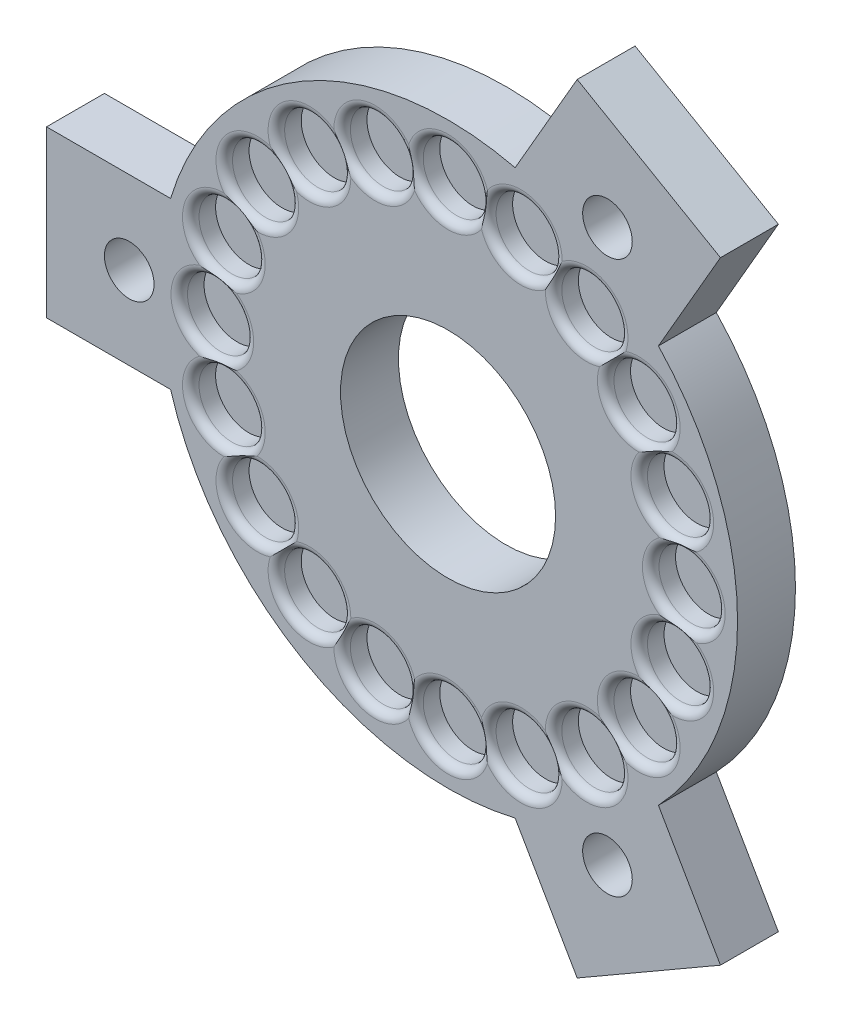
ISO-10303-21;
HEADER;
FILE_DESCRIPTION(('STEP AP214'),'2;1');
FILE_NAME('part.step','',(''),(''),'','','');
FILE_SCHEMA(('AUTOMOTIVE_DESIGN { 1 0 10303 214 1 1 1 1 }'));
ENDSEC;
DATA;
#1=APPLICATION_CONTEXT('core data for automotive mechanical design processes');
#2=APPLICATION_PROTOCOL_DEFINITION('international standard','automotive_design',2000,#1);
#3=PRODUCT_CONTEXT('',#1,'mechanical');
#4=PRODUCT('Part','Part','',(#3));
#5=PRODUCT_RELATED_PRODUCT_CATEGORY('part','',(#4));
#6=PRODUCT_DEFINITION_FORMATION('','',#4);
#7=PRODUCT_DEFINITION_CONTEXT('part definition',#1,'design');
#8=PRODUCT_DEFINITION('design','',#6,#7);
#9=PRODUCT_DEFINITION_SHAPE('','',#8);
#10=(LENGTH_UNIT() NAMED_UNIT(*) SI_UNIT(.MILLI.,.METRE.));
#11=(NAMED_UNIT(*) PLANE_ANGLE_UNIT() SI_UNIT($,.RADIAN.));
#12=(NAMED_UNIT(*) SI_UNIT($,.STERADIAN.) SOLID_ANGLE_UNIT());
#13=UNCERTAINTY_MEASURE_WITH_UNIT(LENGTH_MEASURE(1.E-05),#10,'distance_accuracy_value','');
#14=(GEOMETRIC_REPRESENTATION_CONTEXT(3) GLOBAL_UNCERTAINTY_ASSIGNED_CONTEXT((#13)) GLOBAL_UNIT_ASSIGNED_CONTEXT((#10,
#11,#12)) REPRESENTATION_CONTEXT('',''));
#15=CARTESIAN_POINT('',(0.,0.,0.));
#16=DIRECTION('',(0.,0.,1.));
#17=DIRECTION('',(1.,0.,0.));
#18=AXIS2_PLACEMENT_3D('',#15,#16,#17);
#19=CARTESIAN_POINT('',(0.,0.,7.));
#20=DIRECTION('',(0.,0.,1.));
#21=DIRECTION('',(1.,0.,0.));
#22=AXIS2_PLACEMENT_3D('',#19,#20,#21);
#23=PLANE('',#22);
#24=CARTESIAN_POINT('',(16.7518796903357,23.0569843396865,7.));
#25=DIRECTION('',(0.,0.,1.));
#26=DIRECTION('',(1.,0.,0.));
#27=AXIS2_PLACEMENT_3D('',#24,#25,#26);
#28=CIRCLE('',#27,5.00000000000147);
#29=CARTESIAN_POINT('',(13.8069788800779,27.097721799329,7.));
#30=VERTEX_POINT('',#29);
#31=CARTESIAN_POINT('',(21.5048737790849,21.5048737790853,7.));
#32=VERTEX_POINT('',#31);
#33=EDGE_CURVE('E137',#30,#32,#28,.F.);
#34=ORIENTED_EDGE('',*,*,#33,.T.);
#35=CARTESIAN_POINT('',(23.0569843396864,16.7518796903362,7.));
#36=DIRECTION('',(0.,0.,1.));
#37=DIRECTION('',(1.,0.,0.));
#38=AXIS2_PLACEMENT_3D('',#35,#36,#37);
#39=CIRCLE('',#38,5.00000000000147);
#40=CARTESIAN_POINT('',(27.0977217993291,13.8069788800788,7.));
#41=VERTEX_POINT('',#40);
#42=EDGE_CURVE('E667',#32,#41,#39,.F.);
#43=ORIENTED_EDGE('',*,*,#42,.T.);
#44=CARTESIAN_POINT('',(27.1051107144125,8.80698433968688,7.));
#45=DIRECTION('',(0.,0.,1.));
#46=DIRECTION('',(1.,0.,0.));
#47=AXIS2_PLACEMENT_3D('',#44,#45,#46);
#48=CIRCLE('',#47,5.00000000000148);
#49=CARTESIAN_POINT('',(30.0380560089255,4.75756068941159,7.));
#50=VERTEX_POINT('',#49);
#51=EDGE_CURVE('E615',#41,#50,#48,.F.);
#52=ORIENTED_EDGE('',*,*,#51,.T.);
#53=CARTESIAN_POINT('',(28.5000000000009,9.17490473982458E-13,7.));
#54=DIRECTION('',(0.,0.,1.));
#55=DIRECTION('',(1.,0.,0.));
#56=AXIS2_PLACEMENT_3D('',#53,#54,#55);
#57=CIRCLE('',#56,5.00000000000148);
#58=CARTESIAN_POINT('',(30.0380560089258,-4.75756068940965,7.));
#59=VERTEX_POINT('',#58);
#60=EDGE_CURVE('E612',#50,#59,#57,.F.);
#61=ORIENTED_EDGE('',*,*,#60,.T.);
#62=CARTESIAN_POINT('',(27.1051107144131,-8.80698433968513,7.));
#63=DIRECTION('',(0.,0.,1.));
#64=DIRECTION('',(1.,0.,0.));
#65=AXIS2_PLACEMENT_3D('',#62,#63,#64);
#66=CIRCLE('',#65,5.00000000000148);
#67=CARTESIAN_POINT('',(27.09772179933,-13.806978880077,7.));
#68=VERTEX_POINT('',#67);
#69=EDGE_CURVE('E618',#59,#68,#66,.F.);
#70=ORIENTED_EDGE('',*,*,#69,.T.);
#71=CARTESIAN_POINT('',(23.0569843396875,-16.7518796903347,7.));
#72=DIRECTION('',(0.,0.,1.));
#73=DIRECTION('',(1.,0.,0.));
#74=AXIS2_PLACEMENT_3D('',#71,#72,#73);
#75=CIRCLE('',#74,5.00000000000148);
#76=CARTESIAN_POINT('',(21.5048737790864,-21.504873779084,7.));
#77=VERTEX_POINT('',#76);
#78=EDGE_CURVE('E621',#68,#77,#75,.F.);
#79=ORIENTED_EDGE('',*,*,#78,.T.);
#80=CARTESIAN_POINT('',(16.7518796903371,-23.0569843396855,7.));
#81=DIRECTION('',(0.,0.,1.));
#82=DIRECTION('',(1.,0.,0.));
#83=AXIS2_PLACEMENT_3D('',#80,#81,#82);
#84=CIRCLE('',#83,5.00000000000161);
#85=CARTESIAN_POINT('',(13.8069788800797,-27.0977217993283,7.));
#86=VERTEX_POINT('',#85);
#87=EDGE_CURVE('E624',#77,#86,#84,.F.);
#88=ORIENTED_EDGE('',*,*,#87,.T.);
#89=CARTESIAN_POINT('',(8.80698433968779,-27.1051107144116,7.));
#90=DIRECTION('',(0.,0.,1.));
#91=DIRECTION('',(1.,0.,0.));
#92=AXIS2_PLACEMENT_3D('',#89,#90,#91);
#93=CIRCLE('',#92,5.00000000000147);
#94=CARTESIAN_POINT('',(4.7575606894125,-30.0380560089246,7.));
#95=VERTEX_POINT('',#94);
#96=EDGE_CURVE('E627',#86,#95,#93,.F.);
#97=ORIENTED_EDGE('',*,*,#96,.T.);
#98=CARTESIAN_POINT('',(1.83498094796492E-12,-28.5,7.));
#99=DIRECTION('',(0.,0.,1.));
#100=DIRECTION('',(1.,0.,0.));
#101=AXIS2_PLACEMENT_3D('',#98,#99,#100);
#102=CIRCLE('',#101,5.00000000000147);
#103=CARTESIAN_POINT('',(-4.75756068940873,-30.0380560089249,7.));
#104=VERTEX_POINT('',#103);
#105=EDGE_CURVE('E630',#95,#104,#102,.F.);
#106=ORIENTED_EDGE('',*,*,#105,.T.);
#107=CARTESIAN_POINT('',(-8.80698433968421,-27.1051107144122,7.));
#108=DIRECTION('',(0.,0.,1.));
#109=DIRECTION('',(1.,0.,0.));
#110=AXIS2_PLACEMENT_3D('',#107,#108,#109);
#111=CIRCLE('',#110,5.00000000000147);
#112=CARTESIAN_POINT('',(-13.8069788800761,-27.097721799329,7.));
#113=VERTEX_POINT('',#112);
#114=EDGE_CURVE('E633',#104,#113,#111,.F.);
#115=ORIENTED_EDGE('',*,*,#114,.T.);
#116=CARTESIAN_POINT('',(-16.7518796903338,-23.0569843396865,7.));
#117=DIRECTION('',(0.,0.,1.));
#118=DIRECTION('',(1.,0.,0.));
#119=AXIS2_PLACEMENT_3D('',#116,#117,#118);
#120=CIRCLE('',#119,5.00000000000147);
#121=CARTESIAN_POINT('',(-21.504873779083,-21.5048737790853,7.));
#122=VERTEX_POINT('',#121);
#123=EDGE_CURVE('E636',#113,#122,#120,.F.);
#124=ORIENTED_EDGE('',*,*,#123,.T.);
#125=CARTESIAN_POINT('',(-23.0569843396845,-16.7518796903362,7.));
#126=DIRECTION('',(0.,0.,1.));
#127=DIRECTION('',(1.,0.,0.));
#128=AXIS2_PLACEMENT_3D('',#125,#126,#127);
#129=CIRCLE('',#128,5.00000000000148);
#130=CARTESIAN_POINT('',(-27.0977217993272,-13.8069788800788,7.));
#131=VERTEX_POINT('',#130);
#132=EDGE_CURVE('E639',#122,#131,#129,.F.);
#133=ORIENTED_EDGE('',*,*,#132,.T.);
#134=CARTESIAN_POINT('',(-27.1051107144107,-8.80698433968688,7.));
#135=DIRECTION('',(0.,0.,1.));
#136=DIRECTION('',(1.,0.,0.));
#137=AXIS2_PLACEMENT_3D('',#134,#135,#136);
#138=CIRCLE('',#137,5.00000000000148);
#139=CARTESIAN_POINT('',(-30.0380560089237,-4.75756068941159,7.));
#140=VERTEX_POINT('',#139);
#141=EDGE_CURVE('E642',#131,#140,#138,.F.);
#142=ORIENTED_EDGE('',*,*,#141,.T.);
#143=CARTESIAN_POINT('',(-28.4999999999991,-9.20980717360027E-13,7.));
#144=DIRECTION('',(0.,0.,1.));
#145=DIRECTION('',(1.,0.,0.));
#146=AXIS2_PLACEMENT_3D('',#143,#144,#145);
#147=CIRCLE('',#146,5.00000000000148);
#148=CARTESIAN_POINT('',(-30.038056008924,4.75756068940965,7.));
#149=VERTEX_POINT('',#148);
#150=EDGE_CURVE('E645',#140,#149,#147,.F.);
#151=ORIENTED_EDGE('',*,*,#150,.T.);
#152=CARTESIAN_POINT('',(-27.1051107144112,8.80698433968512,7.));
#153=DIRECTION('',(0.,0.,1.));
#154=DIRECTION('',(1.,0.,0.));
#155=AXIS2_PLACEMENT_3D('',#152,#153,#154);
#156=CIRCLE('',#155,5.00000000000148);
#157=CARTESIAN_POINT('',(-27.0977217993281,13.806978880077,7.));
#158=VERTEX_POINT('',#157);
#159=EDGE_CURVE('E648',#149,#158,#156,.F.);
#160=ORIENTED_EDGE('',*,*,#159,.T.);
#161=CARTESIAN_POINT('',(-23.0569843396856,16.7518796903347,7.));
#162=DIRECTION('',(0.,0.,1.));
#163=DIRECTION('',(1.,0.,0.));
#164=AXIS2_PLACEMENT_3D('',#161,#162,#163);
#165=CIRCLE('',#164,5.00000000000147);
#166=CARTESIAN_POINT('',(-21.5048737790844,21.504873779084,7.));
#167=VERTEX_POINT('',#166);
#168=EDGE_CURVE('E651',#158,#167,#165,.F.);
#169=ORIENTED_EDGE('',*,*,#168,.T.);
#170=CARTESIAN_POINT('',(-16.7518796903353,23.0569843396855,7.));
#171=DIRECTION('',(0.,0.,1.));
#172=DIRECTION('',(1.,0.,0.));
#173=AXIS2_PLACEMENT_3D('',#170,#171,#172);
#174=CIRCLE('',#173,5.00000000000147);
#175=CARTESIAN_POINT('',(-13.8069788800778,27.0977217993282,7.));
#176=VERTEX_POINT('',#175);
#177=EDGE_CURVE('E654',#167,#176,#174,.F.);
#178=ORIENTED_EDGE('',*,*,#177,.T.);
#179=CARTESIAN_POINT('',(-8.80698433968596,27.1051107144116,7.));
#180=DIRECTION('',(0.,0.,1.));
#181=DIRECTION('',(1.,0.,0.));
#182=AXIS2_PLACEMENT_3D('',#179,#180,#181);
#183=CIRCLE('',#182,5.00000000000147);
#184=CARTESIAN_POINT('',(-4.75756068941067,30.0380560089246,7.));
#185=VERTEX_POINT('',#184);
#186=EDGE_CURVE('E657',#176,#185,#183,.F.);
#187=ORIENTED_EDGE('',*,*,#186,.T.);
#188=CARTESIAN_POINT('',(0.,28.5,7.));
#189=DIRECTION('',(0.,0.,1.));
#190=DIRECTION('',(1.,0.,0.));
#191=AXIS2_PLACEMENT_3D('',#188,#189,#190);
#192=CIRCLE('',#191,5.00000000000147);
#193=CARTESIAN_POINT('',(4.75756068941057,30.0380560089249,7.));
#194=VERTEX_POINT('',#193);
#195=EDGE_CURVE('E660',#185,#194,#192,.F.);
#196=ORIENTED_EDGE('',*,*,#195,.T.);
#197=CARTESIAN_POINT('',(8.80698433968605,27.1051107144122,7.));
#198=DIRECTION('',(0.,0.,1.));
#199=DIRECTION('',(1.,0.,0.));
#200=AXIS2_PLACEMENT_3D('',#197,#198,#199);
#201=CIRCLE('',#200,5.00000000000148);
#202=EDGE_CURVE('E142',#194,#30,#201,.F.);
#203=ORIENTED_EDGE('',*,*,#202,.T.);
#204=EDGE_LOOP('',(#34,#43,#52,#61,#70,#79,#88,#97,#106,#115,#124,#133,#142,#151,#160,#169,#178,
#187,#196,#203));
#205=FACE_BOUND('',#204,.T.);
#206=CARTESIAN_POINT('',(0.,0.,7.));
#207=DIRECTION('',(0.,0.,1.));
#208=DIRECTION('',(1.,0.,0.));
#209=AXIS2_PLACEMENT_3D('',#206,#207,#208);
#210=CIRCLE('',#209,35.);
#211=CARTESIAN_POINT('',(25.4307638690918,-24.0473750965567,7.));
#212=VERTEX_POINT('',#211);
#213=CARTESIAN_POINT('',(25.4307638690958,24.0473750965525,7.));
#214=VERTEX_POINT('',#213);
#215=EDGE_CURVE('E537',#212,#214,#210,.T.);
#216=ORIENTED_EDGE('',*,*,#215,.T.);
#217=DIRECTION('',(-0.5,-0.866025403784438,0.));
#218=VECTOR('',#217,1.);
#219=CARTESIAN_POINT('',(32.9307638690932,37.0377561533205,7.));
#220=LINE('',#219,#218);
#221=CARTESIAN_POINT('',(32.9307638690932,37.0377561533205,7.));
#222=VERTEX_POINT('',#221);
#223=EDGE_CURVE('E359',#222,#214,#220,.T.);
#224=ORIENTED_EDGE('',*,*,#223,.F.);
#225=DIRECTION('',(0.866025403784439,-0.5,0.));
#226=VECTOR('',#225,1.);
#227=CARTESIAN_POINT('',(32.9307638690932,37.0377561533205,7.));
#228=LINE('',#227,#226);
#229=CARTESIAN_POINT('',(15.6102557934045,47.0377561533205,7.));
#230=VERTEX_POINT('',#229);
#231=EDGE_CURVE('E337',#230,#222,#228,.T.);
#232=ORIENTED_EDGE('',*,*,#231,.F.);
#233=DIRECTION('',(0.500000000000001,0.866025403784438,0.));
#234=VECTOR('',#233,1.);
#235=CARTESIAN_POINT('',(15.6102557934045,47.0377561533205,7.));
#236=LINE('',#235,#234);
#237=CARTESIAN_POINT('',(8.11025579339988,34.0473750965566,7.));
#238=VERTEX_POINT('',#237);
#239=EDGE_CURVE('E364',#238,#230,#236,.T.);
#240=ORIENTED_EDGE('',*,*,#239,.F.);
#241=CARTESIAN_POINT('',(-33.5410196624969,10.,7.));
#242=VERTEX_POINT('',#241);
#243=EDGE_CURVE('E542',#238,#242,#210,.T.);
#244=ORIENTED_EDGE('',*,*,#243,.T.);
#245=DIRECTION('',(1.,0.,0.));
#246=VECTOR('',#245,1.);
#247=CARTESIAN_POINT('',(-48.5410196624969,10.,7.));
#248=LINE('',#247,#246);
#249=CARTESIAN_POINT('',(-48.5410196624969,10.,7.));
#250=VERTEX_POINT('',#249);
#251=EDGE_CURVE('E404',#250,#242,#248,.T.);
#252=ORIENTED_EDGE('',*,*,#251,.F.);
#253=DIRECTION('',(0.,1.,0.));
#254=VECTOR('',#253,1.);
#255=CARTESIAN_POINT('',(-48.5410196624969,10.,7.));
#256=LINE('',#255,#254);
#257=CARTESIAN_POINT('',(-48.5410196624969,-9.99999999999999,7.));
#258=VERTEX_POINT('',#257);
#259=EDGE_CURVE('E392',#258,#250,#256,.T.);
#260=ORIENTED_EDGE('',*,*,#259,.F.);
#261=DIRECTION('',(-1.,0.,0.));
#262=VECTOR('',#261,1.);
#263=CARTESIAN_POINT('',(-48.5410196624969,-9.99999999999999,7.));
#264=LINE('',#263,#262);
#265=CARTESIAN_POINT('',(-33.5410196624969,-10.,7.));
#266=VERTEX_POINT('',#265);
#267=EDGE_CURVE('E376',#266,#258,#264,.T.);
#268=ORIENTED_EDGE('',*,*,#267,.F.);
#269=CARTESIAN_POINT('',(8.11025579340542,-34.0473750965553,7.));
#270=VERTEX_POINT('',#269);
#271=EDGE_CURVE('E543',#266,#270,#210,.T.);
#272=ORIENTED_EDGE('',*,*,#271,.T.);
#273=DIRECTION('',(-0.5,0.866025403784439,0.));
#274=VECTOR('',#273,1.);
#275=CARTESIAN_POINT('',(15.6102557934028,-47.0377561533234,7.));
#276=LINE('',#275,#274);
#277=CARTESIAN_POINT('',(15.6102557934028,-47.0377561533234,7.));
#278=VERTEX_POINT('',#277);
#279=EDGE_CURVE('E411',#278,#270,#276,.T.);
#280=ORIENTED_EDGE('',*,*,#279,.F.);
#281=DIRECTION('',(-0.866025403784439,-0.5,0.));
#282=VECTOR('',#281,1.);
#283=CARTESIAN_POINT('',(15.6102557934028,-47.0377561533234,7.));
#284=LINE('',#283,#282);
#285=CARTESIAN_POINT('',(32.9307638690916,-37.0377561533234,7.));
#286=VERTEX_POINT('',#285);
#287=EDGE_CURVE('E420',#286,#278,#284,.T.);
#288=ORIENTED_EDGE('',*,*,#287,.F.);
#289=DIRECTION('',(0.5,-0.866025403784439,0.));
#290=VECTOR('',#289,1.);
#291=CARTESIAN_POINT('',(32.9307638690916,-37.0377561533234,7.));
#292=LINE('',#291,#290);
#293=EDGE_CURVE('E415',#212,#286,#292,.T.);
#294=ORIENTED_EDGE('',*,*,#293,.F.);
#295=EDGE_LOOP('',(#216,#224,#232,#240,#244,#252,#260,#268,#272,#280,#288,#294));
#296=FACE_BOUND('',#295,.T.);
#297=CARTESIAN_POINT('',(19.2705098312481,33.377502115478,7.));
#298=DIRECTION('',(0.,0.,1.));
#299=DIRECTION('',(1.,0.,0.));
#300=AXIS2_PLACEMENT_3D('',#297,#298,#299);
#301=CIRCLE('',#300,3.);
#302=CARTESIAN_POINT('',(22.2705098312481,33.377502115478,7.));
#303=VERTEX_POINT('',#302);
#304=EDGE_CURVE('E1273',#303,#303,#301,.F.);
#305=ORIENTED_EDGE('',*,*,#304,.T.);
#306=EDGE_LOOP('',(#305));
#307=FACE_BOUND('',#306,.T.);
#308=CARTESIAN_POINT('',(19.2705098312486,-33.3775021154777,7.));
#309=DIRECTION('',(0.,0.,1.));
#310=DIRECTION('',(1.,0.,0.));
#311=AXIS2_PLACEMENT_3D('',#308,#309,#310);
#312=CIRCLE('',#311,3.);
#313=CARTESIAN_POINT('',(22.2705098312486,-33.3775021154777,7.));
#314=VERTEX_POINT('',#313);
#315=EDGE_CURVE('E2065',#314,#314,#312,.F.);
#316=ORIENTED_EDGE('',*,*,#315,.T.);
#317=EDGE_LOOP('',(#316));
#318=FACE_BOUND('',#317,.T.);
#319=CARTESIAN_POINT('',(-38.5410196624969,0.,7.));
#320=DIRECTION('',(0.,0.,1.));
#321=DIRECTION('',(1.,0.,0.));
#322=AXIS2_PLACEMENT_3D('',#319,#320,#321);
#323=CIRCLE('',#322,3.);
#324=CARTESIAN_POINT('',(-35.5410196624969,0.,7.));
#325=VERTEX_POINT('',#324);
#326=EDGE_CURVE('E2071',#325,#325,#323,.F.);
#327=ORIENTED_EDGE('',*,*,#326,.T.);
#328=EDGE_LOOP('',(#327));
#329=FACE_BOUND('',#328,.T.);
#330=ADVANCED_FACE('F115',(#205,#296,#307,#318,#329),#23,.T.);
#331=CARTESIAN_POINT('',(0.,0.,7.));
#332=DIRECTION('',(0.,0.,-1.));
#333=DIRECTION('',(-1.,0.,0.));
#334=AXIS2_PLACEMENT_3D('',#331,#332,#333);
#335=CYLINDRICAL_SURFACE('',#334,35.);
#336=ORIENTED_EDGE('',*,*,#243,.F.);
#337=DIRECTION('',(0.,0.,-1.));
#338=VECTOR('',#337,1.);
#339=CARTESIAN_POINT('',(8.11025579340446,34.047375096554,7.));
#340=LINE('',#339,#338);
#341=CARTESIAN_POINT('',(8.11025579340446,34.047375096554,0.));
#342=VERTEX_POINT('',#341);
#343=EDGE_CURVE('E1285',#238,#342,#340,.T.);
#344=ORIENTED_EDGE('',*,*,#343,.T.);
#345=CARTESIAN_POINT('',(0.,0.,0.));
#346=DIRECTION('',(0.,0.,1.));
#347=DIRECTION('',(1.,0.,0.));
#348=AXIS2_PLACEMENT_3D('',#345,#346,#347);
#349=CIRCLE('',#348,35.);
#350=CARTESIAN_POINT('',(-33.5410196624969,10.,0.));
#351=VERTEX_POINT('',#350);
#352=EDGE_CURVE('E547',#342,#351,#349,.T.);
#353=ORIENTED_EDGE('',*,*,#352,.T.);
#354=DIRECTION('',(0.,0.,-1.));
#355=VECTOR('',#354,1.);
#356=CARTESIAN_POINT('',(-33.5410196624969,10.,7.));
#357=LINE('',#356,#355);
#358=EDGE_CURVE('E377',#242,#351,#357,.T.);
#359=ORIENTED_EDGE('',*,*,#358,.F.);
#360=EDGE_LOOP('',(#336,#344,#353,#359));
#361=FACE_BOUND('',#360,.T.);
#362=ADVANCED_FACE('F1016',(#361),#335,.T.);
#363=ORIENTED_EDGE('',*,*,#271,.F.);
#364=DIRECTION('',(0.,0.,-1.));
#365=VECTOR('',#364,1.);
#366=CARTESIAN_POINT('',(-33.5410196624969,-9.99999999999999,7.));
#367=LINE('',#366,#365);
#368=CARTESIAN_POINT('',(-33.5410196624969,-9.99999999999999,0.));
#369=VERTEX_POINT('',#368);
#370=EDGE_CURVE('E381',#266,#369,#367,.T.);
#371=ORIENTED_EDGE('',*,*,#370,.T.);
#372=CARTESIAN_POINT('',(8.11025579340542,-34.0473750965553,0.));
#373=VERTEX_POINT('',#372);
#374=EDGE_CURVE('E536',#369,#373,#349,.T.);
#375=ORIENTED_EDGE('',*,*,#374,.T.);
#376=DIRECTION('',(0.,0.,-1.));
#377=VECTOR('',#376,1.);
#378=CARTESIAN_POINT('',(8.11025579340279,-34.0473750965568,7.));
#379=LINE('',#378,#377);
#380=EDGE_CURVE('E424',#270,#373,#379,.T.);
#381=ORIENTED_EDGE('',*,*,#380,.F.);
#382=EDGE_LOOP('',(#363,#371,#375,#381));
#383=FACE_BOUND('',#382,.T.);
#384=ADVANCED_FACE('F1022',(#383),#335,.T.);
#385=CARTESIAN_POINT('',(25.4307638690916,-24.0473750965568,0.));
#386=VERTEX_POINT('',#385);
#387=CARTESIAN_POINT('',(25.4307638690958,24.0473750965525,0.));
#388=VERTEX_POINT('',#387);
#389=EDGE_CURVE('E544',#386,#388,#349,.T.);
#390=ORIENTED_EDGE('',*,*,#389,.T.);
#391=DIRECTION('',(0.,0.,-1.));
#392=VECTOR('',#391,1.);
#393=CARTESIAN_POINT('',(25.4307638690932,24.047375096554,7.));
#394=LINE('',#393,#392);
#395=EDGE_CURVE('E349',#214,#388,#394,.T.);
#396=ORIENTED_EDGE('',*,*,#395,.F.);
#397=ORIENTED_EDGE('',*,*,#215,.F.);
#398=DIRECTION('',(0.,0.,-1.));
#399=VECTOR('',#398,1.);
#400=CARTESIAN_POINT('',(25.4307638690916,-24.0473750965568,7.));
#401=LINE('',#400,#399);
#402=EDGE_CURVE('E442',#212,#386,#401,.T.);
#403=ORIENTED_EDGE('',*,*,#402,.T.);
#404=EDGE_LOOP('',(#390,#396,#397,#403));
#405=FACE_BOUND('',#404,.T.);
#406=ADVANCED_FACE('F1024',(#405),#335,.T.);
#407=CARTESIAN_POINT('',(27.1051107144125,8.80698433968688,7.));
#408=DIRECTION('',(0.,0.,1.));
#409=DIRECTION('',(1.,0.,0.));
#410=AXIS2_PLACEMENT_3D('',#407,#408,#409);
#411=CIRCLE('',#410,5.00000000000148);
#412=CARTESIAN_POINT('',(25.5670547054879,4.04942365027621,7.));
#413=VERTEX_POINT('',#412);
#414=CARTESIAN_POINT('',(23.0643732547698,11.7518851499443,7.));
#415=VERTEX_POINT('',#414);
#416=EDGE_CURVE('E554',#413,#415,#411,.F.);
#417=ORIENTED_EDGE('',*,*,#416,.T.);
#418=CARTESIAN_POINT('',(23.0569843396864,16.7518796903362,7.));
#419=DIRECTION('',(0.,0.,1.));
#420=DIRECTION('',(1.,0.,0.));
#421=AXIS2_PLACEMENT_3D('',#418,#419,#420);
#422=CIRCLE('',#421,5.00000000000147);
#423=CARTESIAN_POINT('',(18.3039902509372,18.3039902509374,7.));
#424=VERTEX_POINT('',#423);
#425=EDGE_CURVE('E608',#415,#424,#422,.F.);
#426=ORIENTED_EDGE('',*,*,#425,.T.);
#427=CARTESIAN_POINT('',(16.7518796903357,23.0569843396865,7.));
#428=DIRECTION('',(0.,0.,1.));
#429=DIRECTION('',(1.,0.,0.));
#430=AXIS2_PLACEMENT_3D('',#427,#428,#429);
#431=CIRCLE('',#430,5.00000000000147);
#432=CARTESIAN_POINT('',(11.7518851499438,23.0643732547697,7.));
#433=VERTEX_POINT('',#432);
#434=EDGE_CURVE('E605',#424,#433,#431,.F.);
#435=ORIENTED_EDGE('',*,*,#434,.T.);
#436=CARTESIAN_POINT('',(8.80698433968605,27.1051107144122,7.));
#437=DIRECTION('',(0.,0.,1.));
#438=DIRECTION('',(1.,0.,0.));
#439=AXIS2_PLACEMENT_3D('',#436,#437,#438);
#440=CIRCLE('',#439,5.00000000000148);
#441=CARTESIAN_POINT('',(4.04942365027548,25.5670547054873,7.));
#442=VERTEX_POINT('',#441);
#443=EDGE_CURVE('E602',#433,#442,#440,.F.);
#444=ORIENTED_EDGE('',*,*,#443,.T.);
#445=CARTESIAN_POINT('',(0.,28.5,7.));
#446=DIRECTION('',(0.,0.,1.));
#447=DIRECTION('',(1.,0.,0.));
#448=AXIS2_PLACEMENT_3D('',#445,#446,#447);
#449=CIRCLE('',#448,5.00000000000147);
#450=CARTESIAN_POINT('',(-4.04942365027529,25.567054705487,7.));
#451=VERTEX_POINT('',#450);
#452=EDGE_CURVE('E599',#442,#451,#449,.F.);
#453=ORIENTED_EDGE('',*,*,#452,.T.);
#454=CARTESIAN_POINT('',(-8.80698433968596,27.1051107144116,7.));
#455=DIRECTION('',(0.,0.,1.));
#456=DIRECTION('',(1.,0.,0.));
#457=AXIS2_PLACEMENT_3D('',#454,#455,#456);
#458=CIRCLE('',#457,5.00000000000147);
#459=CARTESIAN_POINT('',(-11.7518851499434,23.0643732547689,7.));
#460=VERTEX_POINT('',#459);
#461=EDGE_CURVE('E596',#451,#460,#458,.F.);
#462=ORIENTED_EDGE('',*,*,#461,.T.);
#463=CARTESIAN_POINT('',(-16.7518796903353,23.0569843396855,7.));
#464=DIRECTION('',(0.,0.,1.));
#465=DIRECTION('',(1.,0.,0.));
#466=AXIS2_PLACEMENT_3D('',#463,#464,#465);
#467=CIRCLE('',#466,5.00000000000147);
#468=CARTESIAN_POINT('',(-18.3039902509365,18.3039902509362,7.));
#469=VERTEX_POINT('',#468);
#470=EDGE_CURVE('E593',#460,#469,#467,.F.);
#471=ORIENTED_EDGE('',*,*,#470,.T.);
#472=CARTESIAN_POINT('',(-23.0569843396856,16.7518796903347,7.));
#473=DIRECTION('',(0.,0.,1.));
#474=DIRECTION('',(1.,0.,0.));
#475=AXIS2_PLACEMENT_3D('',#472,#473,#474);
#476=CIRCLE('',#475,5.00000000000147);
#477=CARTESIAN_POINT('',(-23.0643732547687,11.7518851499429,7.));
#478=VERTEX_POINT('',#477);
#479=EDGE_CURVE('E590',#469,#478,#476,.F.);
#480=ORIENTED_EDGE('',*,*,#479,.T.);
#481=CARTESIAN_POINT('',(-27.1051107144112,8.80698433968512,7.));
#482=DIRECTION('',(0.,0.,1.));
#483=DIRECTION('',(1.,0.,0.));
#484=AXIS2_PLACEMENT_3D('',#481,#482,#483);
#485=CIRCLE('',#484,5.00000000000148);
#486=CARTESIAN_POINT('',(-25.5670547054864,4.04942365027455,7.));
#487=VERTEX_POINT('',#486);
#488=EDGE_CURVE('E587',#478,#487,#485,.F.);
#489=ORIENTED_EDGE('',*,*,#488,.T.);
#490=CARTESIAN_POINT('',(-28.4999999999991,-9.20980717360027E-13,7.));
#491=DIRECTION('',(0.,0.,1.));
#492=DIRECTION('',(1.,0.,0.));
#493=AXIS2_PLACEMENT_3D('',#490,#491,#492);
#494=CIRCLE('',#493,5.00000000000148);
#495=CARTESIAN_POINT('',(-25.5670547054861,-4.04942365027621,7.));
#496=VERTEX_POINT('',#495);
#497=EDGE_CURVE('E584',#487,#496,#494,.F.);
#498=ORIENTED_EDGE('',*,*,#497,.T.);
#499=CARTESIAN_POINT('',(-27.1051107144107,-8.80698433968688,7.));
#500=DIRECTION('',(0.,0.,1.));
#501=DIRECTION('',(1.,0.,0.));
#502=AXIS2_PLACEMENT_3D('',#499,#500,#501);
#503=CIRCLE('',#502,5.00000000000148);
#504=CARTESIAN_POINT('',(-23.064373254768,-11.7518851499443,7.));
#505=VERTEX_POINT('',#504);
#506=EDGE_CURVE('E581',#496,#505,#503,.F.);
#507=ORIENTED_EDGE('',*,*,#506,.T.);
#508=CARTESIAN_POINT('',(-23.0569843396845,-16.7518796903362,7.));
#509=DIRECTION('',(0.,0.,1.));
#510=DIRECTION('',(1.,0.,0.));
#511=AXIS2_PLACEMENT_3D('',#508,#509,#510);
#512=CIRCLE('',#511,5.00000000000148);
#513=CARTESIAN_POINT('',(-18.3039902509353,-18.3039902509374,7.));
#514=VERTEX_POINT('',#513);
#515=EDGE_CURVE('E578',#505,#514,#512,.F.);
#516=ORIENTED_EDGE('',*,*,#515,.T.);
#517=CARTESIAN_POINT('',(-16.7518796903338,-23.0569843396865,7.));
#518=DIRECTION('',(0.,0.,1.));
#519=DIRECTION('',(1.,0.,0.));
#520=AXIS2_PLACEMENT_3D('',#517,#518,#519);
#521=CIRCLE('',#520,5.00000000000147);
#522=CARTESIAN_POINT('',(-11.7518851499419,-23.0643732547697,7.));
#523=VERTEX_POINT('',#522);
#524=EDGE_CURVE('E575',#514,#523,#521,.F.);
#525=ORIENTED_EDGE('',*,*,#524,.T.);
#526=CARTESIAN_POINT('',(-8.80698433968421,-27.1051107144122,7.));
#527=DIRECTION('',(0.,0.,1.));
#528=DIRECTION('',(1.,0.,0.));
#529=AXIS2_PLACEMENT_3D('',#526,#527,#528);
#530=CIRCLE('',#529,5.00000000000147);
#531=CARTESIAN_POINT('',(-4.04942365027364,-25.5670547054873,7.));
#532=VERTEX_POINT('',#531);
#533=EDGE_CURVE('E572',#523,#532,#530,.F.);
#534=ORIENTED_EDGE('',*,*,#533,.T.);
#535=CARTESIAN_POINT('',(1.83498094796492E-12,-28.5,7.));
#536=DIRECTION('',(0.,0.,1.));
#537=DIRECTION('',(1.,0.,0.));
#538=AXIS2_PLACEMENT_3D('',#535,#536,#537);
#539=CIRCLE('',#538,5.00000000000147);
#540=CARTESIAN_POINT('',(4.04942365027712,-25.567054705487,7.));
#541=VERTEX_POINT('',#540);
#542=EDGE_CURVE('E569',#532,#541,#539,.F.);
#543=ORIENTED_EDGE('',*,*,#542,.T.);
#544=CARTESIAN_POINT('',(8.80698433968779,-27.1051107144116,7.));
#545=DIRECTION('',(0.,0.,1.));
#546=DIRECTION('',(1.,0.,0.));
#547=AXIS2_PLACEMENT_3D('',#544,#545,#546);
#548=CIRCLE('',#547,5.00000000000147);
#549=CARTESIAN_POINT('',(11.7518851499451,-23.0643732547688,7.));
#550=VERTEX_POINT('',#549);
#551=EDGE_CURVE('E566',#541,#550,#548,.F.);
#552=ORIENTED_EDGE('',*,*,#551,.T.);
#553=CARTESIAN_POINT('',(16.7518796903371,-23.0569843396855,7.));
#554=DIRECTION('',(0.,0.,1.));
#555=DIRECTION('',(1.,0.,0.));
#556=AXIS2_PLACEMENT_3D('',#553,#554,#555);
#557=CIRCLE('',#556,5.00000000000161);
#558=CARTESIAN_POINT('',(18.3039902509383,-18.3039902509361,7.));
#559=VERTEX_POINT('',#558);
#560=EDGE_CURVE('E563',#550,#559,#557,.F.);
#561=ORIENTED_EDGE('',*,*,#560,.T.);
#562=CARTESIAN_POINT('',(23.0569843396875,-16.7518796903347,7.));
#563=DIRECTION('',(0.,0.,1.));
#564=DIRECTION('',(1.,0.,0.));
#565=AXIS2_PLACEMENT_3D('',#562,#563,#564);
#566=CIRCLE('',#565,5.00000000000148);
#567=CARTESIAN_POINT('',(23.0643732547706,-11.7518851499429,7.));
#568=VERTEX_POINT('',#567);
#569=EDGE_CURVE('E560',#559,#568,#566,.F.);
#570=ORIENTED_EDGE('',*,*,#569,.T.);
#571=CARTESIAN_POINT('',(27.1051107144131,-8.80698433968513,7.));
#572=DIRECTION('',(0.,0.,1.));
#573=DIRECTION('',(1.,0.,0.));
#574=AXIS2_PLACEMENT_3D('',#571,#572,#573);
#575=CIRCLE('',#574,5.00000000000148);
#576=CARTESIAN_POINT('',(25.5670547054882,-4.04942365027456,7.));
#577=VERTEX_POINT('',#576);
#578=EDGE_CURVE('E557',#568,#577,#575,.F.);
#579=ORIENTED_EDGE('',*,*,#578,.T.);
#580=CARTESIAN_POINT('',(28.5000000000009,9.17490473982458E-13,7.));
#581=DIRECTION('',(0.,0.,1.));
#582=DIRECTION('',(1.,0.,0.));
#583=AXIS2_PLACEMENT_3D('',#580,#581,#582);
#584=CIRCLE('',#583,5.00000000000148);
#585=EDGE_CURVE('E551',#577,#413,#584,.F.);
#586=ORIENTED_EDGE('',*,*,#585,.T.);
#587=EDGE_LOOP('',(#417,#426,#435,#444,#453,#462,#471,#480,#489,#498,#507,#516,#525,#534,#543,
#552,#561,#570,#579,#586));
#588=FACE_BOUND('',#587,.T.);
#589=CARTESIAN_POINT('',(0.,0.,7.));
#590=DIRECTION('',(0.,0.,1.));
#591=DIRECTION('',(1.,0.,0.));
#592=AXIS2_PLACEMENT_3D('',#589,#590,#591);
#593=CIRCLE('',#592,13.);
#594=CARTESIAN_POINT('',(13.,0.,7.));
#595=VERTEX_POINT('',#594);
#596=EDGE_CURVE('E438',#595,#595,#593,.T.);
#597=ORIENTED_EDGE('',*,*,#596,.F.);
#598=EDGE_LOOP('',(#597));
#599=FACE_BOUND('',#598,.T.);
#600=ADVANCED_FACE('F1018',(#588,#599),#23,.T.);
#601=CARTESIAN_POINT('',(0.,0.,0.));
#602=DIRECTION('',(0.,0.,1.));
#603=DIRECTION('',(1.,0.,0.));
#604=AXIS2_PLACEMENT_3D('',#601,#602,#603);
#605=PLANE('',#604);
#606=CARTESIAN_POINT('',(-38.5410196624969,0.,0.));
#607=DIRECTION('',(0.,0.,-1.));
#608=DIRECTION('',(-1.,0.,0.));
#609=AXIS2_PLACEMENT_3D('',#606,#607,#608);
#610=CIRCLE('',#609,3.);
#611=CARTESIAN_POINT('',(-41.5410196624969,0.,0.));
#612=VERTEX_POINT('',#611);
#613=EDGE_CURVE('E343',#612,#612,#610,.T.);
#614=ORIENTED_EDGE('',*,*,#613,.F.);
#615=EDGE_LOOP('',(#614));
#616=FACE_BOUND('',#615,.T.);
#617=CARTESIAN_POINT('',(19.2705098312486,-33.3775021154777,0.));
#618=DIRECTION('',(0.,0.,-1.));
#619=DIRECTION('',(-1.,0.,0.));
#620=AXIS2_PLACEMENT_3D('',#617,#618,#619);
#621=CIRCLE('',#620,3.);
#622=CARTESIAN_POINT('',(16.2705098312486,-33.3775021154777,0.));
#623=VERTEX_POINT('',#622);
#624=EDGE_CURVE('E1279',#623,#623,#621,.T.);
#625=ORIENTED_EDGE('',*,*,#624,.F.);
#626=EDGE_LOOP('',(#625));
#627=FACE_BOUND('',#626,.T.);
#628=CARTESIAN_POINT('',(19.2705098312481,33.377502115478,0.));
#629=DIRECTION('',(0.,0.,-1.));
#630=DIRECTION('',(-1.,0.,0.));
#631=AXIS2_PLACEMENT_3D('',#628,#629,#630);
#632=CIRCLE('',#631,3.);
#633=CARTESIAN_POINT('',(16.2705098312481,33.377502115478,0.));
#634=VERTEX_POINT('',#633);
#635=EDGE_CURVE('E1270',#634,#634,#632,.T.);
#636=ORIENTED_EDGE('',*,*,#635,.F.);
#637=EDGE_LOOP('',(#636));
#638=FACE_BOUND('',#637,.T.);
#639=CARTESIAN_POINT('',(0.,0.,0.));
#640=DIRECTION('',(0.,0.,1.));
#641=DIRECTION('',(1.,0.,0.));
#642=AXIS2_PLACEMENT_3D('',#639,#640,#641);
#643=CIRCLE('',#642,13.);
#644=CARTESIAN_POINT('',(13.,0.,0.));
#645=VERTEX_POINT('',#644);
#646=EDGE_CURVE('E452',#645,#645,#643,.F.);
#647=ORIENTED_EDGE('',*,*,#646,.F.);
#648=EDGE_LOOP('',(#647));
#649=FACE_BOUND('',#648,.T.);
#650=ORIENTED_EDGE('',*,*,#352,.F.);
#651=DIRECTION('',(0.500000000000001,0.866025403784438,0.));
#652=VECTOR('',#651,1.);
#653=CARTESIAN_POINT('',(15.6102557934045,47.0377561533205,0.));
#654=LINE('',#653,#652);
#655=CARTESIAN_POINT('',(15.6102557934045,47.0377561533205,0.));
#656=VERTEX_POINT('',#655);
#657=EDGE_CURVE('E353',#342,#656,#654,.T.);
#658=ORIENTED_EDGE('',*,*,#657,.T.);
#659=DIRECTION('',(0.866025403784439,-0.5,0.));
#660=VECTOR('',#659,1.);
#661=CARTESIAN_POINT('',(32.9307638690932,37.0377561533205,0.));
#662=LINE('',#661,#660);
#663=CARTESIAN_POINT('',(32.9307638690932,37.0377561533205,0.));
#664=VERTEX_POINT('',#663);
#665=EDGE_CURVE('E335',#656,#664,#662,.T.);
#666=ORIENTED_EDGE('',*,*,#665,.T.);
#667=DIRECTION('',(-0.5,-0.866025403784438,0.));
#668=VECTOR('',#667,1.);
#669=CARTESIAN_POINT('',(32.9307638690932,37.0377561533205,0.));
#670=LINE('',#669,#668);
#671=EDGE_CURVE('E347',#664,#388,#670,.T.);
#672=ORIENTED_EDGE('',*,*,#671,.T.);
#673=ORIENTED_EDGE('',*,*,#389,.F.);
#674=DIRECTION('',(0.5,-0.866025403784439,0.));
#675=VECTOR('',#674,1.);
#676=CARTESIAN_POINT('',(32.9307638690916,-37.0377561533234,0.));
#677=LINE('',#676,#675);
#678=CARTESIAN_POINT('',(32.9307638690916,-37.0377561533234,0.));
#679=VERTEX_POINT('',#678);
#680=EDGE_CURVE('E428',#386,#679,#677,.T.);
#681=ORIENTED_EDGE('',*,*,#680,.T.);
#682=DIRECTION('',(-0.866025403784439,-0.5,0.));
#683=VECTOR('',#682,1.);
#684=CARTESIAN_POINT('',(15.6102557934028,-47.0377561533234,0.));
#685=LINE('',#684,#683);
#686=CARTESIAN_POINT('',(15.6102557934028,-47.0377561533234,0.));
#687=VERTEX_POINT('',#686);
#688=EDGE_CURVE('E416',#679,#687,#685,.T.);
#689=ORIENTED_EDGE('',*,*,#688,.T.);
#690=DIRECTION('',(-0.5,0.866025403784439,0.));
#691=VECTOR('',#690,1.);
#692=CARTESIAN_POINT('',(15.6102557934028,-47.0377561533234,0.));
#693=LINE('',#692,#691);
#694=EDGE_CURVE('E400',#687,#373,#693,.T.);
#695=ORIENTED_EDGE('',*,*,#694,.T.);
#696=ORIENTED_EDGE('',*,*,#374,.F.);
#697=DIRECTION('',(-1.,0.,0.));
#698=VECTOR('',#697,1.);
#699=CARTESIAN_POINT('',(-48.5410196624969,-9.99999999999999,0.));
#700=LINE('',#699,#698);
#701=CARTESIAN_POINT('',(-48.5410196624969,-9.99999999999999,0.));
#702=VERTEX_POINT('',#701);
#703=EDGE_CURVE('E387',#369,#702,#700,.T.);
#704=ORIENTED_EDGE('',*,*,#703,.T.);
#705=DIRECTION('',(0.,1.,0.));
#706=VECTOR('',#705,1.);
#707=CARTESIAN_POINT('',(-48.5410196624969,10.,0.));
#708=LINE('',#707,#706);
#709=CARTESIAN_POINT('',(-48.5410196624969,10.,0.));
#710=VERTEX_POINT('',#709);
#711=EDGE_CURVE('E396',#702,#710,#708,.T.);
#712=ORIENTED_EDGE('',*,*,#711,.T.);
#713=DIRECTION('',(1.,0.,0.));
#714=VECTOR('',#713,1.);
#715=CARTESIAN_POINT('',(-48.5410196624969,10.,0.));
#716=LINE('',#715,#714);
#717=EDGE_CURVE('E391',#710,#351,#716,.T.);
#718=ORIENTED_EDGE('',*,*,#717,.T.);
#719=EDGE_LOOP('',(#650,#658,#666,#672,#673,#681,#689,#695,#696,#704,#712,#718));
#720=FACE_BOUND('',#719,.T.);
#721=ADVANCED_FACE('F356',(#616,#627,#638,#649,#720),#605,.F.);
#722=CARTESIAN_POINT('',(23.0569843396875,-16.7518796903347,4.));
#723=DIRECTION('',(0.,0.,1.));
#724=DIRECTION('',(1.,0.,0.));
#725=AXIS2_PLACEMENT_3D('',#722,#723,#724);
#726=CYLINDRICAL_SURFACE('',#725,4.00000000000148);
#727=CARTESIAN_POINT('',(23.0569843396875,-16.7518796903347,6.));
#728=DIRECTION('',(0.,0.,1.));
#729=DIRECTION('',(1.,0.,0.));
#730=AXIS2_PLACEMENT_3D('',#727,#728,#729);
#731=CIRCLE('',#730,4.00000000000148);
#732=CARTESIAN_POINT('',(27.0569843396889,-16.7518796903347,6.));
#733=VERTEX_POINT('',#732);
#734=EDGE_CURVE('E730',#733,#733,#731,.T.);
#735=ORIENTED_EDGE('',*,*,#734,.T.);
#736=EDGE_LOOP('',(#735));
#737=FACE_BOUND('',#736,.T.);
#738=CARTESIAN_POINT('',(23.0569843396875,-16.7518796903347,4.));
#739=DIRECTION('',(0.,0.,1.));
#740=DIRECTION('',(1.,0.,0.));
#741=AXIS2_PLACEMENT_3D('',#738,#739,#740);
#742=CIRCLE('',#741,4.00000000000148);
#743=CARTESIAN_POINT('',(27.0569843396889,-16.7518796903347,4.));
#744=VERTEX_POINT('',#743);
#745=EDGE_CURVE('E499',#744,#744,#742,.T.);
#746=ORIENTED_EDGE('',*,*,#745,.F.);
#747=EDGE_LOOP('',(#746));
#748=FACE_BOUND('',#747,.T.);
#749=ADVANCED_FACE('F1034',(#737,#748),#726,.F.);
#750=CARTESIAN_POINT('',(0.,0.,4.));
#751=DIRECTION('',(0.,0.,1.));
#752=DIRECTION('',(1.,0.,0.));
#753=AXIS2_PLACEMENT_3D('',#750,#751,#752);
#754=PLANE('',#753);
#755=ORIENTED_EDGE('',*,*,#745,.T.);
#756=EDGE_LOOP('',(#755));
#757=FACE_BOUND('',#756,.T.);
#758=ADVANCED_FACE('F1083',(#757),#754,.T.);
#759=CARTESIAN_POINT('',(1.83498094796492E-12,-28.5,4.));
#760=DIRECTION('',(0.,0.,1.));
#761=DIRECTION('',(1.,0.,0.));
#762=AXIS2_PLACEMENT_3D('',#759,#760,#761);
#763=CYLINDRICAL_SURFACE('',#762,4.00000000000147);
#764=CARTESIAN_POINT('',(1.83498094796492E-12,-28.5,6.));
#765=DIRECTION('',(0.,0.,1.));
#766=DIRECTION('',(1.,0.,0.));
#767=AXIS2_PLACEMENT_3D('',#764,#765,#766);
#768=CIRCLE('',#767,4.00000000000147);
#769=CARTESIAN_POINT('',(4.00000000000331,-28.5,6.));
#770=VERTEX_POINT('',#769);
#771=EDGE_CURVE('E718',#770,#770,#768,.T.);
#772=ORIENTED_EDGE('',*,*,#771,.T.);
#773=EDGE_LOOP('',(#772));
#774=FACE_BOUND('',#773,.T.);
#775=CARTESIAN_POINT('',(1.83498094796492E-12,-28.5,4.));
#776=DIRECTION('',(0.,0.,1.));
#777=DIRECTION('',(1.,0.,0.));
#778=AXIS2_PLACEMENT_3D('',#775,#776,#777);
#779=CIRCLE('',#778,4.00000000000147);
#780=CARTESIAN_POINT('',(4.00000000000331,-28.5,4.));
#781=VERTEX_POINT('',#780);
#782=EDGE_CURVE('E456',#781,#781,#779,.T.);
#783=ORIENTED_EDGE('',*,*,#782,.F.);
#784=EDGE_LOOP('',(#783));
#785=FACE_BOUND('',#784,.T.);
#786=ADVANCED_FACE('F1080',(#774,#785),#763,.F.);
#787=CARTESIAN_POINT('',(1.83498094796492E-12,-28.5,4.));
#788=DIRECTION('',(0.,0.,1.));
#789=DIRECTION('',(1.,0.,0.));
#790=AXIS2_PLACEMENT_3D('',#787,#788,#789);
#791=PLANE('',#790);
#792=ORIENTED_EDGE('',*,*,#782,.T.);
#793=EDGE_LOOP('',(#792));
#794=FACE_BOUND('',#793,.T.);
#795=ADVANCED_FACE('F1075',(#794),#791,.T.);
#796=CARTESIAN_POINT('',(-16.7518796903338,-23.0569843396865,4.));
#797=DIRECTION('',(0.,0.,1.));
#798=DIRECTION('',(1.,0.,0.));
#799=AXIS2_PLACEMENT_3D('',#796,#797,#798);
#800=CYLINDRICAL_SURFACE('',#799,4.00000000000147);
#801=CARTESIAN_POINT('',(-16.7518796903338,-23.0569843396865,6.));
#802=DIRECTION('',(0.,0.,1.));
#803=DIRECTION('',(1.,0.,0.));
#804=AXIS2_PLACEMENT_3D('',#801,#802,#803);
#805=CIRCLE('',#804,4.00000000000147);
#806=CARTESIAN_POINT('',(-12.7518796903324,-23.0569843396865,6.));
#807=VERTEX_POINT('',#806);
#808=EDGE_CURVE('E710',#807,#807,#805,.T.);
#809=ORIENTED_EDGE('',*,*,#808,.T.);
#810=EDGE_LOOP('',(#809));
#811=FACE_BOUND('',#810,.T.);
#812=CARTESIAN_POINT('',(-16.7518796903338,-23.0569843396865,4.));
#813=DIRECTION('',(0.,0.,1.));
#814=DIRECTION('',(1.,0.,0.));
#815=AXIS2_PLACEMENT_3D('',#812,#813,#814);
#816=CIRCLE('',#815,4.00000000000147);
#817=CARTESIAN_POINT('',(-12.7518796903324,-23.0569843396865,4.));
#818=VERTEX_POINT('',#817);
#819=EDGE_CURVE('E461',#818,#818,#816,.T.);
#820=ORIENTED_EDGE('',*,*,#819,.F.);
#821=EDGE_LOOP('',(#820));
#822=FACE_BOUND('',#821,.T.);
#823=ADVANCED_FACE('F1072',(#811,#822),#800,.F.);
#824=CARTESIAN_POINT('',(-16.7518796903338,-23.0569843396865,4.));
#825=DIRECTION('',(0.,0.,1.));
#826=DIRECTION('',(1.,0.,0.));
#827=AXIS2_PLACEMENT_3D('',#824,#825,#826);
#828=PLANE('',#827);
#829=ORIENTED_EDGE('',*,*,#819,.T.);
#830=EDGE_LOOP('',(#829));
#831=FACE_BOUND('',#830,.T.);
#832=ADVANCED_FACE('F1066',(#831),#828,.T.);
#833=CARTESIAN_POINT('',(-8.80698433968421,-27.1051107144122,4.));
#834=DIRECTION('',(0.,0.,1.));
#835=DIRECTION('',(1.,0.,0.));
#836=AXIS2_PLACEMENT_3D('',#833,#834,#835);
#837=CYLINDRICAL_SURFACE('',#836,4.00000000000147);
#838=CARTESIAN_POINT('',(-8.80698433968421,-27.1051107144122,6.));
#839=DIRECTION('',(0.,0.,1.));
#840=DIRECTION('',(1.,0.,0.));
#841=AXIS2_PLACEMENT_3D('',#838,#839,#840);
#842=CIRCLE('',#841,4.00000000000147);
#843=CARTESIAN_POINT('',(-4.80698433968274,-27.1051107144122,6.));
#844=VERTEX_POINT('',#843);
#845=EDGE_CURVE('E714',#844,#844,#842,.T.);
#846=ORIENTED_EDGE('',*,*,#845,.T.);
#847=EDGE_LOOP('',(#846));
#848=FACE_BOUND('',#847,.T.);
#849=CARTESIAN_POINT('',(-8.80698433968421,-27.1051107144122,4.));
#850=DIRECTION('',(0.,0.,1.));
#851=DIRECTION('',(1.,0.,0.));
#852=AXIS2_PLACEMENT_3D('',#849,#850,#851);
#853=CIRCLE('',#852,4.00000000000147);
#854=CARTESIAN_POINT('',(-4.80698433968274,-27.1051107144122,4.));
#855=VERTEX_POINT('',#854);
#856=EDGE_CURVE('E457',#855,#855,#853,.T.);
#857=ORIENTED_EDGE('',*,*,#856,.F.);
#858=EDGE_LOOP('',(#857));
#859=FACE_BOUND('',#858,.T.);
#860=ADVANCED_FACE('F1062',(#848,#859),#837,.F.);
#861=CARTESIAN_POINT('',(-8.80698433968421,-27.1051107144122,4.));
#862=DIRECTION('',(0.,0.,1.));
#863=DIRECTION('',(1.,0.,0.));
#864=AXIS2_PLACEMENT_3D('',#861,#862,#863);
#865=PLANE('',#864);
#866=ORIENTED_EDGE('',*,*,#856,.T.);
#867=EDGE_LOOP('',(#866));
#868=FACE_BOUND('',#867,.T.);
#869=ADVANCED_FACE('F1065',(#868),#865,.T.);
#870=CARTESIAN_POINT('',(-16.7518796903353,23.0569843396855,4.));
#871=DIRECTION('',(0.,0.,1.));
#872=DIRECTION('',(1.,0.,0.));
#873=AXIS2_PLACEMENT_3D('',#870,#871,#872);
#874=CYLINDRICAL_SURFACE('',#873,4.00000000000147);
#875=CARTESIAN_POINT('',(-16.7518796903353,23.0569843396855,6.));
#876=DIRECTION('',(0.,0.,1.));
#877=DIRECTION('',(1.,0.,0.));
#878=AXIS2_PLACEMENT_3D('',#875,#876,#877);
#879=CIRCLE('',#878,4.00000000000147);
#880=CARTESIAN_POINT('',(-12.7518796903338,23.0569843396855,6.));
#881=VERTEX_POINT('',#880);
#882=EDGE_CURVE('E686',#881,#881,#879,.T.);
#883=ORIENTED_EDGE('',*,*,#882,.T.);
#884=EDGE_LOOP('',(#883));
#885=FACE_BOUND('',#884,.T.);
#886=CARTESIAN_POINT('',(-16.7518796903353,23.0569843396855,4.));
#887=DIRECTION('',(0.,0.,1.));
#888=DIRECTION('',(1.,0.,0.));
#889=AXIS2_PLACEMENT_3D('',#886,#887,#888);
#890=CIRCLE('',#889,4.00000000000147);
#891=CARTESIAN_POINT('',(-12.7518796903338,23.0569843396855,4.));
#892=VERTEX_POINT('',#891);
#893=EDGE_CURVE('E522',#892,#892,#890,.T.);
#894=ORIENTED_EDGE('',*,*,#893,.F.);
#895=EDGE_LOOP('',(#894));
#896=FACE_BOUND('',#895,.T.);
#897=ADVANCED_FACE('F1070',(#885,#896),#874,.F.);
#898=CARTESIAN_POINT('',(-16.7518796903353,23.0569843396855,4.));
#899=DIRECTION('',(0.,0.,1.));
#900=DIRECTION('',(1.,0.,0.));
#901=AXIS2_PLACEMENT_3D('',#898,#899,#900);
#902=PLANE('',#901);
#903=ORIENTED_EDGE('',*,*,#893,.T.);
#904=EDGE_LOOP('',(#903));
#905=FACE_BOUND('',#904,.T.);
#906=ADVANCED_FACE('F1184',(#905),#902,.T.);
#907=CARTESIAN_POINT('',(-23.0569843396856,16.7518796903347,4.));
#908=DIRECTION('',(0.,0.,1.));
#909=DIRECTION('',(1.,0.,0.));
#910=AXIS2_PLACEMENT_3D('',#907,#908,#909);
#911=CYLINDRICAL_SURFACE('',#910,4.00000000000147);
#912=CARTESIAN_POINT('',(-23.0569843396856,16.7518796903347,6.));
#913=DIRECTION('',(0.,0.,1.));
#914=DIRECTION('',(1.,0.,0.));
#915=AXIS2_PLACEMENT_3D('',#912,#913,#914);
#916=CIRCLE('',#915,4.00000000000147);
#917=CARTESIAN_POINT('',(-19.0569843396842,16.7518796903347,6.));
#918=VERTEX_POINT('',#917);
#919=EDGE_CURVE('E690',#918,#918,#916,.T.);
#920=ORIENTED_EDGE('',*,*,#919,.T.);
#921=EDGE_LOOP('',(#920));
#922=FACE_BOUND('',#921,.T.);
#923=CARTESIAN_POINT('',(-23.0569843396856,16.7518796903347,4.));
#924=DIRECTION('',(0.,0.,1.));
#925=DIRECTION('',(1.,0.,0.));
#926=AXIS2_PLACEMENT_3D('',#923,#924,#925);
#927=CIRCLE('',#926,4.00000000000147);
#928=CARTESIAN_POINT('',(-19.0569843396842,16.7518796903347,4.));
#929=VERTEX_POINT('',#928);
#930=EDGE_CURVE('E507',#929,#929,#927,.T.);
#931=ORIENTED_EDGE('',*,*,#930,.F.);
#932=EDGE_LOOP('',(#931));
#933=FACE_BOUND('',#932,.T.);
#934=ADVANCED_FACE('F1180',(#922,#933),#911,.F.);
#935=CARTESIAN_POINT('',(-23.0569843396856,16.7518796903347,4.));
#936=DIRECTION('',(0.,0.,1.));
#937=DIRECTION('',(1.,0.,0.));
#938=AXIS2_PLACEMENT_3D('',#935,#936,#937);
#939=PLANE('',#938);
#940=ORIENTED_EDGE('',*,*,#930,.T.);
#941=EDGE_LOOP('',(#940));
#942=FACE_BOUND('',#941,.T.);
#943=ADVANCED_FACE('F1183',(#942),#939,.T.);
#944=CARTESIAN_POINT('',(-8.80698433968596,27.1051107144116,4.));
#945=DIRECTION('',(0.,0.,1.));
#946=DIRECTION('',(1.,0.,0.));
#947=AXIS2_PLACEMENT_3D('',#944,#945,#946);
#948=CYLINDRICAL_SURFACE('',#947,4.00000000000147);
#949=CARTESIAN_POINT('',(-8.80698433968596,27.1051107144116,6.));
#950=DIRECTION('',(0.,0.,1.));
#951=DIRECTION('',(1.,0.,0.));
#952=AXIS2_PLACEMENT_3D('',#949,#950,#951);
#953=CIRCLE('',#952,4.00000000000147);
#954=CARTESIAN_POINT('',(-4.80698433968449,27.1051107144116,6.));
#955=VERTEX_POINT('',#954);
#956=EDGE_CURVE('E682',#955,#955,#953,.T.);
#957=ORIENTED_EDGE('',*,*,#956,.T.);
#958=EDGE_LOOP('',(#957));
#959=FACE_BOUND('',#958,.T.);
#960=CARTESIAN_POINT('',(-8.80698433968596,27.1051107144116,4.));
#961=DIRECTION('',(0.,0.,1.));
#962=DIRECTION('',(1.,0.,0.));
#963=AXIS2_PLACEMENT_3D('',#960,#961,#962);
#964=CIRCLE('',#963,4.00000000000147);
#965=CARTESIAN_POINT('',(-4.80698433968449,27.1051107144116,4.));
#966=VERTEX_POINT('',#965);
#967=EDGE_CURVE('E526',#966,#966,#964,.T.);
#968=ORIENTED_EDGE('',*,*,#967,.F.);
#969=EDGE_LOOP('',(#968));
#970=FACE_BOUND('',#969,.T.);
#971=ADVANCED_FACE('F1188',(#959,#970),#948,.F.);
#972=CARTESIAN_POINT('',(-8.80698433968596,27.1051107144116,4.));
#973=DIRECTION('',(0.,0.,1.));
#974=DIRECTION('',(1.,0.,0.));
#975=AXIS2_PLACEMENT_3D('',#972,#973,#974);
#976=PLANE('',#975);
#977=ORIENTED_EDGE('',*,*,#967,.T.);
#978=EDGE_LOOP('',(#977));
#979=FACE_BOUND('',#978,.T.);
#980=ADVANCED_FACE('F1199',(#979),#976,.T.);
#981=CARTESIAN_POINT('',(0.,28.5,4.));
#982=DIRECTION('',(0.,0.,1.));
#983=DIRECTION('',(1.,0.,0.));
#984=AXIS2_PLACEMENT_3D('',#981,#982,#983);
#985=CYLINDRICAL_SURFACE('',#984,4.00000000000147);
#986=CARTESIAN_POINT('',(0.,28.5,6.));
#987=DIRECTION('',(0.,0.,1.));
#988=DIRECTION('',(1.,0.,0.));
#989=AXIS2_PLACEMENT_3D('',#986,#987,#988);
#990=CIRCLE('',#989,4.00000000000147);
#991=CARTESIAN_POINT('',(4.00000000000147,28.5,6.));
#992=VERTEX_POINT('',#991);
#993=EDGE_CURVE('E678',#992,#992,#990,.T.);
#994=ORIENTED_EDGE('',*,*,#993,.T.);
#995=EDGE_LOOP('',(#994));
#996=FACE_BOUND('',#995,.T.);
#997=CARTESIAN_POINT('',(0.,28.5,4.));
#998=DIRECTION('',(0.,0.,1.));
#999=DIRECTION('',(1.,0.,0.));
#1000=AXIS2_PLACEMENT_3D('',#997,#998,#999);
#1001=CIRCLE('',#1000,4.00000000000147);
#1002=CARTESIAN_POINT('',(4.00000000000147,28.5,4.));
#1003=VERTEX_POINT('',#1002);
#1004=EDGE_CURVE('E478',#1003,#1003,#1001,.T.);
#1005=ORIENTED_EDGE('',*,*,#1004,.F.);
#1006=EDGE_LOOP('',(#1005));
#1007=FACE_BOUND('',#1006,.T.);
#1008=ADVANCED_FACE('F1196',(#996,#1007),#985,.F.);
#1009=CARTESIAN_POINT('',(0.,28.5,4.));
#1010=DIRECTION('',(0.,0.,1.));
#1011=DIRECTION('',(1.,0.,0.));
#1012=AXIS2_PLACEMENT_3D('',#1009,#1010,#1011);
#1013=PLANE('',#1012);
#1014=ORIENTED_EDGE('',*,*,#1004,.T.);
#1015=EDGE_LOOP('',(#1014));
#1016=FACE_BOUND('',#1015,.T.);
#1017=ADVANCED_FACE('F1152',(#1016),#1013,.T.);
#1018=CARTESIAN_POINT('',(-27.1051107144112,8.80698433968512,4.));
#1019=DIRECTION('',(0.,0.,1.));
#1020=DIRECTION('',(1.,0.,0.));
#1021=AXIS2_PLACEMENT_3D('',#1018,#1019,#1020);
#1022=CYLINDRICAL_SURFACE('',#1021,4.00000000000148);
#1023=CARTESIAN_POINT('',(-27.1051107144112,8.80698433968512,6.));
#1024=DIRECTION('',(0.,0.,1.));
#1025=DIRECTION('',(1.,0.,0.));
#1026=AXIS2_PLACEMENT_3D('',#1023,#1024,#1025);
#1027=CIRCLE('',#1026,4.00000000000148);
#1028=CARTESIAN_POINT('',(-23.1051107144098,8.80698433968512,6.));
#1029=VERTEX_POINT('',#1028);
#1030=EDGE_CURVE('E694',#1029,#1029,#1027,.T.);
#1031=ORIENTED_EDGE('',*,*,#1030,.T.);
#1032=EDGE_LOOP('',(#1031));
#1033=FACE_BOUND('',#1032,.T.);
#1034=CARTESIAN_POINT('',(-27.1051107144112,8.80698433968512,4.));
#1035=DIRECTION('',(0.,0.,1.));
#1036=DIRECTION('',(1.,0.,0.));
#1037=AXIS2_PLACEMENT_3D('',#1034,#1035,#1036);
#1038=CIRCLE('',#1037,4.00000000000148);
#1039=CARTESIAN_POINT('',(-23.1051107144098,8.80698433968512,4.));
#1040=VERTEX_POINT('',#1039);
#1041=EDGE_CURVE('E503',#1040,#1040,#1038,.T.);
#1042=ORIENTED_EDGE('',*,*,#1041,.F.);
#1043=EDGE_LOOP('',(#1042));
#1044=FACE_BOUND('',#1043,.T.);
#1045=ADVANCED_FACE('F1148',(#1033,#1044),#1022,.F.);
#1046=CARTESIAN_POINT('',(-27.1051107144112,8.80698433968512,4.));
#1047=DIRECTION('',(0.,0.,1.));
#1048=DIRECTION('',(1.,0.,0.));
#1049=AXIS2_PLACEMENT_3D('',#1046,#1047,#1048);
#1050=PLANE('',#1049);
#1051=ORIENTED_EDGE('',*,*,#1041,.T.);
#1052=EDGE_LOOP('',(#1051));
#1053=FACE_BOUND('',#1052,.T.);
#1054=ADVANCED_FACE('F1151',(#1053),#1050,.T.);
#1055=CARTESIAN_POINT('',(-28.4999999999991,-9.20980717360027E-13,4.));
#1056=DIRECTION('',(0.,0.,1.));
#1057=DIRECTION('',(1.,0.,0.));
#1058=AXIS2_PLACEMENT_3D('',#1055,#1056,#1057);
#1059=CYLINDRICAL_SURFACE('',#1058,4.00000000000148);
#1060=CARTESIAN_POINT('',(-28.4999999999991,-9.20980717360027E-13,6.));
#1061=DIRECTION('',(0.,0.,1.));
#1062=DIRECTION('',(1.,0.,0.));
#1063=AXIS2_PLACEMENT_3D('',#1060,#1061,#1062);
#1064=CIRCLE('',#1063,4.00000000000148);
#1065=CARTESIAN_POINT('',(-24.4999999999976,-9.20980717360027E-13,6.));
#1066=VERTEX_POINT('',#1065);
#1067=EDGE_CURVE('E698',#1066,#1066,#1064,.T.);
#1068=ORIENTED_EDGE('',*,*,#1067,.T.);
#1069=EDGE_LOOP('',(#1068));
#1070=FACE_BOUND('',#1069,.T.);
#1071=CARTESIAN_POINT('',(-28.4999999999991,-9.20980717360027E-13,4.));
#1072=DIRECTION('',(0.,0.,1.));
#1073=DIRECTION('',(1.,0.,0.));
#1074=AXIS2_PLACEMENT_3D('',#1071,#1072,#1073);
#1075=CIRCLE('',#1074,4.00000000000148);
#1076=CARTESIAN_POINT('',(-24.4999999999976,-9.20980717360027E-13,4.));
#1077=VERTEX_POINT('',#1076);
#1078=EDGE_CURVE('E508',#1077,#1077,#1075,.T.);
#1079=ORIENTED_EDGE('',*,*,#1078,.F.);
#1080=EDGE_LOOP('',(#1079));
#1081=FACE_BOUND('',#1080,.T.);
#1082=ADVANCED_FACE('F1156',(#1070,#1081),#1059,.F.);
#1083=CARTESIAN_POINT('',(-28.4999999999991,-9.20980717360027E-13,4.));
#1084=DIRECTION('',(0.,0.,1.));
#1085=DIRECTION('',(1.,0.,0.));
#1086=AXIS2_PLACEMENT_3D('',#1083,#1084,#1085);
#1087=PLANE('',#1086);
#1088=ORIENTED_EDGE('',*,*,#1078,.T.);
#1089=EDGE_LOOP('',(#1088));
#1090=FACE_BOUND('',#1089,.T.);
#1091=ADVANCED_FACE('F1160',(#1090),#1087,.T.);
#1092=CARTESIAN_POINT('',(-23.0569843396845,-16.7518796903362,4.));
#1093=DIRECTION('',(0.,0.,1.));
#1094=DIRECTION('',(1.,0.,0.));
#1095=AXIS2_PLACEMENT_3D('',#1092,#1093,#1094);
#1096=CYLINDRICAL_SURFACE('',#1095,4.00000000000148);
#1097=CARTESIAN_POINT('',(-23.0569843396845,-16.7518796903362,6.));
#1098=DIRECTION('',(0.,0.,1.));
#1099=DIRECTION('',(1.,0.,0.));
#1100=AXIS2_PLACEMENT_3D('',#1097,#1098,#1099);
#1101=CIRCLE('',#1100,4.00000000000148);
#1102=CARTESIAN_POINT('',(-19.0569843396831,-16.7518796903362,6.));
#1103=VERTEX_POINT('',#1102);
#1104=EDGE_CURVE('E706',#1103,#1103,#1101,.T.);
#1105=ORIENTED_EDGE('',*,*,#1104,.T.);
#1106=EDGE_LOOP('',(#1105));
#1107=FACE_BOUND('',#1106,.T.);
#1108=CARTESIAN_POINT('',(-23.0569843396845,-16.7518796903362,4.));
#1109=DIRECTION('',(0.,0.,1.));
#1110=DIRECTION('',(1.,0.,0.));
#1111=AXIS2_PLACEMENT_3D('',#1108,#1109,#1110);
#1112=CIRCLE('',#1111,4.00000000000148);
#1113=CARTESIAN_POINT('',(-19.0569843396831,-16.7518796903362,4.));
#1114=VERTEX_POINT('',#1113);
#1115=EDGE_CURVE('E465',#1114,#1114,#1112,.T.);
#1116=ORIENTED_EDGE('',*,*,#1115,.F.);
#1117=EDGE_LOOP('',(#1116));
#1118=FACE_BOUND('',#1117,.T.);
#1119=ADVANCED_FACE('F1164',(#1107,#1118),#1096,.F.);
#1120=CARTESIAN_POINT('',(-23.0569843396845,-16.7518796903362,4.));
#1121=DIRECTION('',(0.,0.,1.));
#1122=DIRECTION('',(1.,0.,0.));
#1123=AXIS2_PLACEMENT_3D('',#1120,#1121,#1122);
#1124=PLANE('',#1123);
#1125=ORIENTED_EDGE('',*,*,#1115,.T.);
#1126=EDGE_LOOP('',(#1125));
#1127=FACE_BOUND('',#1126,.T.);
#1128=ADVANCED_FACE('F1168',(#1127),#1124,.T.);
#1129=CARTESIAN_POINT('',(-27.1051107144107,-8.80698433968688,4.));
#1130=DIRECTION('',(0.,0.,1.));
#1131=DIRECTION('',(1.,0.,0.));
#1132=AXIS2_PLACEMENT_3D('',#1129,#1130,#1131);
#1133=CYLINDRICAL_SURFACE('',#1132,4.00000000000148);
#1134=CARTESIAN_POINT('',(-27.1051107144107,-8.80698433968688,6.));
#1135=DIRECTION('',(0.,0.,1.));
#1136=DIRECTION('',(1.,0.,0.));
#1137=AXIS2_PLACEMENT_3D('',#1134,#1135,#1136);
#1138=CIRCLE('',#1137,4.00000000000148);
#1139=CARTESIAN_POINT('',(-23.1051107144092,-8.80698433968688,6.));
#1140=VERTEX_POINT('',#1139);
#1141=EDGE_CURVE('E702',#1140,#1140,#1138,.T.);
#1142=ORIENTED_EDGE('',*,*,#1141,.T.);
#1143=EDGE_LOOP('',(#1142));
#1144=FACE_BOUND('',#1143,.T.);
#1145=CARTESIAN_POINT('',(-27.1051107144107,-8.80698433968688,4.));
#1146=DIRECTION('',(0.,0.,1.));
#1147=DIRECTION('',(1.,0.,0.));
#1148=AXIS2_PLACEMENT_3D('',#1145,#1146,#1147);
#1149=CIRCLE('',#1148,4.00000000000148);
#1150=CARTESIAN_POINT('',(-23.1051107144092,-8.80698433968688,4.));
#1151=VERTEX_POINT('',#1150);
#1152=EDGE_CURVE('E512',#1151,#1151,#1149,.T.);
#1153=ORIENTED_EDGE('',*,*,#1152,.F.);
#1154=EDGE_LOOP('',(#1153));
#1155=FACE_BOUND('',#1154,.T.);
#1156=ADVANCED_FACE('F1172',(#1144,#1155),#1133,.F.);
#1157=CARTESIAN_POINT('',(-27.1051107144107,-8.80698433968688,4.));
#1158=DIRECTION('',(0.,0.,1.));
#1159=DIRECTION('',(1.,0.,0.));
#1160=AXIS2_PLACEMENT_3D('',#1157,#1158,#1159);
#1161=PLANE('',#1160);
#1162=ORIENTED_EDGE('',*,*,#1152,.T.);
#1163=EDGE_LOOP('',(#1162));
#1164=FACE_BOUND('',#1163,.T.);
#1165=ADVANCED_FACE('F1129',(#1164),#1161,.T.);
#1166=CARTESIAN_POINT('',(27.1051107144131,-8.80698433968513,4.));
#1167=DIRECTION('',(0.,0.,1.));
#1168=DIRECTION('',(1.,0.,0.));
#1169=AXIS2_PLACEMENT_3D('',#1166,#1167,#1168);
#1170=CYLINDRICAL_SURFACE('',#1169,4.00000000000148);
#1171=CARTESIAN_POINT('',(27.1051107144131,-8.80698433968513,6.));
#1172=DIRECTION('',(0.,0.,1.));
#1173=DIRECTION('',(1.,0.,0.));
#1174=AXIS2_PLACEMENT_3D('',#1171,#1172,#1173);
#1175=CIRCLE('',#1174,4.00000000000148);
#1176=CARTESIAN_POINT('',(31.1051107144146,-8.80698433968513,6.));
#1177=VERTEX_POINT('',#1176);
#1178=EDGE_CURVE('E734',#1177,#1177,#1175,.T.);
#1179=ORIENTED_EDGE('',*,*,#1178,.T.);
#1180=EDGE_LOOP('',(#1179));
#1181=FACE_BOUND('',#1180,.T.);
#1182=CARTESIAN_POINT('',(27.1051107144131,-8.80698433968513,4.));
#1183=DIRECTION('',(0.,0.,1.));
#1184=DIRECTION('',(1.,0.,0.));
#1185=AXIS2_PLACEMENT_3D('',#1182,#1183,#1184);
#1186=CIRCLE('',#1185,4.00000000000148);
#1187=CARTESIAN_POINT('',(31.1051107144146,-8.80698433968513,4.));
#1188=VERTEX_POINT('',#1187);
#1189=EDGE_CURVE('E483',#1188,#1188,#1186,.T.);
#1190=ORIENTED_EDGE('',*,*,#1189,.F.);
#1191=EDGE_LOOP('',(#1190));
#1192=FACE_BOUND('',#1191,.T.);
#1193=ADVANCED_FACE('F1126',(#1181,#1192),#1170,.F.);
#1194=CARTESIAN_POINT('',(27.1051107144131,-8.80698433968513,4.));
#1195=DIRECTION('',(0.,0.,1.));
#1196=DIRECTION('',(1.,0.,0.));
#1197=AXIS2_PLACEMENT_3D('',#1194,#1195,#1196);
#1198=PLANE('',#1197);
#1199=ORIENTED_EDGE('',*,*,#1189,.T.);
#1200=EDGE_LOOP('',(#1199));
#1201=FACE_BOUND('',#1200,.T.);
#1202=ADVANCED_FACE('F1120',(#1201),#1198,.T.);
#1203=CARTESIAN_POINT('',(16.7518796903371,-23.0569843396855,4.));
#1204=DIRECTION('',(0.,0.,1.));
#1205=DIRECTION('',(1.,0.,0.));
#1206=AXIS2_PLACEMENT_3D('',#1203,#1204,#1205);
#1207=CYLINDRICAL_SURFACE('',#1206,4.00000000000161);
#1208=CARTESIAN_POINT('',(16.7518796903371,-23.0569843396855,6.));
#1209=DIRECTION('',(0.,0.,1.));
#1210=DIRECTION('',(1.,0.,0.));
#1211=AXIS2_PLACEMENT_3D('',#1208,#1209,#1210);
#1212=CIRCLE('',#1211,4.00000000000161);
#1213=CARTESIAN_POINT('',(20.7518796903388,-23.0569843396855,6.));
#1214=VERTEX_POINT('',#1213);
#1215=EDGE_CURVE('E726',#1214,#1214,#1212,.T.);
#1216=ORIENTED_EDGE('',*,*,#1215,.T.);
#1217=EDGE_LOOP('',(#1216));
#1218=FACE_BOUND('',#1217,.T.);
#1219=CARTESIAN_POINT('',(16.7518796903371,-23.0569843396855,4.));
#1220=DIRECTION('',(0.,0.,1.));
#1221=DIRECTION('',(1.,0.,0.));
#1222=AXIS2_PLACEMENT_3D('',#1219,#1220,#1221);
#1223=CIRCLE('',#1222,4.00000000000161);
#1224=CARTESIAN_POINT('',(20.7518796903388,-23.0569843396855,4.));
#1225=VERTEX_POINT('',#1224);
#1226=EDGE_CURVE('E487',#1225,#1225,#1223,.T.);
#1227=ORIENTED_EDGE('',*,*,#1226,.F.);
#1228=EDGE_LOOP('',(#1227));
#1229=FACE_BOUND('',#1228,.T.);
#1230=ADVANCED_FACE('F1116',(#1218,#1229),#1207,.F.);
#1231=CARTESIAN_POINT('',(16.7518796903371,-23.0569843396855,4.));
#1232=DIRECTION('',(0.,0.,1.));
#1233=DIRECTION('',(1.,0.,0.));
#1234=AXIS2_PLACEMENT_3D('',#1231,#1232,#1233);
#1235=PLANE('',#1234);
#1236=ORIENTED_EDGE('',*,*,#1226,.T.);
#1237=EDGE_LOOP('',(#1236));
#1238=FACE_BOUND('',#1237,.T.);
#1239=ADVANCED_FACE('F1119',(#1238),#1235,.T.);
#1240=CARTESIAN_POINT('',(8.80698433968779,-27.1051107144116,4.));
#1241=DIRECTION('',(0.,0.,1.));
#1242=DIRECTION('',(1.,0.,0.));
#1243=AXIS2_PLACEMENT_3D('',#1240,#1241,#1242);
#1244=CYLINDRICAL_SURFACE('',#1243,4.00000000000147);
#1245=CARTESIAN_POINT('',(8.80698433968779,-27.1051107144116,6.));
#1246=DIRECTION('',(0.,0.,1.));
#1247=DIRECTION('',(1.,0.,0.));
#1248=AXIS2_PLACEMENT_3D('',#1245,#1246,#1247);
#1249=CIRCLE('',#1248,4.00000000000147);
#1250=CARTESIAN_POINT('',(12.8069843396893,-27.1051107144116,6.));
#1251=VERTEX_POINT('',#1250);
#1252=EDGE_CURVE('E722',#1251,#1251,#1249,.T.);
#1253=ORIENTED_EDGE('',*,*,#1252,.T.);
#1254=EDGE_LOOP('',(#1253));
#1255=FACE_BOUND('',#1254,.T.);
#1256=CARTESIAN_POINT('',(8.80698433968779,-27.1051107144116,4.));
#1257=DIRECTION('',(0.,0.,1.));
#1258=DIRECTION('',(1.,0.,0.));
#1259=AXIS2_PLACEMENT_3D('',#1256,#1257,#1258);
#1260=CIRCLE('',#1259,4.00000000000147);
#1261=CARTESIAN_POINT('',(12.8069843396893,-27.1051107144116,4.));
#1262=VERTEX_POINT('',#1261);
#1263=EDGE_CURVE('E491',#1262,#1262,#1260,.T.);
#1264=ORIENTED_EDGE('',*,*,#1263,.F.);
#1265=EDGE_LOOP('',(#1264));
#1266=FACE_BOUND('',#1265,.T.);
#1267=ADVANCED_FACE('F1124',(#1255,#1266),#1244,.F.);
#1268=CARTESIAN_POINT('',(8.80698433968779,-27.1051107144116,4.));
#1269=DIRECTION('',(0.,0.,1.));
#1270=DIRECTION('',(1.,0.,0.));
#1271=AXIS2_PLACEMENT_3D('',#1268,#1269,#1270);
#1272=PLANE('',#1271);
#1273=ORIENTED_EDGE('',*,*,#1263,.T.);
#1274=EDGE_LOOP('',(#1273));
#1275=FACE_BOUND('',#1274,.T.);
#1276=ADVANCED_FACE('F1137',(#1275),#1272,.T.);
#1277=CARTESIAN_POINT('',(16.7518796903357,23.0569843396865,4.));
#1278=DIRECTION('',(0.,0.,1.));
#1279=DIRECTION('',(1.,0.,0.));
#1280=AXIS2_PLACEMENT_3D('',#1277,#1278,#1279);
#1281=CYLINDRICAL_SURFACE('',#1280,4.00000000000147);
#1282=CARTESIAN_POINT('',(16.7518796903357,23.0569843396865,6.));
#1283=DIRECTION('',(0.,0.,1.));
#1284=DIRECTION('',(1.,0.,0.));
#1285=AXIS2_PLACEMENT_3D('',#1282,#1283,#1284);
#1286=CIRCLE('',#1285,4.00000000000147);
#1287=CARTESIAN_POINT('',(20.7518796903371,23.0569843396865,6.));
#1288=VERTEX_POINT('',#1287);
#1289=EDGE_CURVE('E670',#1288,#1288,#1286,.T.);
#1290=ORIENTED_EDGE('',*,*,#1289,.T.);
#1291=EDGE_LOOP('',(#1290));
#1292=FACE_BOUND('',#1291,.T.);
#1293=CARTESIAN_POINT('',(16.7518796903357,23.0569843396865,4.));
#1294=DIRECTION('',(0.,0.,1.));
#1295=DIRECTION('',(1.,0.,0.));
#1296=AXIS2_PLACEMENT_3D('',#1293,#1294,#1295);
#1297=CIRCLE('',#1296,4.00000000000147);
#1298=CARTESIAN_POINT('',(20.7518796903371,23.0569843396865,4.));
#1299=VERTEX_POINT('',#1298);
#1300=EDGE_CURVE('E495',#1299,#1299,#1297,.T.);
#1301=ORIENTED_EDGE('',*,*,#1300,.F.);
#1302=EDGE_LOOP('',(#1301));
#1303=FACE_BOUND('',#1302,.T.);
#1304=ADVANCED_FACE('F1134',(#1292,#1303),#1281,.F.);
#1305=CARTESIAN_POINT('',(0.,0.,4.));
#1306=DIRECTION('',(0.,0.,1.));
#1307=DIRECTION('',(1.,0.,0.));
#1308=AXIS2_PLACEMENT_3D('',#1305,#1306,#1307);
#1309=PLANE('',#1308);
#1310=ORIENTED_EDGE('',*,*,#1300,.T.);
#1311=EDGE_LOOP('',(#1310));
#1312=FACE_BOUND('',#1311,.T.);
#1313=ADVANCED_FACE('F1101',(#1312),#1309,.T.);
#1314=CARTESIAN_POINT('',(8.80698433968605,27.1051107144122,4.));
#1315=DIRECTION('',(0.,0.,1.));
#1316=DIRECTION('',(1.,0.,0.));
#1317=AXIS2_PLACEMENT_3D('',#1314,#1315,#1316);
#1318=CYLINDRICAL_SURFACE('',#1317,4.00000000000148);
#1319=CARTESIAN_POINT('',(8.80698433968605,27.1051107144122,6.));
#1320=DIRECTION('',(0.,0.,1.));
#1321=DIRECTION('',(1.,0.,0.));
#1322=AXIS2_PLACEMENT_3D('',#1319,#1320,#1321);
#1323=CIRCLE('',#1322,4.00000000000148);
#1324=CARTESIAN_POINT('',(12.8069843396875,27.1051107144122,6.));
#1325=VERTEX_POINT('',#1324);
#1326=EDGE_CURVE('E674',#1325,#1325,#1323,.T.);
#1327=ORIENTED_EDGE('',*,*,#1326,.T.);
#1328=EDGE_LOOP('',(#1327));
#1329=FACE_BOUND('',#1328,.T.);
#1330=CARTESIAN_POINT('',(8.80698433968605,27.1051107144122,4.));
#1331=DIRECTION('',(0.,0.,1.));
#1332=DIRECTION('',(1.,0.,0.));
#1333=AXIS2_PLACEMENT_3D('',#1330,#1331,#1332);
#1334=CIRCLE('',#1333,4.00000000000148);
#1335=CARTESIAN_POINT('',(12.8069843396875,27.1051107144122,4.));
#1336=VERTEX_POINT('',#1335);
#1337=EDGE_CURVE('E474',#1336,#1336,#1334,.T.);
#1338=ORIENTED_EDGE('',*,*,#1337,.F.);
#1339=EDGE_LOOP('',(#1338));
#1340=FACE_BOUND('',#1339,.T.);
#1341=ADVANCED_FACE('F1098',(#1329,#1340),#1318,.F.);
#1342=CARTESIAN_POINT('',(8.80698433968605,27.1051107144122,4.));
#1343=DIRECTION('',(0.,0.,1.));
#1344=DIRECTION('',(1.,0.,0.));
#1345=AXIS2_PLACEMENT_3D('',#1342,#1343,#1344);
#1346=PLANE('',#1345);
#1347=ORIENTED_EDGE('',*,*,#1337,.T.);
#1348=EDGE_LOOP('',(#1347));
#1349=FACE_BOUND('',#1348,.T.);
#1350=ADVANCED_FACE('F1092',(#1349),#1346,.T.);
#1351=CARTESIAN_POINT('',(23.0569843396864,16.7518796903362,4.));
#1352=DIRECTION('',(0.,0.,1.));
#1353=DIRECTION('',(1.,0.,0.));
#1354=AXIS2_PLACEMENT_3D('',#1351,#1352,#1353);
#1355=CYLINDRICAL_SURFACE('',#1354,4.00000000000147);
#1356=CARTESIAN_POINT('',(23.0569843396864,16.7518796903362,6.));
#1357=DIRECTION('',(0.,0.,1.));
#1358=DIRECTION('',(1.,0.,0.));
#1359=AXIS2_PLACEMENT_3D('',#1356,#1357,#1358);
#1360=CIRCLE('',#1359,4.00000000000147);
#1361=CARTESIAN_POINT('',(27.0569843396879,16.7518796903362,6.));
#1362=VERTEX_POINT('',#1361);
#1363=EDGE_CURVE('E541',#1362,#1362,#1360,.T.);
#1364=ORIENTED_EDGE('',*,*,#1363,.T.);
#1365=EDGE_LOOP('',(#1364));
#1366=FACE_BOUND('',#1365,.T.);
#1367=CARTESIAN_POINT('',(23.0569843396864,16.7518796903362,4.));
#1368=DIRECTION('',(0.,0.,1.));
#1369=DIRECTION('',(1.,0.,0.));
#1370=AXIS2_PLACEMENT_3D('',#1367,#1368,#1369);
#1371=CIRCLE('',#1370,4.00000000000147);
#1372=CARTESIAN_POINT('',(27.0569843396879,16.7518796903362,4.));
#1373=VERTEX_POINT('',#1372);
#1374=EDGE_CURVE('E469',#1373,#1373,#1371,.T.);
#1375=ORIENTED_EDGE('',*,*,#1374,.F.);
#1376=EDGE_LOOP('',(#1375));
#1377=FACE_BOUND('',#1376,.T.);
#1378=ADVANCED_FACE('F1088',(#1366,#1377),#1355,.F.);
#1379=CARTESIAN_POINT('',(23.0569843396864,16.7518796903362,4.));
#1380=DIRECTION('',(0.,0.,1.));
#1381=DIRECTION('',(1.,0.,0.));
#1382=AXIS2_PLACEMENT_3D('',#1379,#1380,#1381);
#1383=PLANE('',#1382);
#1384=ORIENTED_EDGE('',*,*,#1374,.T.);
#1385=EDGE_LOOP('',(#1384));
#1386=FACE_BOUND('',#1385,.T.);
#1387=ADVANCED_FACE('F1091',(#1386),#1383,.T.);
#1388=CARTESIAN_POINT('',(27.1051107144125,8.80698433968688,4.));
#1389=DIRECTION('',(0.,0.,1.));
#1390=DIRECTION('',(1.,0.,0.));
#1391=AXIS2_PLACEMENT_3D('',#1388,#1389,#1390);
#1392=CYLINDRICAL_SURFACE('',#1391,4.00000000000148);
#1393=CARTESIAN_POINT('',(27.1051107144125,8.80698433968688,6.));
#1394=DIRECTION('',(0.,0.,1.));
#1395=DIRECTION('',(1.,0.,0.));
#1396=AXIS2_PLACEMENT_3D('',#1393,#1394,#1395);
#1397=CIRCLE('',#1396,4.00000000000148);
#1398=CARTESIAN_POINT('',(31.105110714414,8.80698433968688,6.));
#1399=VERTEX_POINT('',#1398);
#1400=EDGE_CURVE('E129',#1399,#1399,#1397,.T.);
#1401=ORIENTED_EDGE('',*,*,#1400,.T.);
#1402=EDGE_LOOP('',(#1401));
#1403=FACE_BOUND('',#1402,.T.);
#1404=CARTESIAN_POINT('',(27.1051107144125,8.80698433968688,4.));
#1405=DIRECTION('',(0.,0.,1.));
#1406=DIRECTION('',(1.,0.,0.));
#1407=AXIS2_PLACEMENT_3D('',#1404,#1405,#1406);
#1408=CIRCLE('',#1407,4.00000000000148);
#1409=CARTESIAN_POINT('',(31.105110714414,8.80698433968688,4.));
#1410=VERTEX_POINT('',#1409);
#1411=EDGE_CURVE('E473',#1410,#1410,#1408,.T.);
#1412=ORIENTED_EDGE('',*,*,#1411,.F.);
#1413=EDGE_LOOP('',(#1412));
#1414=FACE_BOUND('',#1413,.T.);
#1415=ADVANCED_FACE('F1096',(#1403,#1414),#1392,.F.);
#1416=CARTESIAN_POINT('',(27.1051107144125,8.80698433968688,4.));
#1417=DIRECTION('',(0.,0.,1.));
#1418=DIRECTION('',(1.,0.,0.));
#1419=AXIS2_PLACEMENT_3D('',#1416,#1417,#1418);
#1420=PLANE('',#1419);
#1421=ORIENTED_EDGE('',*,*,#1411,.T.);
#1422=EDGE_LOOP('',(#1421));
#1423=FACE_BOUND('',#1422,.T.);
#1424=ADVANCED_FACE('F1107',(#1423),#1420,.T.);
#1425=CARTESIAN_POINT('',(28.5000000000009,9.17490473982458E-13,4.));
#1426=DIRECTION('',(0.,0.,1.));
#1427=DIRECTION('',(1.,0.,0.));
#1428=AXIS2_PLACEMENT_3D('',#1425,#1426,#1427);
#1429=CYLINDRICAL_SURFACE('',#1428,4.00000000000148);
#1430=CARTESIAN_POINT('',(28.5000000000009,9.17490473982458E-13,6.));
#1431=DIRECTION('',(0.,0.,1.));
#1432=DIRECTION('',(1.,0.,0.));
#1433=AXIS2_PLACEMENT_3D('',#1430,#1431,#1432);
#1434=CIRCLE('',#1433,4.00000000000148);
#1435=CARTESIAN_POINT('',(32.5000000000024,9.17490473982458E-13,6.));
#1436=VERTEX_POINT('',#1435);
#1437=EDGE_CURVE('E12',#1436,#1436,#1434,.T.);
#1438=ORIENTED_EDGE('',*,*,#1437,.T.);
#1439=EDGE_LOOP('',(#1438));
#1440=FACE_BOUND('',#1439,.T.);
#1441=CARTESIAN_POINT('',(28.5000000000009,9.17490473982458E-13,4.));
#1442=DIRECTION('',(0.,0.,1.));
#1443=DIRECTION('',(1.,0.,0.));
#1444=AXIS2_PLACEMENT_3D('',#1441,#1442,#1443);
#1445=CIRCLE('',#1444,4.00000000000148);
#1446=CARTESIAN_POINT('',(32.5000000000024,9.17490473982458E-13,4.));
#1447=VERTEX_POINT('',#1446);
#1448=EDGE_CURVE('E479',#1447,#1447,#1445,.T.);
#1449=ORIENTED_EDGE('',*,*,#1448,.F.);
#1450=EDGE_LOOP('',(#1449));
#1451=FACE_BOUND('',#1450,.T.);
#1452=ADVANCED_FACE('F1057',(#1440,#1451),#1429,.F.);
#1453=CARTESIAN_POINT('',(28.5000000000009,9.17490473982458E-13,4.));
#1454=DIRECTION('',(0.,0.,1.));
#1455=DIRECTION('',(1.,0.,0.));
#1456=AXIS2_PLACEMENT_3D('',#1453,#1454,#1455);
#1457=PLANE('',#1456);
#1458=ORIENTED_EDGE('',*,*,#1448,.T.);
#1459=EDGE_LOOP('',(#1458));
#1460=FACE_BOUND('',#1459,.T.);
#1461=ADVANCED_FACE('F1046',(#1460),#1457,.T.);
#1462=CARTESIAN_POINT('',(0.,0.,-0.00100000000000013));
#1463=DIRECTION('',(0.,0.,1.));
#1464=DIRECTION('',(1.,0.,0.));
#1465=AXIS2_PLACEMENT_3D('',#1462,#1463,#1464);
#1466=CYLINDRICAL_SURFACE('',#1465,13.);
#1467=ORIENTED_EDGE('',*,*,#596,.T.);
#1468=EDGE_LOOP('',(#1467));
#1469=FACE_BOUND('',#1468,.T.);
#1470=ORIENTED_EDGE('',*,*,#646,.T.);
#1471=EDGE_LOOP('',(#1470));
#1472=FACE_BOUND('',#1471,.T.);
#1473=ADVANCED_FACE('F1042',(#1469,#1472),#1466,.F.);
#1474=CARTESIAN_POINT('',(15.6102557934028,-47.0377561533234,7.));
#1475=DIRECTION('',(-0.866025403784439,-0.5,0.));
#1476=DIRECTION('',(0.5,-0.866025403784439,0.));
#1477=AXIS2_PLACEMENT_3D('',#1474,#1475,#1476);
#1478=PLANE('',#1477);
#1479=ORIENTED_EDGE('',*,*,#694,.F.);
#1480=DIRECTION('',(0.,0.,-1.));
#1481=VECTOR('',#1480,1.);
#1482=CARTESIAN_POINT('',(15.6102557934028,-47.0377561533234,7.));
#1483=LINE('',#1482,#1481);
#1484=EDGE_CURVE('E435',#278,#687,#1483,.T.);
#1485=ORIENTED_EDGE('',*,*,#1484,.F.);
#1486=ORIENTED_EDGE('',*,*,#279,.T.);
#1487=ORIENTED_EDGE('',*,*,#380,.T.);
#1488=EDGE_LOOP('',(#1479,#1485,#1486,#1487));
#1489=FACE_BOUND('',#1488,.T.);
#1490=ADVANCED_FACE('F1045',(#1489),#1478,.T.);
#1491=CARTESIAN_POINT('',(15.6102557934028,-47.0377561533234,7.));
#1492=DIRECTION('',(0.5,-0.866025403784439,0.));
#1493=DIRECTION('',(0.866025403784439,0.5,0.));
#1494=AXIS2_PLACEMENT_3D('',#1491,#1492,#1493);
#1495=PLANE('',#1494);
#1496=ORIENTED_EDGE('',*,*,#688,.F.);
#1497=DIRECTION('',(0.,0.,-1.));
#1498=VECTOR('',#1497,1.);
#1499=CARTESIAN_POINT('',(32.9307638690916,-37.0377561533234,7.));
#1500=LINE('',#1499,#1498);
#1501=EDGE_CURVE('E439',#286,#679,#1500,.T.);
#1502=ORIENTED_EDGE('',*,*,#1501,.F.);
#1503=ORIENTED_EDGE('',*,*,#287,.T.);
#1504=ORIENTED_EDGE('',*,*,#1484,.T.);
#1505=EDGE_LOOP('',(#1496,#1502,#1503,#1504));
#1506=FACE_BOUND('',#1505,.T.);
#1507=ADVANCED_FACE('F1054',(#1506),#1495,.T.);
#1508=CARTESIAN_POINT('',(32.9307638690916,-37.0377561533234,7.));
#1509=DIRECTION('',(0.866025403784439,0.5,0.));
#1510=DIRECTION('',(-0.5,0.866025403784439,0.));
#1511=AXIS2_PLACEMENT_3D('',#1508,#1509,#1510);
#1512=PLANE('',#1511);
#1513=ORIENTED_EDGE('',*,*,#680,.F.);
#1514=ORIENTED_EDGE('',*,*,#402,.F.);
#1515=ORIENTED_EDGE('',*,*,#293,.T.);
#1516=ORIENTED_EDGE('',*,*,#1501,.T.);
#1517=EDGE_LOOP('',(#1513,#1514,#1515,#1516));
#1518=FACE_BOUND('',#1517,.T.);
#1519=ADVANCED_FACE('F1299',(#1518),#1512,.T.);
#1520=CARTESIAN_POINT('',(-48.5410196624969,10.,7.));
#1521=DIRECTION('',(-1.,0.,0.));
#1522=DIRECTION('',(0.,0.,1.));
#1523=AXIS2_PLACEMENT_3D('',#1520,#1521,#1522);
#1524=PLANE('',#1523);
#1525=ORIENTED_EDGE('',*,*,#711,.F.);
#1526=DIRECTION('',(0.,0.,-1.));
#1527=VECTOR('',#1526,1.);
#1528=CARTESIAN_POINT('',(-48.5410196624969,-9.99999999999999,7.));
#1529=LINE('',#1528,#1527);
#1530=EDGE_CURVE('E352',#258,#702,#1529,.T.);
#1531=ORIENTED_EDGE('',*,*,#1530,.F.);
#1532=ORIENTED_EDGE('',*,*,#259,.T.);
#1533=DIRECTION('',(0.,0.,-1.));
#1534=VECTOR('',#1533,1.);
#1535=CARTESIAN_POINT('',(-48.5410196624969,10.,7.));
#1536=LINE('',#1535,#1534);
#1537=EDGE_CURVE('E373',#250,#710,#1536,.T.);
#1538=ORIENTED_EDGE('',*,*,#1537,.T.);
#1539=EDGE_LOOP('',(#1525,#1531,#1532,#1538));
#1540=FACE_BOUND('',#1539,.T.);
#1541=ADVANCED_FACE('F1315',(#1540),#1524,.T.);
#1542=CARTESIAN_POINT('',(-48.5410196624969,-9.99999999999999,7.));
#1543=DIRECTION('',(0.,-1.,0.));
#1544=DIRECTION('',(0.,0.,-1.));
#1545=AXIS2_PLACEMENT_3D('',#1542,#1543,#1544);
#1546=PLANE('',#1545);
#1547=ORIENTED_EDGE('',*,*,#703,.F.);
#1548=ORIENTED_EDGE('',*,*,#370,.F.);
#1549=ORIENTED_EDGE('',*,*,#267,.T.);
#1550=ORIENTED_EDGE('',*,*,#1530,.T.);
#1551=EDGE_LOOP('',(#1547,#1548,#1549,#1550));
#1552=FACE_BOUND('',#1551,.T.);
#1553=ADVANCED_FACE('F1311',(#1552),#1546,.T.);
#1554=CARTESIAN_POINT('',(-48.5410196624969,10.,7.));
#1555=DIRECTION('',(0.,1.,0.));
#1556=DIRECTION('',(-1.,0.,0.));
#1557=AXIS2_PLACEMENT_3D('',#1554,#1555,#1556);
#1558=PLANE('',#1557);
#1559=ORIENTED_EDGE('',*,*,#717,.F.);
#1560=ORIENTED_EDGE('',*,*,#1537,.F.);
#1561=ORIENTED_EDGE('',*,*,#251,.T.);
#1562=ORIENTED_EDGE('',*,*,#358,.T.);
#1563=EDGE_LOOP('',(#1559,#1560,#1561,#1562));
#1564=FACE_BOUND('',#1563,.T.);
#1565=ADVANCED_FACE('F1318',(#1564),#1558,.T.);
#1566=CARTESIAN_POINT('',(32.9307638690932,37.0377561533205,7.));
#1567=DIRECTION('',(0.866025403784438,-0.5,0.));
#1568=DIRECTION('',(0.5,0.866025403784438,0.));
#1569=AXIS2_PLACEMENT_3D('',#1566,#1567,#1568);
#1570=PLANE('',#1569);
#1571=ORIENTED_EDGE('',*,*,#671,.F.);
#1572=DIRECTION('',(0.,0.,-1.));
#1573=VECTOR('',#1572,1.);
#1574=CARTESIAN_POINT('',(32.9307638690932,37.0377561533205,7.));
#1575=LINE('',#1574,#1573);
#1576=EDGE_CURVE('E331',#222,#664,#1575,.T.);
#1577=ORIENTED_EDGE('',*,*,#1576,.F.);
#1578=ORIENTED_EDGE('',*,*,#223,.T.);
#1579=ORIENTED_EDGE('',*,*,#395,.T.);
#1580=EDGE_LOOP('',(#1571,#1577,#1578,#1579));
#1581=FACE_BOUND('',#1580,.T.);
#1582=ADVANCED_FACE('F348',(#1581),#1570,.T.);
#1583=CARTESIAN_POINT('',(32.9307638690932,37.0377561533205,7.));
#1584=DIRECTION('',(0.5,0.866025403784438,0.));
#1585=DIRECTION('',(-0.866025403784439,0.5,0.));
#1586=AXIS2_PLACEMENT_3D('',#1583,#1584,#1585);
#1587=PLANE('',#1586);
#1588=ORIENTED_EDGE('',*,*,#665,.F.);
#1589=DIRECTION('',(0.,0.,-1.));
#1590=VECTOR('',#1589,1.);
#1591=CARTESIAN_POINT('',(15.6102557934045,47.0377561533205,7.));
#1592=LINE('',#1591,#1590);
#1593=EDGE_CURVE('E342',#230,#656,#1592,.T.);
#1594=ORIENTED_EDGE('',*,*,#1593,.F.);
#1595=ORIENTED_EDGE('',*,*,#231,.T.);
#1596=ORIENTED_EDGE('',*,*,#1576,.T.);
#1597=EDGE_LOOP('',(#1588,#1594,#1595,#1596));
#1598=FACE_BOUND('',#1597,.T.);
#1599=ADVANCED_FACE('F333',(#1598),#1587,.T.);
#1600=CARTESIAN_POINT('',(15.6102557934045,47.0377561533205,7.));
#1601=DIRECTION('',(-0.866025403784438,0.500000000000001,0.));
#1602=DIRECTION('',(-0.500000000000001,-0.866025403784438,0.));
#1603=AXIS2_PLACEMENT_3D('',#1600,#1601,#1602);
#1604=PLANE('',#1603);
#1605=ORIENTED_EDGE('',*,*,#657,.F.);
#1606=ORIENTED_EDGE('',*,*,#343,.F.);
#1607=ORIENTED_EDGE('',*,*,#239,.T.);
#1608=ORIENTED_EDGE('',*,*,#1593,.T.);
#1609=EDGE_LOOP('',(#1605,#1606,#1607,#1608));
#1610=FACE_BOUND('',#1609,.T.);
#1611=ADVANCED_FACE('F1290',(#1610),#1604,.T.);
#1612=CARTESIAN_POINT('',(19.2705098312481,33.377502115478,7.001));
#1613=DIRECTION('',(0.,0.,-1.));
#1614=DIRECTION('',(-1.,0.,0.));
#1615=AXIS2_PLACEMENT_3D('',#1612,#1613,#1614);
#1616=CYLINDRICAL_SURFACE('',#1615,3.);
#1617=ORIENTED_EDGE('',*,*,#304,.F.);
#1618=EDGE_LOOP('',(#1617));
#1619=FACE_BOUND('',#1618,.T.);
#1620=ORIENTED_EDGE('',*,*,#635,.T.);
#1621=EDGE_LOOP('',(#1620));
#1622=FACE_BOUND('',#1621,.T.);
#1623=ADVANCED_FACE('F1376',(#1619,#1622),#1616,.F.);
#1624=CARTESIAN_POINT('',(19.2705098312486,-33.3775021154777,7.001));
#1625=DIRECTION('',(0.,0.,-1.));
#1626=DIRECTION('',(-1.,0.,0.));
#1627=AXIS2_PLACEMENT_3D('',#1624,#1625,#1626);
#1628=CYLINDRICAL_SURFACE('',#1627,3.);
#1629=ORIENTED_EDGE('',*,*,#315,.F.);
#1630=EDGE_LOOP('',(#1629));
#1631=FACE_BOUND('',#1630,.T.);
#1632=ORIENTED_EDGE('',*,*,#624,.T.);
#1633=EDGE_LOOP('',(#1632));
#1634=FACE_BOUND('',#1633,.T.);
#1635=ADVANCED_FACE('F1010',(#1631,#1634),#1628,.F.);
#1636=CARTESIAN_POINT('',(-38.5410196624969,0.,7.001));
#1637=DIRECTION('',(0.,0.,-1.));
#1638=DIRECTION('',(-1.,0.,0.));
#1639=AXIS2_PLACEMENT_3D('',#1636,#1637,#1638);
#1640=CYLINDRICAL_SURFACE('',#1639,3.);
#1641=ORIENTED_EDGE('',*,*,#326,.F.);
#1642=EDGE_LOOP('',(#1641));
#1643=FACE_BOUND('',#1642,.T.);
#1644=ORIENTED_EDGE('',*,*,#613,.T.);
#1645=EDGE_LOOP('',(#1644));
#1646=FACE_BOUND('',#1645,.T.);
#1647=ADVANCED_FACE('F1004',(#1643,#1646),#1640,.F.);
#1648=CARTESIAN_POINT('',(-23.0569843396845,-16.7518796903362,6.));
#1649=DIRECTION('',(0.,0.,1.));
#1650=DIRECTION('',(1.,0.,0.));
#1651=AXIS2_PLACEMENT_3D('',#1648,#1649,#1650);
#1652=TOROIDAL_SURFACE('',#1651,5.00000000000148,1.);
#1653=ORIENTED_EDGE('',*,*,#1104,.F.);
#1654=EDGE_LOOP('',(#1653));
#1655=FACE_BOUND('',#1654,.T.);
#1656=CARTESIAN_POINT('',(-27.0977217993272,-13.8069788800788,7.));
#1657=CARTESIAN_POINT('',(-27.0956311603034,-13.8059136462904,6.9999999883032));
#1658=CARTESIAN_POINT('',(-27.0935405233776,-13.804848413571,6.99999829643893));
#1659=CARTESIAN_POINT('',(-26.9425131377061,-13.7278961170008,6.9997555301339));
#1660=CARTESIAN_POINT('',(-26.7935923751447,-13.6520171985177,6.99104730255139));
#1661=CARTESIAN_POINT('',(-26.4962886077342,-13.5005333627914,6.96497163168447));
#1662=CARTESIAN_POINT('',(-26.3479069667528,-13.4249291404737,6.94758933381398));
#1663=CARTESIAN_POINT('',(-26.0513776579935,-13.2738399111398,6.91187833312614));
#1664=CARTESIAN_POINT('',(-25.9032299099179,-13.19835486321,6.89355066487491));
#1665=CARTESIAN_POINT('',(-25.6807466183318,-13.0849939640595,6.87082438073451));
#1666=CARTESIAN_POINT('',(-25.6066157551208,-13.0472224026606,6.86404753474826));
#1667=CARTESIAN_POINT('',(-25.4582176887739,-12.971609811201,6.85281360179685));
#1668=CARTESIAN_POINT('',(-25.3839504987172,-12.9337687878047,6.84835630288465));
#1669=CARTESIAN_POINT('',(-25.2168627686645,-12.8486333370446,6.84155494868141));
#1670=CARTESIAN_POINT('',(-25.12401416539,-12.8013246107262,6.84001040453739));
#1671=CARTESIAN_POINT('',(-24.9383525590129,-12.7067252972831,6.84169177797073));
#1672=CARTESIAN_POINT('',(-24.8455395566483,-12.6594347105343,6.84491778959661));
#1673=CARTESIAN_POINT('',(-24.6598904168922,-12.5648417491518,6.85553759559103));
#1674=CARTESIAN_POINT('',(-24.5670547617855,-12.5175396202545,6.86294140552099));
#1675=CARTESIAN_POINT('',(-24.381605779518,-12.4230486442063,6.88059622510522));
#1676=CARTESIAN_POINT('',(-24.2889924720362,-12.3758598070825,6.89084747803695));
#1677=CARTESIAN_POINT('',(-24.0110664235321,-12.2342494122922,6.92336493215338));
#1678=CARTESIAN_POINT('',(-23.8259122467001,-12.1399086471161,6.9473723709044));
#1679=CARTESIAN_POINT('',(-23.5476988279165,-11.998151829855,6.97573222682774));
#1680=CARTESIAN_POINT('',(-23.454973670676,-11.9509060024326,6.98390592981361));
#1681=CARTESIAN_POINT('',(-23.2693014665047,-11.8563012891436,6.99579001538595));
#1682=CARTESIAN_POINT('',(-23.176354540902,-11.8089424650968,6.99950244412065));
#1683=CARTESIAN_POINT('',(-23.0791497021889,-11.7594141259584,6.99997425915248));
#1684=CARTESIAN_POINT('',(-23.0748974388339,-11.7572474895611,6.99998807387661));
#1685=CARTESIAN_POINT('',(-23.0685545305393,-11.7540156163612,6.99999830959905));
#1686=CARTESIAN_POINT('',(-23.0664638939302,-11.7529503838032,7.00000000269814));
#1687=CARTESIAN_POINT('',(-23.064373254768,-11.7518851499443,7.00000000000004));
#1688=B_SPLINE_CURVE_WITH_KNOTS('',3,(#1656,#1657,#1658,#1659,#1660,#1661,#1662,#1663,#1664,
#1665,#1666,#1667,#1668,#1669,#1670,#1671,#1672,#1673,#1674,#1675,#1676,#1677,#1678,#1679,#1680,
#1681,#1682,#1683,#1684,#1685,#1686,#1687),.UNSPECIFIED.,.F.,.F.,(4,2,2,2,2,2,2,2,2,2,2,2,2,2,2,
4),(0.,0.00703913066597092,0.508506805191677,1.01083621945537,1.51262711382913,1.76302506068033,
2.01340012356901,2.32594258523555,2.63849120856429,2.95179231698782,3.26512020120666,
3.89260239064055,4.20571759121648,4.51868912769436,4.53300646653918,4.54004559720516),.UNSPECIFIED.);
#1689=EDGE_CURVE('E994',#131,#505,#1688,.T.);
#1690=ORIENTED_EDGE('',*,*,#1689,.F.);
#1691=ORIENTED_EDGE('',*,*,#132,.F.);
#1692=CARTESIAN_POINT('',(-18.3039902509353,-18.3039902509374,7.));
#1693=CARTESIAN_POINT('',(-18.3056493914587,-18.3056493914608,6.99999998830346));
#1694=CARTESIAN_POINT('',(-18.3073085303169,-18.307308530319,6.99999829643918));
#1695=CARTESIAN_POINT('',(-18.427164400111,-18.4271644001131,6.99975553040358));
#1696=CARTESIAN_POINT('',(-18.5453484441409,-18.545348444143,6.99104732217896));
#1697=CARTESIAN_POINT('',(-18.7812902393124,-18.7812902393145,6.96497165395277));
#1698=CARTESIAN_POINT('',(-18.8990469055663,-18.8990469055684,6.94758930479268));
#1699=CARTESIAN_POINT('',(-19.1343753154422,-19.1343753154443,6.91187807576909));
#1700=CARTESIAN_POINT('',(-19.2519471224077,-19.2519471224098,6.89355022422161));
#1701=CARTESIAN_POINT('',(-19.4285113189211,-19.4285113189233,6.87082401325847));
#1702=CARTESIAN_POINT('',(-19.4873412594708,-19.487341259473,6.86404729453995));
#1703=CARTESIAN_POINT('',(-19.6051093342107,-19.6051093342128,6.85281347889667));
#1704=CARTESIAN_POINT('',(-19.6640474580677,-19.6640474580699,6.84835617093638));
#1705=CARTESIAN_POINT('',(-19.7970703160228,-19.797070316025,6.84153343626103));
#1706=CARTESIAN_POINT('',(-19.8711780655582,-19.8711780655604,6.83999329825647));
#1707=CARTESIAN_POINT('',(-20.0193640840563,-20.0193640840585,6.84173829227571));
#1708=CARTESIAN_POINT('',(-20.0934423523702,-20.0934423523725,6.84502352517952));
#1709=CARTESIAN_POINT('',(-20.2416197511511,-20.2416197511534,6.85579884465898));
#1710=CARTESIAN_POINT('',(-20.3157184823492,-20.3157184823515,6.86329928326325));
#1711=CARTESIAN_POINT('',(-20.463737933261,-20.4637379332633,6.88115345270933));
#1712=CARTESIAN_POINT('',(-20.5376586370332,-20.5376586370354,6.89150743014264));
#1713=CARTESIAN_POINT('',(-20.7594814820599,-20.7594814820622,6.92428912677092));
#1714=CARTESIAN_POINT('',(-20.907261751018,-20.9072617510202,6.94841525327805));
#1715=CARTESIAN_POINT('',(-21.1293247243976,-21.1293247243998,6.97666788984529));
#1716=CARTESIAN_POINT('',(-21.203334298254,-21.2033342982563,6.98475839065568));
#1717=CARTESIAN_POINT('',(-21.3515289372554,-21.3515289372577,6.99634554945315));
#1718=CARTESIAN_POINT('',(-21.425713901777,-21.4257139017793,6.99984439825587));
#1719=CARTESIAN_POINT('',(-21.5015555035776,-21.5015555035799,6.99999830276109));
#1720=CARTESIAN_POINT('',(-21.5032146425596,-21.5032146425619,6.99999999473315));
#1721=CARTESIAN_POINT('',(-21.504873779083,-21.5048737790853,7.));
#1722=B_SPLINE_CURVE_WITH_KNOTS('',3,(#1692,#1693,#1694,#1695,#1696,#1697,#1698,#1699,#1700,
#1701,#1702,#1703,#1704,#1705,#1706,#1707,#1708,#1709,#1710,#1711,#1712,#1713,#1714,#1715,#1716,
#1717,#1718,#1719,#1720,#1721),.UNSPECIFIED.,.F.,.F.,(4,2,2,2,2,2,2,2,2,2,2,2,2,2,4),(0.,
0.00703913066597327,0.508506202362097,1.01083701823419,1.51263257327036,1.7630277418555,
2.01340012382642,2.32773341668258,2.64207328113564,2.95718852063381,3.27233099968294,
3.90339317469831,4.21827276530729,4.5330020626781,4.54004119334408),.UNSPECIFIED.);
#1723=EDGE_CURVE('E119',#514,#122,#1722,.T.);
#1724=ORIENTED_EDGE('',*,*,#1723,.F.);
#1725=ORIENTED_EDGE('',*,*,#515,.F.);
#1726=EDGE_LOOP('',(#1690,#1691,#1724,#1725));
#1727=FACE_BOUND('',#1726,.T.);
#1728=ADVANCED_FACE('F983',(#1655,#1727),#1652,.T.);
#1729=CARTESIAN_POINT('',(-16.7518796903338,-23.0569843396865,6.));
#1730=DIRECTION('',(0.,0.,1.));
#1731=DIRECTION('',(1.,0.,0.));
#1732=AXIS2_PLACEMENT_3D('',#1729,#1730,#1731);
#1733=TOROIDAL_SURFACE('',#1732,5.00000000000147,1.);
#1734=ORIENTED_EDGE('',*,*,#808,.F.);
#1735=EDGE_LOOP('',(#1734));
#1736=FACE_BOUND('',#1735,.T.);
#1737=ORIENTED_EDGE('',*,*,#1723,.T.);
#1738=ORIENTED_EDGE('',*,*,#123,.F.);
#1739=CARTESIAN_POINT('',(-13.8069788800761,-27.097721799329,7.));
#1740=CARTESIAN_POINT('',(-13.8059136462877,-27.0956311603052,6.9999999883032));
#1741=CARTESIAN_POINT('',(-13.8048484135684,-27.0935405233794,6.99999829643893));
#1742=CARTESIAN_POINT('',(-13.7278961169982,-26.9425131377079,6.9997555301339));
#1743=CARTESIAN_POINT('',(-13.652017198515,-26.7935923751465,6.99104730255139));
#1744=CARTESIAN_POINT('',(-13.5005333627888,-26.496288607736,6.96497163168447));
#1745=CARTESIAN_POINT('',(-13.424929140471,-26.3479069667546,6.94758933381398));
#1746=CARTESIAN_POINT('',(-13.2738399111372,-26.0513776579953,6.91187833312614));
#1747=CARTESIAN_POINT('',(-13.1983548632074,-25.9032299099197,6.89355066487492));
#1748=CARTESIAN_POINT('',(-13.084993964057,-25.6807466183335,6.87082438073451));
#1749=CARTESIAN_POINT('',(-13.047222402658,-25.6066157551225,6.86404753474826));
#1750=CARTESIAN_POINT('',(-12.9716098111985,-25.4582176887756,6.85281360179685));
#1751=CARTESIAN_POINT('',(-12.9337687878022,-25.3839504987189,6.84835630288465));
#1752=CARTESIAN_POINT('',(-12.8486333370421,-25.2168627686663,6.84155494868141));
#1753=CARTESIAN_POINT('',(-12.8013246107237,-25.1240141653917,6.84001040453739));
#1754=CARTESIAN_POINT('',(-12.7067252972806,-24.9383525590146,6.84169177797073));
#1755=CARTESIAN_POINT('',(-12.6594347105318,-24.84553955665,6.84491778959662));
#1756=CARTESIAN_POINT('',(-12.5648417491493,-24.659890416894,6.85553759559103));
#1757=CARTESIAN_POINT('',(-12.517539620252,-24.5670547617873,6.86294140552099));
#1758=CARTESIAN_POINT('',(-12.4230486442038,-24.3816057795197,6.88059622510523));
#1759=CARTESIAN_POINT('',(-12.37585980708,-24.2889924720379,6.89084747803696));
#1760=CARTESIAN_POINT('',(-12.2342494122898,-24.0110664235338,6.92336493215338));
#1761=CARTESIAN_POINT('',(-12.1399086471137,-23.8259122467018,6.9473723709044));
#1762=CARTESIAN_POINT('',(-11.9981518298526,-23.5476988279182,6.97573222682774));
#1763=CARTESIAN_POINT('',(-11.9509060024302,-23.4549736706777,6.98390592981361));
#1764=CARTESIAN_POINT('',(-11.8563012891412,-23.2693014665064,6.99579001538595));
#1765=CARTESIAN_POINT('',(-11.8089424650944,-23.1763545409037,6.99950244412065));
#1766=CARTESIAN_POINT('',(-11.759414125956,-23.0791497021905,6.99997425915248));
#1767=CARTESIAN_POINT('',(-11.7572474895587,-23.0748974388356,6.99998807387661));
#1768=CARTESIAN_POINT('',(-11.7540156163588,-23.068554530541,6.99999830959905));
#1769=CARTESIAN_POINT('',(-11.7529503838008,-23.0664638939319,7.00000000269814));
#1770=CARTESIAN_POINT('',(-11.7518851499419,-23.0643732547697,7.00000000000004));
#1771=B_SPLINE_CURVE_WITH_KNOTS('',3,(#1739,#1740,#1741,#1742,#1743,#1744,#1745,#1746,#1747,
#1748,#1749,#1750,#1751,#1752,#1753,#1754,#1755,#1756,#1757,#1758,#1759,#1760,#1761,#1762,#1763,
#1764,#1765,#1766,#1767,#1768,#1769,#1770),.UNSPECIFIED.,.F.,.F.,(4,2,2,2,2,2,2,2,2,2,2,2,2,2,2,
4),(0.,0.00703913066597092,0.508506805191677,1.01083621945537,1.51262711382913,1.76302506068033,
2.01340012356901,2.32594258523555,2.63849120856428,2.95179231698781,3.26512020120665,
3.89260239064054,4.20571759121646,4.51868912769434,4.53300646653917,4.54004559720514),.UNSPECIFIED.);
#1772=EDGE_CURVE('E987',#523,#113,#1771,.F.);
#1773=ORIENTED_EDGE('',*,*,#1772,.F.);
#1774=ORIENTED_EDGE('',*,*,#524,.F.);
#1775=EDGE_LOOP('',(#1737,#1738,#1773,#1774));
#1776=FACE_BOUND('',#1775,.T.);
#1777=ADVANCED_FACE('F978',(#1736,#1776),#1733,.T.);
#1778=CARTESIAN_POINT('',(-27.1051107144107,-8.80698433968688,6.));
#1779=DIRECTION('',(0.,0.,1.));
#1780=DIRECTION('',(1.,0.,0.));
#1781=AXIS2_PLACEMENT_3D('',#1778,#1779,#1780);
#1782=TOROIDAL_SURFACE('',#1781,5.00000000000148,1.);
#1783=ORIENTED_EDGE('',*,*,#1141,.F.);
#1784=EDGE_LOOP('',(#1783));
#1785=FACE_BOUND('',#1784,.T.);
#1786=ORIENTED_EDGE('',*,*,#1689,.T.);
#1787=ORIENTED_EDGE('',*,*,#506,.F.);
#1788=CARTESIAN_POINT('',(-30.0380560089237,-4.75756068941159,7.00000000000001));
#1789=CARTESIAN_POINT('',(-30.0357385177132,-4.75719363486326,6.99999998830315));
#1790=CARTESIAN_POINT('',(-30.0334210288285,-4.7568265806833,6.99999829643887));
#1791=CARTESIAN_POINT('',(-29.8660058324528,-4.7303106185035,6.99975553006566));
#1792=CARTESIAN_POINT('',(-29.7009258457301,-4.70416451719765,6.99104729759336));
#1793=CARTESIAN_POINT('',(-29.3713621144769,-4.65196675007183,6.96497162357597));
#1794=CARTESIAN_POINT('',(-29.2068798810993,-4.62591532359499,6.94758933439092));
#1795=CARTESIAN_POINT('',(-28.8781750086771,-4.57385358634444,6.91187837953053));
#1796=CARTESIAN_POINT('',(-28.713952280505,-4.54784326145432,6.89355074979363));
#1797=CARTESIAN_POINT('',(-28.4673277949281,-4.50878178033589,6.87082445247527));
#1798=CARTESIAN_POINT('',(-28.3851529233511,-4.49576655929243,6.86404758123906));
#1799=CARTESIAN_POINT('',(-28.2206520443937,-4.46971217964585,6.85281362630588));
#1800=CARTESIAN_POINT('',(-28.1383260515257,-4.4566730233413,6.84835633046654));
#1801=CARTESIAN_POINT('',(-27.9532343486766,-4.42735737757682,6.84155957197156));
#1802=CARTESIAN_POINT('',(-27.8504377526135,-4.41107599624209,6.84001410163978));
#1803=CARTESIAN_POINT('',(-27.6448836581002,-4.37851942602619,6.84168188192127));
#1804=CARTESIAN_POINT('',(-27.5421261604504,-4.36224423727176,6.84489522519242));
#1805=CARTESIAN_POINT('',(-27.3365861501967,-4.32968989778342,6.85548172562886));
#1806=CARTESIAN_POINT('',(-27.2338041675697,-4.3134108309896,6.86286483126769));
#1807=CARTESIAN_POINT('',(-27.0284861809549,-4.28089165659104,6.8804768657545));
#1808=CARTESIAN_POINT('',(-26.9259501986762,-4.2646515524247,6.89070603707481));
#1809=CARTESIAN_POINT('',(-26.6182446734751,-4.21591578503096,6.92316648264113));
#1810=CARTESIAN_POINT('',(-26.4132520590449,-4.18344814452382,6.94714801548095));
#1811=CARTESIAN_POINT('',(-26.1052320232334,-4.13466256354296,6.97552957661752));
#1812=CARTESIAN_POINT('',(-26.0025725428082,-4.11840289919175,6.98372058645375));
#1813=CARTESIAN_POINT('',(-25.7970075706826,-4.08584460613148,6.99566709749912));
#1814=CARTESIAN_POINT('',(-25.6941022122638,-4.06954599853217,6.99942461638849));
#1815=CARTESIAN_POINT('',(-25.5854614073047,-4.05233898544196,6.99996799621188));
#1816=CARTESIAN_POINT('',(-25.5797342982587,-4.05143190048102,6.99998659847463));
#1817=CARTESIAN_POINT('',(-25.5716896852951,-4.05015775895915,6.99999830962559));
#1818=CARTESIAN_POINT('',(-25.56937219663,-4.04979070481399,7.00000000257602));
#1819=CARTESIAN_POINT('',(-25.5670547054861,-4.04942365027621,7.));
#1820=B_SPLINE_CURVE_WITH_KNOTS('',3,(#1788,#1789,#1790,#1791,#1792,#1793,#1794,#1795,#1796,
#1797,#1798,#1799,#1800,#1801,#1802,#1803,#1804,#1805,#1806,#1807,#1808,#1809,#1810,#1811,#1812,
#1813,#1814,#1815,#1816,#1817,#1818,#1819),.UNSPECIFIED.,.F.,.F.,(4,2,2,2,2,2,2,2,2,2,2,2,2,2,2,
4),(0.,0.00703913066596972,0.508506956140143,1.01083611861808,1.51262604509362,1.76302453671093,
2.01340012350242,2.32555774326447,2.63772144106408,2.95063308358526,3.26357139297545,
3.89028436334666,4.20301927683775,4.51561180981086,4.53300738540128,4.54004651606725),.UNSPECIFIED.);
#1821=EDGE_CURVE('E962',#140,#496,#1820,.T.);
#1822=ORIENTED_EDGE('',*,*,#1821,.F.);
#1823=ORIENTED_EDGE('',*,*,#141,.F.);
#1824=EDGE_LOOP('',(#1786,#1787,#1822,#1823));
#1825=FACE_BOUND('',#1824,.T.);
#1826=ADVANCED_FACE('F974',(#1785,#1825),#1782,.T.);
#1827=CARTESIAN_POINT('',(-8.80698433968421,-27.1051107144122,6.));
#1828=DIRECTION('',(0.,0.,1.));
#1829=DIRECTION('',(1.,0.,0.));
#1830=AXIS2_PLACEMENT_3D('',#1827,#1828,#1829);
#1831=TOROIDAL_SURFACE('',#1830,5.00000000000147,1.);
#1832=ORIENTED_EDGE('',*,*,#845,.F.);
#1833=EDGE_LOOP('',(#1832));
#1834=FACE_BOUND('',#1833,.T.);
#1835=ORIENTED_EDGE('',*,*,#1772,.T.);
#1836=ORIENTED_EDGE('',*,*,#114,.F.);
#1837=CARTESIAN_POINT('',(-4.75756068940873,-30.0380560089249,7.00000000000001));
#1838=CARTESIAN_POINT('',(-4.75719363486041,-30.0357385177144,6.99999998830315));
#1839=CARTESIAN_POINT('',(-4.75682658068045,-30.0334210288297,6.99999829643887));
#1840=CARTESIAN_POINT('',(-4.73031061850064,-29.866005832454,6.99975553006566));
#1841=CARTESIAN_POINT('',(-4.70416451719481,-29.7009258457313,6.99104729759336));
#1842=CARTESIAN_POINT('',(-4.65196675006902,-29.3713621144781,6.96497162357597));
#1843=CARTESIAN_POINT('',(-4.62591532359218,-29.2068798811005,6.94758933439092));
#1844=CARTESIAN_POINT('',(-4.57385358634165,-28.8781750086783,6.91187837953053));
#1845=CARTESIAN_POINT('',(-4.54784326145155,-28.7139522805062,6.89355074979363));
#1846=CARTESIAN_POINT('',(-4.50878178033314,-28.4673277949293,6.87082445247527));
#1847=CARTESIAN_POINT('',(-4.49576655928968,-28.3851529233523,6.86404758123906));
#1848=CARTESIAN_POINT('',(-4.46971217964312,-28.2206520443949,6.85281362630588));
#1849=CARTESIAN_POINT('',(-4.45667302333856,-28.1383260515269,6.84835633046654));
#1850=CARTESIAN_POINT('',(-4.4273573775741,-27.9532343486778,6.84155957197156));
#1851=CARTESIAN_POINT('',(-4.41107599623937,-27.8504377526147,6.84001410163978));
#1852=CARTESIAN_POINT('',(-4.37851942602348,-27.6448836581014,6.84168188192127));
#1853=CARTESIAN_POINT('',(-4.36224423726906,-27.5421261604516,6.84489522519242));
#1854=CARTESIAN_POINT('',(-4.32968989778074,-27.3365861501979,6.85548172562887));
#1855=CARTESIAN_POINT('',(-4.31341083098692,-27.2338041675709,6.86286483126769));
#1856=CARTESIAN_POINT('',(-4.28089165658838,-27.028486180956,6.8804768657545));
#1857=CARTESIAN_POINT('',(-4.26465155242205,-26.9259501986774,6.89070603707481));
#1858=CARTESIAN_POINT('',(-4.21591578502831,-26.6182446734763,6.92316648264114));
#1859=CARTESIAN_POINT('',(-4.18344814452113,-26.4132520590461,6.94714801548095));
#1860=CARTESIAN_POINT('',(-4.13466256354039,-26.1052320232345,6.97552957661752));
#1861=CARTESIAN_POINT('',(-4.11840289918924,-26.0025725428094,6.98372058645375));
#1862=CARTESIAN_POINT('',(-4.08584460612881,-25.7970075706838,6.99566709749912));
#1863=CARTESIAN_POINT('',(-4.06954599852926,-25.694102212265,6.99942461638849));
#1864=CARTESIAN_POINT('',(-4.05233898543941,-25.5854614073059,6.99996799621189));
#1865=CARTESIAN_POINT('',(-4.05143190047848,-25.5797342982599,6.99998659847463));
#1866=CARTESIAN_POINT('',(-4.0501577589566,-25.5716896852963,6.99999830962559));
#1867=CARTESIAN_POINT('',(-4.04979070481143,-25.5693721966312,7.00000000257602));
#1868=CARTESIAN_POINT('',(-4.04942365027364,-25.5670547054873,7.));
#1869=B_SPLINE_CURVE_WITH_KNOTS('',3,(#1837,#1838,#1839,#1840,#1841,#1842,#1843,#1844,#1845,
#1846,#1847,#1848,#1849,#1850,#1851,#1852,#1853,#1854,#1855,#1856,#1857,#1858,#1859,#1860,#1861,
#1862,#1863,#1864,#1865,#1866,#1867,#1868),.UNSPECIFIED.,.F.,.F.,(4,2,2,2,2,2,2,2,2,2,2,2,2,2,2,
4),(0.,0.00703913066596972,0.508506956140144,1.01083611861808,1.51262604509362,1.76302453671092,
2.01340012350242,2.32555774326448,2.63772144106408,2.95063308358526,3.26357139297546,
3.89028436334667,4.20301927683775,4.51561180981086,4.53300738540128,4.54004651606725),.UNSPECIFIED.);
#1870=EDGE_CURVE('E953',#532,#104,#1869,.F.);
#1871=ORIENTED_EDGE('',*,*,#1870,.F.);
#1872=ORIENTED_EDGE('',*,*,#533,.F.);
#1873=EDGE_LOOP('',(#1835,#1836,#1871,#1872));
#1874=FACE_BOUND('',#1873,.T.);
#1875=ADVANCED_FACE('F970',(#1834,#1874),#1831,.T.);
#1876=CARTESIAN_POINT('',(-28.4999999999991,-9.20980717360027E-13,6.));
#1877=DIRECTION('',(0.,0.,1.));
#1878=DIRECTION('',(1.,0.,0.));
#1879=AXIS2_PLACEMENT_3D('',#1876,#1877,#1878);
#1880=TOROIDAL_SURFACE('',#1879,5.00000000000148,1.);
#1881=ORIENTED_EDGE('',*,*,#1067,.F.);
#1882=EDGE_LOOP('',(#1881));
#1883=FACE_BOUND('',#1882,.T.);
#1884=ORIENTED_EDGE('',*,*,#1821,.T.);
#1885=ORIENTED_EDGE('',*,*,#497,.F.);
#1886=CARTESIAN_POINT('',(-30.038056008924,4.75756068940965,7.00000000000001));
#1887=CARTESIAN_POINT('',(-30.0357385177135,4.75719363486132,6.99999998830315));
#1888=CARTESIAN_POINT('',(-30.0334210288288,4.75682658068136,6.99999829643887));
#1889=CARTESIAN_POINT('',(-29.8660058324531,4.73031061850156,6.99975553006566));
#1890=CARTESIAN_POINT('',(-29.7009258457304,4.70416451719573,6.99104729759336));
#1891=CARTESIAN_POINT('',(-29.3713621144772,4.65196675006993,6.96497162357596));
#1892=CARTESIAN_POINT('',(-29.2068798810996,4.6259153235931,6.94758933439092));
#1893=CARTESIAN_POINT('',(-28.8781750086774,4.57385358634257,6.91187837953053));
#1894=CARTESIAN_POINT('',(-28.7139522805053,4.54784326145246,6.89355074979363));
#1895=CARTESIAN_POINT('',(-28.4673277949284,4.50878178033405,6.87082445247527));
#1896=CARTESIAN_POINT('',(-28.3851529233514,4.49576655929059,6.86404758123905));
#1897=CARTESIAN_POINT('',(-28.220652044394,4.46971217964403,6.85281362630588));
#1898=CARTESIAN_POINT('',(-28.138326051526,4.45667302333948,6.84835633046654));
#1899=CARTESIAN_POINT('',(-27.9532343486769,4.42735737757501,6.84155957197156));
#1900=CARTESIAN_POINT('',(-27.8504377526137,4.41107599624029,6.84001410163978));
#1901=CARTESIAN_POINT('',(-27.6448836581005,4.3785194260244,6.84168188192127));
#1902=CARTESIAN_POINT('',(-27.5421261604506,4.36224423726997,6.84489522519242));
#1903=CARTESIAN_POINT('',(-27.336586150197,4.32968989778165,6.85548172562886));
#1904=CARTESIAN_POINT('',(-27.23380416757,4.31341083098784,6.86286483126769));
#1905=CARTESIAN_POINT('',(-27.0284861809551,4.28089165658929,6.8804768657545));
#1906=CARTESIAN_POINT('',(-26.9259501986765,4.26465155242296,6.89070603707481));
#1907=CARTESIAN_POINT('',(-26.6182446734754,4.21591578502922,6.92316648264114));
#1908=CARTESIAN_POINT('',(-26.4132520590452,4.18344814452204,6.94714801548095));
#1909=CARTESIAN_POINT('',(-26.1052320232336,4.1346625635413,6.97552957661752));
#1910=CARTESIAN_POINT('',(-26.0025725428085,4.11840289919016,6.98372058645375));
#1911=CARTESIAN_POINT('',(-25.7970075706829,4.08584460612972,6.99566709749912));
#1912=CARTESIAN_POINT('',(-25.6941022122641,4.06954599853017,6.99942461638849));
#1913=CARTESIAN_POINT('',(-25.585461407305,4.05233898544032,6.99996799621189));
#1914=CARTESIAN_POINT('',(-25.579734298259,4.05143190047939,6.99998659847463));
#1915=CARTESIAN_POINT('',(-25.5716896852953,4.05015775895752,6.99999830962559));
#1916=CARTESIAN_POINT('',(-25.5693721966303,4.04979070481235,7.00000000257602));
#1917=CARTESIAN_POINT('',(-25.5670547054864,4.04942365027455,7.));
#1918=B_SPLINE_CURVE_WITH_KNOTS('',3,(#1886,#1887,#1888,#1889,#1890,#1891,#1892,#1893,#1894,
#1895,#1896,#1897,#1898,#1899,#1900,#1901,#1902,#1903,#1904,#1905,#1906,#1907,#1908,#1909,#1910,
#1911,#1912,#1913,#1914,#1915,#1916,#1917),.UNSPECIFIED.,.F.,.F.,(4,2,2,2,2,2,2,2,2,2,2,2,2,2,2,
4),(0.,0.00703913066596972,0.508506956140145,1.01083611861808,1.51262604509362,1.76302453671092,
2.01340012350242,2.32555774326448,2.63772144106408,2.95063308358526,3.26357139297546,
3.89028436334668,4.20301927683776,4.51561180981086,4.53300738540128,4.54004651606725),.UNSPECIFIED.);
#1919=EDGE_CURVE('E945',#149,#487,#1918,.T.);
#1920=ORIENTED_EDGE('',*,*,#1919,.F.);
#1921=ORIENTED_EDGE('',*,*,#150,.F.);
#1922=EDGE_LOOP('',(#1884,#1885,#1920,#1921));
#1923=FACE_BOUND('',#1922,.T.);
#1924=ADVANCED_FACE('F937',(#1883,#1923),#1880,.T.);
#1925=CARTESIAN_POINT('',(1.83498094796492E-12,-28.5,6.));
#1926=DIRECTION('',(0.,0.,1.));
#1927=DIRECTION('',(1.,0.,0.));
#1928=AXIS2_PLACEMENT_3D('',#1925,#1926,#1927);
#1929=TOROIDAL_SURFACE('',#1928,5.00000000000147,1.);
#1930=ORIENTED_EDGE('',*,*,#771,.F.);
#1931=EDGE_LOOP('',(#1930));
#1932=FACE_BOUND('',#1931,.T.);
#1933=ORIENTED_EDGE('',*,*,#1870,.T.);
#1934=ORIENTED_EDGE('',*,*,#105,.F.);
#1935=CARTESIAN_POINT('',(4.7575606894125,-30.0380560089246,7.00000000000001));
#1936=CARTESIAN_POINT('',(4.75719363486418,-30.0357385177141,6.99999998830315));
#1937=CARTESIAN_POINT('',(4.75682658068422,-30.0334210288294,6.99999829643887));
#1938=CARTESIAN_POINT('',(4.73031061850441,-29.8660058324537,6.99975553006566));
#1939=CARTESIAN_POINT('',(4.70416451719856,-29.700925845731,6.99104729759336));
#1940=CARTESIAN_POINT('',(4.65196675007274,-29.3713621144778,6.96497162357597));
#1941=CARTESIAN_POINT('',(4.6259153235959,-29.2068798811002,6.94758933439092));
#1942=CARTESIAN_POINT('',(4.57385358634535,-28.878175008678,6.91187837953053));
#1943=CARTESIAN_POINT('',(4.54784326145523,-28.7139522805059,6.89355074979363));
#1944=CARTESIAN_POINT('',(4.50878178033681,-28.467327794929,6.87082445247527));
#1945=CARTESIAN_POINT('',(4.49576655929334,-28.3851529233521,6.86404758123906));
#1946=CARTESIAN_POINT('',(4.46971217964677,-28.2206520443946,6.85281362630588));
#1947=CARTESIAN_POINT('',(4.45667302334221,-28.1383260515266,6.84835633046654));
#1948=CARTESIAN_POINT('',(4.42735737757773,-27.9532343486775,6.84155957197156));
#1949=CARTESIAN_POINT('',(4.411075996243,-27.8504377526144,6.84001410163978));
#1950=CARTESIAN_POINT('',(4.3785194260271,-27.6448836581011,6.84168188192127));
#1951=CARTESIAN_POINT('',(4.36224423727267,-27.5421261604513,6.84489522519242));
#1952=CARTESIAN_POINT('',(4.32968989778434,-27.3365861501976,6.85548172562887));
#1953=CARTESIAN_POINT('',(4.31341083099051,-27.2338041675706,6.86286483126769));
#1954=CARTESIAN_POINT('',(4.28089165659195,-27.0284861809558,6.8804768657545));
#1955=CARTESIAN_POINT('',(4.26465155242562,-26.9259501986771,6.89070603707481));
#1956=CARTESIAN_POINT('',(4.21591578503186,-26.618244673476,6.92316648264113));
#1957=CARTESIAN_POINT('',(4.18344814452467,-26.4132520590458,6.94714801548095));
#1958=CARTESIAN_POINT('',(4.1346625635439,-26.1052320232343,6.97552957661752));
#1959=CARTESIAN_POINT('',(4.11840289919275,-26.0025725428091,6.98372058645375));
#1960=CARTESIAN_POINT('',(4.08584460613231,-25.7970075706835,6.99566709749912));
#1961=CARTESIAN_POINT('',(4.06954599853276,-25.6941022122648,6.99942461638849));
#1962=CARTESIAN_POINT('',(4.05233898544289,-25.5854614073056,6.99996799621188));
#1963=CARTESIAN_POINT('',(4.05143190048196,-25.5797342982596,6.99998659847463));
#1964=CARTESIAN_POINT('',(4.05015775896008,-25.571689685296,6.99999830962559));
#1965=CARTESIAN_POINT('',(4.04979070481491,-25.569372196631,7.00000000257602));
#1966=CARTESIAN_POINT('',(4.04942365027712,-25.567054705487,7.));
#1967=B_SPLINE_CURVE_WITH_KNOTS('',3,(#1935,#1936,#1937,#1938,#1939,#1940,#1941,#1942,#1943,
#1944,#1945,#1946,#1947,#1948,#1949,#1950,#1951,#1952,#1953,#1954,#1955,#1956,#1957,#1958,#1959,
#1960,#1961,#1962,#1963,#1964,#1965,#1966),.UNSPECIFIED.,.F.,.F.,(4,2,2,2,2,2,2,2,2,2,2,2,2,2,2,
4),(0.,0.00703913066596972,0.508506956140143,1.01083611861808,1.51262604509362,1.76302453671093,
2.01340012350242,2.32555774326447,2.63772144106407,2.95063308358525,3.26357139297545,
3.89028436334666,4.20301927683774,4.51561180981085,4.53300738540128,4.54004651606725),.UNSPECIFIED.);
#1968=EDGE_CURVE('E922',#541,#95,#1967,.F.);
#1969=ORIENTED_EDGE('',*,*,#1968,.F.);
#1970=ORIENTED_EDGE('',*,*,#542,.F.);
#1971=EDGE_LOOP('',(#1933,#1934,#1969,#1970));
#1972=FACE_BOUND('',#1971,.T.);
#1973=ADVANCED_FACE('F933',(#1932,#1972),#1929,.T.);
#1974=CARTESIAN_POINT('',(-27.1051107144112,8.80698433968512,6.));
#1975=DIRECTION('',(0.,0.,1.));
#1976=DIRECTION('',(1.,0.,0.));
#1977=AXIS2_PLACEMENT_3D('',#1974,#1975,#1976);
#1978=TOROIDAL_SURFACE('',#1977,5.00000000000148,1.);
#1979=ORIENTED_EDGE('',*,*,#1030,.F.);
#1980=EDGE_LOOP('',(#1979));
#1981=FACE_BOUND('',#1980,.T.);
#1982=ORIENTED_EDGE('',*,*,#1919,.T.);
#1983=ORIENTED_EDGE('',*,*,#488,.F.);
#1984=CARTESIAN_POINT('',(-27.0977217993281,13.806978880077,7.));
#1985=CARTESIAN_POINT('',(-27.0956311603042,13.8059136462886,6.9999999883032));
#1986=CARTESIAN_POINT('',(-27.0935405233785,13.8048484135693,6.99999829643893));
#1987=CARTESIAN_POINT('',(-26.942513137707,13.7278961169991,6.9997555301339));
#1988=CARTESIAN_POINT('',(-26.7935923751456,13.652017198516,6.99104730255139));
#1989=CARTESIAN_POINT('',(-26.4962886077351,13.5005333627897,6.96497163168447));
#1990=CARTESIAN_POINT('',(-26.3479069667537,13.424929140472,6.94758933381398));
#1991=CARTESIAN_POINT('',(-26.0513776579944,13.2738399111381,6.91187833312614));
#1992=CARTESIAN_POINT('',(-25.9032299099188,13.1983548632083,6.89355066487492));
#1993=CARTESIAN_POINT('',(-25.6807466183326,13.0849939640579,6.87082438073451));
#1994=CARTESIAN_POINT('',(-25.6066157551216,13.0472224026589,6.86404753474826));
#1995=CARTESIAN_POINT('',(-25.4582176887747,12.9716098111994,6.85281360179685));
#1996=CARTESIAN_POINT('',(-25.383950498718,12.9337687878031,6.84835630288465));
#1997=CARTESIAN_POINT('',(-25.2168627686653,12.848633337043,6.84155494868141));
#1998=CARTESIAN_POINT('',(-25.1240141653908,12.8013246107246,6.84001040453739));
#1999=CARTESIAN_POINT('',(-24.9383525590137,12.7067252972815,6.84169177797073));
#2000=CARTESIAN_POINT('',(-24.8455395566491,12.6594347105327,6.84491778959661));
#2001=CARTESIAN_POINT('',(-24.6598904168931,12.5648417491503,6.85553759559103));
#2002=CARTESIAN_POINT('',(-24.5670547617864,12.5175396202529,6.86294140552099));
#2003=CARTESIAN_POINT('',(-24.3816057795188,12.4230486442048,6.88059622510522));
#2004=CARTESIAN_POINT('',(-24.288992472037,12.3758598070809,6.89084747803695));
#2005=CARTESIAN_POINT('',(-24.0110664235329,12.2342494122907,6.92336493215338));
#2006=CARTESIAN_POINT('',(-23.8259122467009,12.1399086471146,6.9473723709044));
#2007=CARTESIAN_POINT('',(-23.5476988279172,11.9981518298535,6.97573222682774));
#2008=CARTESIAN_POINT('',(-23.4549736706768,11.9509060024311,6.98390592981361));
#2009=CARTESIAN_POINT('',(-23.2693014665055,11.8563012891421,6.99579001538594));
#2010=CARTESIAN_POINT('',(-23.1763545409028,11.8089424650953,6.99950244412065));
#2011=CARTESIAN_POINT('',(-23.0791497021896,11.7594141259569,6.99997425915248));
#2012=CARTESIAN_POINT('',(-23.0748974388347,11.7572474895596,6.99998807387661));
#2013=CARTESIAN_POINT('',(-23.0685545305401,11.7540156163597,6.99999830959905));
#2014=CARTESIAN_POINT('',(-23.066463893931,11.7529503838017,7.00000000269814));
#2015=CARTESIAN_POINT('',(-23.0643732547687,11.7518851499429,7.00000000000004));
#2016=B_SPLINE_CURVE_WITH_KNOTS('',3,(#1984,#1985,#1986,#1987,#1988,#1989,#1990,#1991,#1992,
#1993,#1994,#1995,#1996,#1997,#1998,#1999,#2000,#2001,#2002,#2003,#2004,#2005,#2006,#2007,#2008,
#2009,#2010,#2011,#2012,#2013,#2014,#2015),.UNSPECIFIED.,.F.,.F.,(4,2,2,2,2,2,2,2,2,2,2,2,2,2,2,
4),(0.,0.00703913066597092,0.508506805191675,1.01083621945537,1.51262711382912,1.76302506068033,
2.01340012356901,2.32594258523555,2.63849120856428,2.95179231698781,3.26512020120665,
3.89260239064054,4.20571759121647,4.51868912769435,4.53300646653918,4.54004559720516),.UNSPECIFIED.);
#2017=EDGE_CURVE('E913',#158,#478,#2016,.T.);
#2018=ORIENTED_EDGE('',*,*,#2017,.F.);
#2019=ORIENTED_EDGE('',*,*,#159,.F.);
#2020=EDGE_LOOP('',(#1982,#1983,#2018,#2019));
#2021=FACE_BOUND('',#2020,.T.);
#2022=ADVANCED_FACE('F901',(#1981,#2021),#1978,.T.);
#2023=CARTESIAN_POINT('',(8.80698433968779,-27.1051107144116,6.));
#2024=DIRECTION('',(0.,0.,1.));
#2025=DIRECTION('',(1.,0.,0.));
#2026=AXIS2_PLACEMENT_3D('',#2023,#2024,#2025);
#2027=TOROIDAL_SURFACE('',#2026,5.00000000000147,1.);
#2028=ORIENTED_EDGE('',*,*,#1252,.F.);
#2029=EDGE_LOOP('',(#2028));
#2030=FACE_BOUND('',#2029,.T.);
#2031=ORIENTED_EDGE('',*,*,#1968,.T.);
#2032=ORIENTED_EDGE('',*,*,#96,.F.);
#2033=CARTESIAN_POINT('',(13.8069788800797,-27.0977217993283,7.));
#2034=CARTESIAN_POINT('',(13.8059136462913,-27.0956311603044,6.9999999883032));
#2035=CARTESIAN_POINT('',(13.804848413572,-27.0935405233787,6.99999829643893));
#2036=CARTESIAN_POINT('',(13.7278961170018,-26.9425131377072,6.9997555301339));
#2037=CARTESIAN_POINT('',(13.6520171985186,-26.7935923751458,6.99104730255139));
#2038=CARTESIAN_POINT('',(13.5005333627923,-26.4962886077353,6.96497163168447));
#2039=CARTESIAN_POINT('',(13.4249291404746,-26.3479069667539,6.94758933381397));
#2040=CARTESIAN_POINT('',(13.2738399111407,-26.0513776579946,6.91187833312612));
#2041=CARTESIAN_POINT('',(13.1983548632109,-25.903229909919,6.8935506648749));
#2042=CARTESIAN_POINT('',(13.0849939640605,-25.6807466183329,6.87082438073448));
#2043=CARTESIAN_POINT('',(13.0472224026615,-25.6066157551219,6.86404753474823));
#2044=CARTESIAN_POINT('',(12.9716098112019,-25.4582176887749,6.85281360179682));
#2045=CARTESIAN_POINT('',(12.9337687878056,-25.3839504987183,6.84835630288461));
#2046=CARTESIAN_POINT('',(12.8486333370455,-25.2168627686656,6.84155494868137));
#2047=CARTESIAN_POINT('',(12.8013246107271,-25.1240141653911,6.84001040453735));
#2048=CARTESIAN_POINT('',(12.706725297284,-24.938352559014,6.84169177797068));
#2049=CARTESIAN_POINT('',(12.6594347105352,-24.8455395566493,6.84491778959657));
#2050=CARTESIAN_POINT('',(12.5648417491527,-24.6598904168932,6.85553759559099));
#2051=CARTESIAN_POINT('',(12.5175396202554,-24.5670547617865,6.86294140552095));
#2052=CARTESIAN_POINT('',(12.4230486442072,-24.381605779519,6.88059622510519));
#2053=CARTESIAN_POINT('',(12.3758598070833,-24.2889924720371,6.89084747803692));
#2054=CARTESIAN_POINT('',(12.2342494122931,-24.011066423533,6.92336493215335));
#2055=CARTESIAN_POINT('',(12.1399086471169,-23.825912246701,6.94737237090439));
#2056=CARTESIAN_POINT('',(11.9981518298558,-23.5476988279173,6.97573222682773));
#2057=CARTESIAN_POINT('',(11.9509060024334,-23.4549736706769,6.98390592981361));
#2058=CARTESIAN_POINT('',(11.8563012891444,-23.2693014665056,6.99579001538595));
#2059=CARTESIAN_POINT('',(11.8089424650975,-23.1763545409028,6.99950244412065));
#2060=CARTESIAN_POINT('',(11.7594141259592,-23.0791497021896,6.99997425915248));
#2061=CARTESIAN_POINT('',(11.7572474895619,-23.0748974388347,6.99998807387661));
#2062=CARTESIAN_POINT('',(11.754015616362,-23.0685545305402,6.99999830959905));
#2063=CARTESIAN_POINT('',(11.752950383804,-23.066463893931,7.00000000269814));
#2064=CARTESIAN_POINT('',(11.7518851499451,-23.0643732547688,7.00000000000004));
#2065=B_SPLINE_CURVE_WITH_KNOTS('',3,(#2033,#2034,#2035,#2036,#2037,#2038,#2039,#2040,#2041,
#2042,#2043,#2044,#2045,#2046,#2047,#2048,#2049,#2050,#2051,#2052,#2053,#2054,#2055,#2056,#2057,
#2058,#2059,#2060,#2061,#2062,#2063,#2064),.UNSPECIFIED.,.F.,.F.,(4,2,2,2,2,2,2,2,2,2,2,2,2,2,2,
4),(0.,0.00703913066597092,0.508506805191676,1.01083621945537,1.51262711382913,1.76302506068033,
2.01340012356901,2.32594258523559,2.63849120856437,2.95179231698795,3.26512020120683,
3.8926023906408,4.20571759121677,4.51868912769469,4.53300646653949,4.54004559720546),.UNSPECIFIED.);
#2066=EDGE_CURVE('E905',#550,#86,#2065,.F.);
#2067=ORIENTED_EDGE('',*,*,#2066,.F.);
#2068=ORIENTED_EDGE('',*,*,#551,.F.);
#2069=EDGE_LOOP('',(#2031,#2032,#2067,#2068));
#2070=FACE_BOUND('',#2069,.T.);
#2071=ADVANCED_FACE('F894',(#2030,#2070),#2027,.T.);
#2072=CARTESIAN_POINT('',(-23.0569843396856,16.7518796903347,6.));
#2073=DIRECTION('',(0.,0.,1.));
#2074=DIRECTION('',(1.,0.,0.));
#2075=AXIS2_PLACEMENT_3D('',#2072,#2073,#2074);
#2076=TOROIDAL_SURFACE('',#2075,5.00000000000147,1.);
#2077=ORIENTED_EDGE('',*,*,#919,.F.);
#2078=EDGE_LOOP('',(#2077));
#2079=FACE_BOUND('',#2078,.T.);
#2080=ORIENTED_EDGE('',*,*,#2017,.T.);
#2081=ORIENTED_EDGE('',*,*,#479,.F.);
#2082=CARTESIAN_POINT('',(-18.3039902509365,18.3039902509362,7.));
#2083=CARTESIAN_POINT('',(-18.3056493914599,18.3056493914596,6.99999998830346));
#2084=CARTESIAN_POINT('',(-18.3073085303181,18.3073085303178,6.99999829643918));
#2085=CARTESIAN_POINT('',(-18.4271644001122,18.4271644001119,6.99975553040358));
#2086=CARTESIAN_POINT('',(-18.5453484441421,18.5453484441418,6.99104732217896));
#2087=CARTESIAN_POINT('',(-18.7812902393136,18.7812902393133,6.96497165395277));
#2088=CARTESIAN_POINT('',(-18.8990469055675,18.8990469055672,6.94758930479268));
#2089=CARTESIAN_POINT('',(-19.1343753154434,19.1343753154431,6.91187807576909));
#2090=CARTESIAN_POINT('',(-19.2519471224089,19.2519471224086,6.89355022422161));
#2091=CARTESIAN_POINT('',(-19.4285113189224,19.428511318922,6.87082401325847));
#2092=CARTESIAN_POINT('',(-19.4873412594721,19.4873412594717,6.86404729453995));
#2093=CARTESIAN_POINT('',(-19.6051093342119,19.6051093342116,6.85281347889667));
#2094=CARTESIAN_POINT('',(-19.664047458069,19.6640474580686,6.84835617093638));
#2095=CARTESIAN_POINT('',(-19.7970703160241,19.7970703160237,6.84153343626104));
#2096=CARTESIAN_POINT('',(-19.8711780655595,19.8711780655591,6.83999329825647));
#2097=CARTESIAN_POINT('',(-20.0193640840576,20.0193640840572,6.84173829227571));
#2098=CARTESIAN_POINT('',(-20.0934423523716,20.0934423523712,6.84502352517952));
#2099=CARTESIAN_POINT('',(-20.2416197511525,20.2416197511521,6.85579884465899));
#2100=CARTESIAN_POINT('',(-20.3157184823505,20.3157184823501,6.86329928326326));
#2101=CARTESIAN_POINT('',(-20.4637379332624,20.463737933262,6.88115345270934));
#2102=CARTESIAN_POINT('',(-20.5376586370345,20.5376586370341,6.89150743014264));
#2103=CARTESIAN_POINT('',(-20.7594814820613,20.7594814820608,6.92428912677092));
#2104=CARTESIAN_POINT('',(-20.9072617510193,20.9072617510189,6.94841525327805));
#2105=CARTESIAN_POINT('',(-21.1293247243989,21.1293247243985,6.97666788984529));
#2106=CARTESIAN_POINT('',(-21.2033342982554,21.2033342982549,6.98475839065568));
#2107=CARTESIAN_POINT('',(-21.3515289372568,21.3515289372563,6.99634554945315));
#2108=CARTESIAN_POINT('',(-21.4257139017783,21.4257139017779,6.99984439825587));
#2109=CARTESIAN_POINT('',(-21.501555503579,21.5015555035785,6.99999830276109));
#2110=CARTESIAN_POINT('',(-21.5032146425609,21.5032146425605,6.99999999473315));
#2111=CARTESIAN_POINT('',(-21.5048737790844,21.504873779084,7.));
#2112=B_SPLINE_CURVE_WITH_KNOTS('',3,(#2082,#2083,#2084,#2085,#2086,#2087,#2088,#2089,#2090,
#2091,#2092,#2093,#2094,#2095,#2096,#2097,#2098,#2099,#2100,#2101,#2102,#2103,#2104,#2105,#2106,
#2107,#2108,#2109,#2110,#2111),.UNSPECIFIED.,.F.,.F.,(4,2,2,2,2,2,2,2,2,2,2,2,2,2,4),(0.,
0.00703913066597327,0.508506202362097,1.01083701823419,1.51263257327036,1.7630277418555,
2.01340012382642,2.32773341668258,2.64207328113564,2.9571885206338,3.27233099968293,
3.9033931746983,4.21827276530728,4.53300206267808,4.54004119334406),.UNSPECIFIED.);
#2113=EDGE_CURVE('E880',#167,#469,#2112,.F.);
#2114=ORIENTED_EDGE('',*,*,#2113,.F.);
#2115=ORIENTED_EDGE('',*,*,#168,.F.);
#2116=EDGE_LOOP('',(#2080,#2081,#2114,#2115));
#2117=FACE_BOUND('',#2116,.T.);
#2118=ADVANCED_FACE('F891',(#2079,#2117),#2076,.T.);
#2119=CARTESIAN_POINT('',(16.7518796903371,-23.0569843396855,6.));
#2120=DIRECTION('',(0.,0.,1.));
#2121=DIRECTION('',(1.,0.,0.));
#2122=AXIS2_PLACEMENT_3D('',#2119,#2120,#2121);
#2123=TOROIDAL_SURFACE('',#2122,5.00000000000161,1.);
#2124=ORIENTED_EDGE('',*,*,#1215,.F.);
#2125=EDGE_LOOP('',(#2124));
#2126=FACE_BOUND('',#2125,.T.);
#2127=ORIENTED_EDGE('',*,*,#2066,.T.);
#2128=ORIENTED_EDGE('',*,*,#87,.F.);
#2129=CARTESIAN_POINT('',(21.5048737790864,-21.504873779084,7.));
#2130=CARTESIAN_POINT('',(21.5032146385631,-21.5032146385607,6.99999998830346));
#2131=CARTESIAN_POINT('',(21.5015554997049,-21.5015554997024,6.99999829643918));
#2132=CARTESIAN_POINT('',(21.3816996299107,-21.3816996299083,6.99975553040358));
#2133=CARTESIAN_POINT('',(21.2635155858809,-21.2635155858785,6.99104732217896));
#2134=CARTESIAN_POINT('',(21.0275737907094,-21.027573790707,6.96497165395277));
#2135=CARTESIAN_POINT('',(20.9098171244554,-20.9098171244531,6.94758930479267));
#2136=CARTESIAN_POINT('',(20.6744887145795,-20.6744887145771,6.91187807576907));
#2137=CARTESIAN_POINT('',(20.556916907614,-20.5569169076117,6.89355022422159));
#2138=CARTESIAN_POINT('',(20.3803527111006,-20.3803527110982,6.87082401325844));
#2139=CARTESIAN_POINT('',(20.3215227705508,-20.3215227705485,6.86404729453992));
#2140=CARTESIAN_POINT('',(20.203754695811,-20.2037546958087,6.85281347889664));
#2141=CARTESIAN_POINT('',(20.144816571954,-20.1448165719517,6.84835617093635));
#2142=CARTESIAN_POINT('',(20.0117937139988,-20.0117937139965,6.84153343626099));
#2143=CARTESIAN_POINT('',(19.9376859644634,-19.9376859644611,6.83999329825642));
#2144=CARTESIAN_POINT('',(19.7894999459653,-19.789499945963,6.84173829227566));
#2145=CARTESIAN_POINT('',(19.7154216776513,-19.7154216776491,6.84502352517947));
#2146=CARTESIAN_POINT('',(19.5672442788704,-19.5672442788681,6.85579884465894));
#2147=CARTESIAN_POINT('',(19.4931455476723,-19.49314554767,6.86329928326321));
#2148=CARTESIAN_POINT('',(19.3451260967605,-19.3451260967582,6.88115345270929));
#2149=CARTESIAN_POINT('',(19.2712053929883,-19.2712053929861,6.8915074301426));
#2150=CARTESIAN_POINT('',(19.0493825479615,-19.0493825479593,6.92428912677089));
#2151=CARTESIAN_POINT('',(18.9016022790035,-18.9016022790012,6.94841525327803));
#2152=CARTESIAN_POINT('',(18.6795393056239,-18.6795393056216,6.97666788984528));
#2153=CARTESIAN_POINT('',(18.6055297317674,-18.6055297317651,6.98475839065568));
#2154=CARTESIAN_POINT('',(18.4573350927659,-18.4573350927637,6.99634554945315));
#2155=CARTESIAN_POINT('',(18.3831501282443,-18.3831501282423,6.99984439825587));
#2156=CARTESIAN_POINT('',(18.3073085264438,-18.3073085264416,6.99999830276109));
#2157=CARTESIAN_POINT('',(18.3056493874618,-18.3056493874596,6.99999999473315));
#2158=CARTESIAN_POINT('',(18.3039902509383,-18.3039902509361,7.));
#2159=B_SPLINE_CURVE_WITH_KNOTS('',3,(#2129,#2130,#2131,#2132,#2133,#2134,#2135,#2136,#2137,
#2138,#2139,#2140,#2141,#2142,#2143,#2144,#2145,#2146,#2147,#2148,#2149,#2150,#2151,#2152,#2153,
#2154,#2155,#2156,#2157,#2158),.UNSPECIFIED.,.F.,.F.,(4,2,2,2,2,2,2,2,2,2,2,2,2,2,4),(0.,
0.00703913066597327,0.5085062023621,1.0108370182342,1.51263257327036,1.7630277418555,
2.01340012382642,2.32773341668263,2.64207328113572,2.95718852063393,3.2723309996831,
3.90339317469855,4.21827276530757,4.53300206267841,4.54004119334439),.UNSPECIFIED.);
#2160=EDGE_CURVE('E871',#559,#77,#2159,.F.);
#2161=ORIENTED_EDGE('',*,*,#2160,.F.);
#2162=ORIENTED_EDGE('',*,*,#560,.F.);
#2163=EDGE_LOOP('',(#2127,#2128,#2161,#2162));
#2164=FACE_BOUND('',#2163,.T.);
#2165=ADVANCED_FACE('F888',(#2126,#2164),#2123,.T.);
#2166=CARTESIAN_POINT('',(-16.7518796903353,23.0569843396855,6.));
#2167=DIRECTION('',(0.,0.,1.));
#2168=DIRECTION('',(1.,0.,0.));
#2169=AXIS2_PLACEMENT_3D('',#2166,#2167,#2168);
#2170=TOROIDAL_SURFACE('',#2169,5.00000000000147,1.);
#2171=ORIENTED_EDGE('',*,*,#882,.F.);
#2172=EDGE_LOOP('',(#2171));
#2173=FACE_BOUND('',#2172,.T.);
#2174=ORIENTED_EDGE('',*,*,#2113,.T.);
#2175=ORIENTED_EDGE('',*,*,#470,.F.);
#2176=CARTESIAN_POINT('',(-13.8069788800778,27.0977217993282,7.00000000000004));
#2177=CARTESIAN_POINT('',(-13.8059136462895,27.0956311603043,6.99999998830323));
#2178=CARTESIAN_POINT('',(-13.8048484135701,27.0935405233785,6.99999829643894));
#2179=CARTESIAN_POINT('',(-13.7278961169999,26.942513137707,6.99975553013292));
#2180=CARTESIAN_POINT('',(-13.6520171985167,26.7935923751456,6.99104730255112));
#2181=CARTESIAN_POINT('',(-13.5005333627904,26.496288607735,6.96497163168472));
#2182=CARTESIAN_POINT('',(-13.4249291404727,26.3479069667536,6.94758933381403));
#2183=CARTESIAN_POINT('',(-13.2738399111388,26.0513776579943,6.91187833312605));
#2184=CARTESIAN_POINT('',(-13.198354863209,25.9032299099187,6.89355066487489));
#2185=CARTESIAN_POINT('',(-13.0849939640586,25.6807466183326,6.87082438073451));
#2186=CARTESIAN_POINT('',(-13.0472224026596,25.6066157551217,6.86404753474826));
#2187=CARTESIAN_POINT('',(-12.9716098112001,25.4582176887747,6.85281360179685));
#2188=CARTESIAN_POINT('',(-12.9337687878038,25.3839504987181,6.84835630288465));
#2189=CARTESIAN_POINT('',(-12.8486333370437,25.2168627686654,6.84155494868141));
#2190=CARTESIAN_POINT('',(-12.8013246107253,25.1240141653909,6.84001040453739));
#2191=CARTESIAN_POINT('',(-12.7067252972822,24.9383525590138,6.84169177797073));
#2192=CARTESIAN_POINT('',(-12.6594347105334,24.8455395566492,6.84491778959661));
#2193=CARTESIAN_POINT('',(-12.5648417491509,24.6598904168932,6.85553759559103));
#2194=CARTESIAN_POINT('',(-12.5175396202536,24.5670547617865,6.86294140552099));
#2195=CARTESIAN_POINT('',(-12.4230486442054,24.3816057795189,6.88059622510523));
#2196=CARTESIAN_POINT('',(-12.3758598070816,24.2889924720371,6.89084747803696));
#2197=CARTESIAN_POINT('',(-12.2342494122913,24.0110664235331,6.92336493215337));
#2198=CARTESIAN_POINT('',(-12.1399086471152,23.825912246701,6.94737237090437));
#2199=CARTESIAN_POINT('',(-11.9981518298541,23.5476988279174,6.97573222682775));
#2200=CARTESIAN_POINT('',(-11.9509060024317,23.454973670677,6.98390592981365));
#2201=CARTESIAN_POINT('',(-11.8563012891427,23.2693014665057,6.9957900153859));
#2202=CARTESIAN_POINT('',(-11.8089424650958,23.1763545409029,6.99950244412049));
#2203=CARTESIAN_POINT('',(-11.7594141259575,23.0791497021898,6.99997425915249));
#2204=CARTESIAN_POINT('',(-11.7572474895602,23.0748974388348,6.99998807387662));
#2205=CARTESIAN_POINT('',(-11.7540156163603,23.0685545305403,6.99999830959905));
#2206=CARTESIAN_POINT('',(-11.7529503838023,23.0664638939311,7.00000000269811));
#2207=CARTESIAN_POINT('',(-11.7518851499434,23.0643732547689,7.));
#2208=B_SPLINE_CURVE_WITH_KNOTS('',3,(#2176,#2177,#2178,#2179,#2180,#2181,#2182,#2183,#2184,
#2185,#2186,#2187,#2188,#2189,#2190,#2191,#2192,#2193,#2194,#2195,#2196,#2197,#2198,#2199,#2200,
#2201,#2202,#2203,#2204,#2205,#2206,#2207),.UNSPECIFIED.,.F.,.F.,(4,2,2,2,2,2,2,2,2,2,2,2,2,2,2,
4),(0.,0.00703913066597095,0.508506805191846,1.01083621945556,1.5126271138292,1.76302506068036,
2.01340012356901,2.32594258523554,2.63849120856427,2.95179231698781,3.26512020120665,
3.89260239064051,4.20571759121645,4.51868912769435,4.53300646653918,4.54004559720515),.UNSPECIFIED.);
#2209=EDGE_CURVE('E863',#176,#460,#2208,.T.);
#2210=ORIENTED_EDGE('',*,*,#2209,.F.);
#2211=ORIENTED_EDGE('',*,*,#177,.F.);
#2212=EDGE_LOOP('',(#2174,#2175,#2210,#2211));
#2213=FACE_BOUND('',#2212,.T.);
#2214=ADVANCED_FACE('F855',(#2173,#2213),#2170,.T.);
#2215=CARTESIAN_POINT('',(23.0569843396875,-16.7518796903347,6.));
#2216=DIRECTION('',(0.,0.,1.));
#2217=DIRECTION('',(1.,0.,0.));
#2218=AXIS2_PLACEMENT_3D('',#2215,#2216,#2217);
#2219=TOROIDAL_SURFACE('',#2218,5.00000000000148,1.);
#2220=ORIENTED_EDGE('',*,*,#734,.F.);
#2221=EDGE_LOOP('',(#2220));
#2222=FACE_BOUND('',#2221,.T.);
#2223=ORIENTED_EDGE('',*,*,#2160,.T.);
#2224=ORIENTED_EDGE('',*,*,#78,.F.);
#2225=CARTESIAN_POINT('',(27.09772179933,-13.806978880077,7.00000000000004));
#2226=CARTESIAN_POINT('',(27.0956311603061,-13.8059136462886,6.99999998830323));
#2227=CARTESIAN_POINT('',(27.0935405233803,-13.8048484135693,6.99999829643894));
#2228=CARTESIAN_POINT('',(26.9425131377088,-13.7278961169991,6.99975553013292));
#2229=CARTESIAN_POINT('',(26.7935923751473,-13.6520171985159,6.99104730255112));
#2230=CARTESIAN_POINT('',(26.4962886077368,-13.5005333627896,6.96497163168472));
#2231=CARTESIAN_POINT('',(26.3479069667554,-13.4249291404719,6.94758933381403));
#2232=CARTESIAN_POINT('',(26.0513776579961,-13.273839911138,6.91187833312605));
#2233=CARTESIAN_POINT('',(25.9032299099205,-13.1983548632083,6.89355066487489));
#2234=CARTESIAN_POINT('',(25.6807466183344,-13.0849939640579,6.87082438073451));
#2235=CARTESIAN_POINT('',(25.6066157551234,-13.0472224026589,6.86404753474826));
#2236=CARTESIAN_POINT('',(25.4582176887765,-12.9716098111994,6.85281360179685));
#2237=CARTESIAN_POINT('',(25.3839504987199,-12.9337687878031,6.84835630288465));
#2238=CARTESIAN_POINT('',(25.2168627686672,-12.848633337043,6.84155494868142));
#2239=CARTESIAN_POINT('',(25.1240141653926,-12.8013246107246,6.8400104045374));
#2240=CARTESIAN_POINT('',(24.9383525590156,-12.7067252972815,6.84169177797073));
#2241=CARTESIAN_POINT('',(24.8455395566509,-12.6594347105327,6.84491778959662));
#2242=CARTESIAN_POINT('',(24.6598904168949,-12.5648417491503,6.85553759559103));
#2243=CARTESIAN_POINT('',(24.5670547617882,-12.5175396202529,6.86294140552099));
#2244=CARTESIAN_POINT('',(24.3816057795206,-12.4230486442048,6.88059622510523));
#2245=CARTESIAN_POINT('',(24.2889924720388,-12.3758598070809,6.89084747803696));
#2246=CARTESIAN_POINT('',(24.0110664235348,-12.2342494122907,6.92336493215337));
#2247=CARTESIAN_POINT('',(23.8259122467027,-12.1399086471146,6.94737237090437));
#2248=CARTESIAN_POINT('',(23.5476988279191,-11.9981518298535,6.97573222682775));
#2249=CARTESIAN_POINT('',(23.4549736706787,-11.9509060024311,6.98390592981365));
#2250=CARTESIAN_POINT('',(23.2693014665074,-11.8563012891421,6.9957900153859));
#2251=CARTESIAN_POINT('',(23.1763545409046,-11.8089424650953,6.99950244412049));
#2252=CARTESIAN_POINT('',(23.0791497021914,-11.7594141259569,6.99997425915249));
#2253=CARTESIAN_POINT('',(23.0748974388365,-11.7572474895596,6.99998807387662));
#2254=CARTESIAN_POINT('',(23.0685545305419,-11.7540156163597,6.99999830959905));
#2255=CARTESIAN_POINT('',(23.0664638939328,-11.7529503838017,7.00000000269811));
#2256=CARTESIAN_POINT('',(23.0643732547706,-11.7518851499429,7.));
#2257=B_SPLINE_CURVE_WITH_KNOTS('',3,(#2225,#2226,#2227,#2228,#2229,#2230,#2231,#2232,#2233,
#2234,#2235,#2236,#2237,#2238,#2239,#2240,#2241,#2242,#2243,#2244,#2245,#2246,#2247,#2248,#2249,
#2250,#2251,#2252,#2253,#2254,#2255,#2256),.UNSPECIFIED.,.F.,.F.,(4,2,2,2,2,2,2,2,2,2,2,2,2,2,2,
4),(0.,0.00703913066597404,0.508506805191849,1.01083621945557,1.51262711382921,1.76302506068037,
2.01340012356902,2.32594258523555,2.63849120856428,2.95179231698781,3.26512020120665,
3.89260239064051,4.20571759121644,4.51868912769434,4.53300646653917,4.54004559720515),.UNSPECIFIED.);
#2258=EDGE_CURVE('E840',#568,#68,#2257,.F.);
#2259=ORIENTED_EDGE('',*,*,#2258,.F.);
#2260=ORIENTED_EDGE('',*,*,#569,.F.);
#2261=EDGE_LOOP('',(#2223,#2224,#2259,#2260));
#2262=FACE_BOUND('',#2261,.T.);
#2263=ADVANCED_FACE('F851',(#2222,#2262),#2219,.T.);
#2264=CARTESIAN_POINT('',(-8.80698433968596,27.1051107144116,6.));
#2265=DIRECTION('',(0.,0.,1.));
#2266=DIRECTION('',(1.,0.,0.));
#2267=AXIS2_PLACEMENT_3D('',#2264,#2265,#2266);
#2268=TOROIDAL_SURFACE('',#2267,5.00000000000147,1.);
#2269=ORIENTED_EDGE('',*,*,#956,.F.);
#2270=EDGE_LOOP('',(#2269));
#2271=FACE_BOUND('',#2270,.T.);
#2272=ORIENTED_EDGE('',*,*,#2209,.T.);
#2273=ORIENTED_EDGE('',*,*,#461,.F.);
#2274=CARTESIAN_POINT('',(-4.75756068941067,30.0380560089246,7.));
#2275=CARTESIAN_POINT('',(-4.75719363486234,30.0357385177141,6.99999998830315));
#2276=CARTESIAN_POINT('',(-4.75682658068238,30.0334210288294,6.99999829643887));
#2277=CARTESIAN_POINT('',(-4.73031061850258,29.8660058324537,6.99975553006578));
#2278=CARTESIAN_POINT('',(-4.70416451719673,29.700925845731,6.9910472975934));
#2279=CARTESIAN_POINT('',(-4.65196675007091,29.3713621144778,6.96497162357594));
#2280=CARTESIAN_POINT('',(-4.62591532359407,29.2068798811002,6.94758933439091));
#2281=CARTESIAN_POINT('',(-4.57385358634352,28.878175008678,6.91187837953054));
#2282=CARTESIAN_POINT('',(-4.5478432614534,28.7139522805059,6.89355074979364));
#2283=CARTESIAN_POINT('',(-4.50878178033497,28.467327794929,6.87082445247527));
#2284=CARTESIAN_POINT('',(-4.49576655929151,28.3851529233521,6.86404758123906));
#2285=CARTESIAN_POINT('',(-4.46971217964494,28.2206520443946,6.85281362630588));
#2286=CARTESIAN_POINT('',(-4.45667302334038,28.1383260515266,6.84835633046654));
#2287=CARTESIAN_POINT('',(-4.4273573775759,27.9532343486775,6.84155957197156));
#2288=CARTESIAN_POINT('',(-4.41107599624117,27.8504377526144,6.84001410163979));
#2289=CARTESIAN_POINT('',(-4.37851942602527,27.6448836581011,6.84168188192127));
#2290=CARTESIAN_POINT('',(-4.36224423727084,27.5421261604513,6.84489522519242));
#2291=CARTESIAN_POINT('',(-4.32968989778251,27.3365861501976,6.85548172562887));
#2292=CARTESIAN_POINT('',(-4.31341083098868,27.2338041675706,6.8628648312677));
#2293=CARTESIAN_POINT('',(-4.28089165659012,27.0284861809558,6.8804768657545));
#2294=CARTESIAN_POINT('',(-4.26465155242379,26.9259501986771,6.89070603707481));
#2295=CARTESIAN_POINT('',(-4.21591578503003,26.618244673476,6.92316648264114));
#2296=CARTESIAN_POINT('',(-4.18344814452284,26.4132520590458,6.94714801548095));
#2297=CARTESIAN_POINT('',(-4.13466256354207,26.1052320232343,6.97552957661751));
#2298=CARTESIAN_POINT('',(-4.11840289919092,26.0025725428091,6.98372058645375));
#2299=CARTESIAN_POINT('',(-4.08584460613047,25.7970075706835,6.99566709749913));
#2300=CARTESIAN_POINT('',(-4.06954599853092,25.6941022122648,6.99942461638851));
#2301=CARTESIAN_POINT('',(-4.05233898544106,25.5854614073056,6.99996799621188));
#2302=CARTESIAN_POINT('',(-4.05143190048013,25.5797342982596,6.99998659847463));
#2303=CARTESIAN_POINT('',(-4.05015775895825,25.571689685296,6.99999830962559));
#2304=CARTESIAN_POINT('',(-4.04979070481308,25.569372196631,7.00000000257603));
#2305=CARTESIAN_POINT('',(-4.04942365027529,25.567054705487,7.00000000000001));
#2306=B_SPLINE_CURVE_WITH_KNOTS('',3,(#2274,#2275,#2276,#2277,#2278,#2279,#2280,#2281,#2282,
#2283,#2284,#2285,#2286,#2287,#2288,#2289,#2290,#2291,#2292,#2293,#2294,#2295,#2296,#2297,#2298,
#2299,#2300,#2301,#2302,#2303,#2304,#2305),.UNSPECIFIED.,.F.,.F.,(4,2,2,2,2,2,2,2,2,2,2,2,2,2,2,
4),(0.,0.00703913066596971,0.508506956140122,1.01083611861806,1.51262604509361,1.76302453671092,
2.01340012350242,2.32555774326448,2.63772144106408,2.95063308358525,3.26357139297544,
3.89028436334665,4.20301927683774,4.51561180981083,4.53300738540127,4.54004651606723),.UNSPECIFIED.);
#2307=EDGE_CURVE('E831',#185,#451,#2306,.T.);
#2308=ORIENTED_EDGE('',*,*,#2307,.F.);
#2309=ORIENTED_EDGE('',*,*,#186,.F.);
#2310=EDGE_LOOP('',(#2272,#2273,#2308,#2309));
#2311=FACE_BOUND('',#2310,.T.);
#2312=ADVANCED_FACE('F819',(#2271,#2311),#2268,.T.);
#2313=CARTESIAN_POINT('',(27.1051107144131,-8.80698433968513,6.));
#2314=DIRECTION('',(0.,0.,1.));
#2315=DIRECTION('',(1.,0.,0.));
#2316=AXIS2_PLACEMENT_3D('',#2313,#2314,#2315);
#2317=TOROIDAL_SURFACE('',#2316,5.00000000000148,1.);
#2318=ORIENTED_EDGE('',*,*,#1178,.F.);
#2319=EDGE_LOOP('',(#2318));
#2320=FACE_BOUND('',#2319,.T.);
#2321=ORIENTED_EDGE('',*,*,#2258,.T.);
#2322=ORIENTED_EDGE('',*,*,#69,.F.);
#2323=CARTESIAN_POINT('',(30.0380560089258,-4.75756068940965,7.));
#2324=CARTESIAN_POINT('',(30.0357385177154,-4.75719363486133,6.99999998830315));
#2325=CARTESIAN_POINT('',(30.0334210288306,-4.75682658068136,6.99999829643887));
#2326=CARTESIAN_POINT('',(29.8660058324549,-4.73031061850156,6.99975553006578));
#2327=CARTESIAN_POINT('',(29.7009258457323,-4.70416451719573,6.9910472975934));
#2328=CARTESIAN_POINT('',(29.371362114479,-4.65196675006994,6.96497162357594));
#2329=CARTESIAN_POINT('',(29.2068798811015,-4.62591532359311,6.94758933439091));
#2330=CARTESIAN_POINT('',(28.8781750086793,-4.57385358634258,6.91187837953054));
#2331=CARTESIAN_POINT('',(28.7139522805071,-4.54784326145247,6.89355074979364));
#2332=CARTESIAN_POINT('',(28.4673277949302,-4.50878178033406,6.87082445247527));
#2333=CARTESIAN_POINT('',(28.3851529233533,-4.4957665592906,6.86404758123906));
#2334=CARTESIAN_POINT('',(28.2206520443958,-4.46971217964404,6.85281362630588));
#2335=CARTESIAN_POINT('',(28.1383260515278,-4.45667302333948,6.84835633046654));
#2336=CARTESIAN_POINT('',(27.9532343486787,-4.42735737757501,6.84155957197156));
#2337=CARTESIAN_POINT('',(27.8504377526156,-4.41107599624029,6.84001410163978));
#2338=CARTESIAN_POINT('',(27.6448836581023,-4.3785194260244,6.84168188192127));
#2339=CARTESIAN_POINT('',(27.5421261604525,-4.36224423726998,6.84489522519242));
#2340=CARTESIAN_POINT('',(27.3365861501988,-4.32968989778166,6.85548172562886));
#2341=CARTESIAN_POINT('',(27.2338041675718,-4.31341083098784,6.86286483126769));
#2342=CARTESIAN_POINT('',(27.028486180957,-4.28089165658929,6.8804768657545));
#2343=CARTESIAN_POINT('',(26.9259501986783,-4.26465155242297,6.89070603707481));
#2344=CARTESIAN_POINT('',(26.6182446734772,-4.21591578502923,6.92316648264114));
#2345=CARTESIAN_POINT('',(26.413252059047,-4.18344814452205,6.94714801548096));
#2346=CARTESIAN_POINT('',(26.1052320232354,-4.1346625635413,6.97552957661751));
#2347=CARTESIAN_POINT('',(26.0025725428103,-4.11840289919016,6.98372058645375));
#2348=CARTESIAN_POINT('',(25.7970075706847,-4.08584460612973,6.99566709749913));
#2349=CARTESIAN_POINT('',(25.6941022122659,-4.06954599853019,6.99942461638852));
#2350=CARTESIAN_POINT('',(25.5854614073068,-4.05233898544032,6.99996799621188));
#2351=CARTESIAN_POINT('',(25.5797342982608,-4.05143190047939,6.99998659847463));
#2352=CARTESIAN_POINT('',(25.5716896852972,-4.05015775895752,6.99999830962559));
#2353=CARTESIAN_POINT('',(25.5693721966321,-4.04979070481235,7.00000000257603));
#2354=CARTESIAN_POINT('',(25.5670547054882,-4.04942365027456,7.00000000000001));
#2355=B_SPLINE_CURVE_WITH_KNOTS('',3,(#2323,#2324,#2325,#2326,#2327,#2328,#2329,#2330,#2331,
#2332,#2333,#2334,#2335,#2336,#2337,#2338,#2339,#2340,#2341,#2342,#2343,#2344,#2345,#2346,#2347,
#2348,#2349,#2350,#2351,#2352,#2353,#2354),.UNSPECIFIED.,.F.,.F.,(4,2,2,2,2,2,2,2,2,2,2,2,2,2,2,
4),(0.,0.00703913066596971,0.50850695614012,1.01083611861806,1.5126260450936,1.76302453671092,
2.01340012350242,2.32555774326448,2.63772144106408,2.95063308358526,3.26357139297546,
3.89028436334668,4.20301927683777,4.51561180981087,4.53300738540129,4.54004651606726),.UNSPECIFIED.);
#2356=EDGE_CURVE('E823',#577,#59,#2355,.F.);
#2357=ORIENTED_EDGE('',*,*,#2356,.F.);
#2358=ORIENTED_EDGE('',*,*,#578,.F.);
#2359=EDGE_LOOP('',(#2321,#2322,#2357,#2358));
#2360=FACE_BOUND('',#2359,.T.);
#2361=ADVANCED_FACE('F814',(#2320,#2360),#2317,.T.);
#2362=CARTESIAN_POINT('',(0.,28.5,6.));
#2363=DIRECTION('',(0.,0.,1.));
#2364=DIRECTION('',(1.,0.,0.));
#2365=AXIS2_PLACEMENT_3D('',#2362,#2363,#2364);
#2366=TOROIDAL_SURFACE('',#2365,5.00000000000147,1.);
#2367=ORIENTED_EDGE('',*,*,#993,.F.);
#2368=EDGE_LOOP('',(#2367));
#2369=FACE_BOUND('',#2368,.T.);
#2370=ORIENTED_EDGE('',*,*,#2307,.T.);
#2371=ORIENTED_EDGE('',*,*,#452,.F.);
#2372=CARTESIAN_POINT('',(4.75756068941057,30.0380560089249,7.));
#2373=CARTESIAN_POINT('',(4.75719363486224,30.0357385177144,6.99999998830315));
#2374=CARTESIAN_POINT('',(4.75682658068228,30.0334210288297,6.99999829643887));
#2375=CARTESIAN_POINT('',(4.73031061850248,29.866005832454,6.99975553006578));
#2376=CARTESIAN_POINT('',(4.70416451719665,29.7009258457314,6.9910472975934));
#2377=CARTESIAN_POINT('',(4.65196675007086,29.3713621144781,6.96497162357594));
#2378=CARTESIAN_POINT('',(4.62591532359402,29.2068798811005,6.94758933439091));
#2379=CARTESIAN_POINT('',(4.57385358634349,28.8781750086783,6.91187837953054));
#2380=CARTESIAN_POINT('',(4.54784326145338,28.7139522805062,6.89355074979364));
#2381=CARTESIAN_POINT('',(4.50878178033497,28.4673277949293,6.87082445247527));
#2382=CARTESIAN_POINT('',(4.49576655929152,28.3851529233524,6.86404758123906));
#2383=CARTESIAN_POINT('',(4.46971217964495,28.2206520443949,6.85281362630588));
#2384=CARTESIAN_POINT('',(4.4566730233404,28.1383260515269,6.84835633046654));
#2385=CARTESIAN_POINT('',(4.42735737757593,27.9532343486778,6.84155957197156));
#2386=CARTESIAN_POINT('',(4.41107599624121,27.8504377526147,6.84001410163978));
#2387=CARTESIAN_POINT('',(4.37851942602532,27.6448836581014,6.84168188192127));
#2388=CARTESIAN_POINT('',(4.3622442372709,27.5421261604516,6.84489522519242));
#2389=CARTESIAN_POINT('',(4.32968989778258,27.3365861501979,6.85548172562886));
#2390=CARTESIAN_POINT('',(4.31341083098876,27.2338041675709,6.86286483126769));
#2391=CARTESIAN_POINT('',(4.28089165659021,27.0284861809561,6.8804768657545));
#2392=CARTESIAN_POINT('',(4.26465155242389,26.9259501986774,6.89070603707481));
#2393=CARTESIAN_POINT('',(4.21591578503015,26.6182446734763,6.92316648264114));
#2394=CARTESIAN_POINT('',(4.18344814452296,26.4132520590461,6.94714801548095));
#2395=CARTESIAN_POINT('',(4.13466256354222,26.1052320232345,6.97552957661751));
#2396=CARTESIAN_POINT('',(4.11840289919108,26.0025725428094,6.98372058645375));
#2397=CARTESIAN_POINT('',(4.08584460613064,25.7970075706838,6.99566709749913));
#2398=CARTESIAN_POINT('',(4.06954599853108,25.694102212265,6.99942461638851));
#2399=CARTESIAN_POINT('',(4.05233898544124,25.5854614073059,6.99996799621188));
#2400=CARTESIAN_POINT('',(4.05143190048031,25.5797342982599,6.99998659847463));
#2401=CARTESIAN_POINT('',(4.05015775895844,25.5716896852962,6.99999830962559));
#2402=CARTESIAN_POINT('',(4.04979070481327,25.5693721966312,7.00000000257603));
#2403=CARTESIAN_POINT('',(4.04942365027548,25.5670547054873,7.00000000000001));
#2404=B_SPLINE_CURVE_WITH_KNOTS('',3,(#2372,#2373,#2374,#2375,#2376,#2377,#2378,#2379,#2380,
#2381,#2382,#2383,#2384,#2385,#2386,#2387,#2388,#2389,#2390,#2391,#2392,#2393,#2394,#2395,#2396,
#2397,#2398,#2399,#2400,#2401,#2402,#2403),.UNSPECIFIED.,.F.,.F.,(4,2,2,2,2,2,2,2,2,2,2,2,2,2,2,
4),(0.,0.00703913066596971,0.508506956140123,1.01083611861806,1.51262604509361,1.76302453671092,
2.01340012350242,2.32555774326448,2.63772144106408,2.95063308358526,3.26357139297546,
3.89028436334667,4.20301927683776,4.51561180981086,4.53300738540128,4.54004651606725),.UNSPECIFIED.);
#2405=EDGE_CURVE('E796',#194,#442,#2404,.T.);
#2406=ORIENTED_EDGE('',*,*,#2405,.F.);
#2407=ORIENTED_EDGE('',*,*,#195,.F.);
#2408=EDGE_LOOP('',(#2370,#2371,#2406,#2407));
#2409=FACE_BOUND('',#2408,.T.);
#2410=ADVANCED_FACE('F808',(#2369,#2409),#2366,.T.);
#2411=CARTESIAN_POINT('',(28.5000000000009,9.17490473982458E-13,6.));
#2412=DIRECTION('',(0.,0.,1.));
#2413=DIRECTION('',(1.,0.,0.));
#2414=AXIS2_PLACEMENT_3D('',#2411,#2412,#2413);
#2415=TOROIDAL_SURFACE('',#2414,5.00000000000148,1.);
#2416=ORIENTED_EDGE('',*,*,#1437,.F.);
#2417=EDGE_LOOP('',(#2416));
#2418=FACE_BOUND('',#2417,.T.);
#2419=ORIENTED_EDGE('',*,*,#2356,.T.);
#2420=ORIENTED_EDGE('',*,*,#60,.F.);
#2421=CARTESIAN_POINT('',(25.5670547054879,4.04942365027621,7.));
#2422=CARTESIAN_POINT('',(25.5693721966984,4.04979070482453,6.99999998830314));
#2423=CARTESIAN_POINT('',(25.5716896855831,4.0501577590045,6.99999829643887));
#2424=CARTESIAN_POINT('',(25.7391048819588,4.0766737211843,6.9997555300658));
#2425=CARTESIAN_POINT('',(25.9041848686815,4.10281982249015,6.9910472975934));
#2426=CARTESIAN_POINT('',(26.2337485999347,4.15501758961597,6.96497162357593));
#2427=CARTESIAN_POINT('',(26.3982308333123,4.18106901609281,6.94758933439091));
#2428=CARTESIAN_POINT('',(26.7269357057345,4.23313075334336,6.91187837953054));
#2429=CARTESIAN_POINT('',(26.8911584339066,4.25914107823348,6.89355074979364));
#2430=CARTESIAN_POINT('',(27.1377829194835,4.2982025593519,6.87082445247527));
#2431=CARTESIAN_POINT('',(27.2199577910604,4.31121778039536,6.86404758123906));
#2432=CARTESIAN_POINT('',(27.3844586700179,4.33727216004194,6.85281362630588));
#2433=CARTESIAN_POINT('',(27.4667846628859,4.3503113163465,6.84835633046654));
#2434=CARTESIAN_POINT('',(27.651876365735,4.37962696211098,6.84155957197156));
#2435=CARTESIAN_POINT('',(27.7546729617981,4.39590834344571,6.84001410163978));
#2436=CARTESIAN_POINT('',(27.9602270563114,4.42846491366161,6.84168188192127));
#2437=CARTESIAN_POINT('',(28.0629845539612,4.44474010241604,6.84489522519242));
#2438=CARTESIAN_POINT('',(28.2685245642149,4.47729444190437,6.85548172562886));
#2439=CARTESIAN_POINT('',(28.3713065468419,4.4935735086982,6.86286483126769));
#2440=CARTESIAN_POINT('',(28.5766245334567,4.52609268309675,6.8804768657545));
#2441=CARTESIAN_POINT('',(28.6791605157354,4.54233278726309,6.89070603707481));
#2442=CARTESIAN_POINT('',(28.9868660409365,4.59106855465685,6.92316648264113));
#2443=CARTESIAN_POINT('',(29.1918586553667,4.62353619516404,6.94714801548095));
#2444=CARTESIAN_POINT('',(29.4998786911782,4.67232177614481,6.97552957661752));
#2445=CARTESIAN_POINT('',(29.6025381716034,4.68858144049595,6.98372058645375));
#2446=CARTESIAN_POINT('',(29.808103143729,4.7211397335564,6.99566709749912));
#2447=CARTESIAN_POINT('',(29.9110085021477,4.73743834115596,6.99942461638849));
#2448=CARTESIAN_POINT('',(30.0196493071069,4.75464535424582,6.99996799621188));
#2449=CARTESIAN_POINT('',(30.0253764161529,4.75555243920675,6.99998659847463));
#2450=CARTESIAN_POINT('',(30.0334210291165,4.75682658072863,6.99999830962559));
#2451=CARTESIAN_POINT('',(30.0357385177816,4.7571936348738,7.00000000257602));
#2452=CARTESIAN_POINT('',(30.0380560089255,4.75756068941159,7.));
#2453=B_SPLINE_CURVE_WITH_KNOTS('',3,(#2421,#2422,#2423,#2424,#2425,#2426,#2427,#2428,#2429,
#2430,#2431,#2432,#2433,#2434,#2435,#2436,#2437,#2438,#2439,#2440,#2441,#2442,#2443,#2444,#2445,
#2446,#2447,#2448,#2449,#2450,#2451,#2452),.UNSPECIFIED.,.F.,.F.,(4,2,2,2,2,2,2,2,2,2,2,2,2,2,2,
4),(0.,0.00703913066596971,0.508506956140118,1.01083611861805,1.5126260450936,1.76302453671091,
2.01340012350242,2.32555774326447,2.63772144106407,2.95063308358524,3.26357139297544,
3.89028436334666,4.20301927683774,4.51561180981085,4.53300738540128,4.54004651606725),.UNSPECIFIED.);
#2454=EDGE_CURVE('E787',#413,#50,#2453,.T.);
#2455=ORIENTED_EDGE('',*,*,#2454,.F.);
#2456=ORIENTED_EDGE('',*,*,#585,.F.);
#2457=EDGE_LOOP('',(#2419,#2420,#2455,#2456));
#2458=FACE_BOUND('',#2457,.T.);
#2459=ADVANCED_FACE('F805',(#2418,#2458),#2415,.T.);
#2460=CARTESIAN_POINT('',(8.80698433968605,27.1051107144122,6.));
#2461=DIRECTION('',(0.,0.,1.));
#2462=DIRECTION('',(1.,0.,0.));
#2463=AXIS2_PLACEMENT_3D('',#2460,#2461,#2462);
#2464=TOROIDAL_SURFACE('',#2463,5.00000000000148,1.);
#2465=ORIENTED_EDGE('',*,*,#1326,.F.);
#2466=EDGE_LOOP('',(#2465));
#2467=FACE_BOUND('',#2466,.T.);
#2468=ORIENTED_EDGE('',*,*,#2405,.T.);
#2469=ORIENTED_EDGE('',*,*,#443,.F.);
#2470=CARTESIAN_POINT('',(13.8069788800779,27.097721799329,7.00000000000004));
#2471=CARTESIAN_POINT('',(13.8059136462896,27.0956311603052,6.99999998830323));
#2472=CARTESIAN_POINT('',(13.8048484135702,27.0935405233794,6.99999829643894));
#2473=CARTESIAN_POINT('',(13.727896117,26.9425131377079,6.99975553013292));
#2474=CARTESIAN_POINT('',(13.6520171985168,26.7935923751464,6.99104730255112));
#2475=CARTESIAN_POINT('',(13.5005333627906,26.4962886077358,6.96497163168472));
#2476=CARTESIAN_POINT('',(13.4249291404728,26.3479069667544,6.94758933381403));
#2477=CARTESIAN_POINT('',(13.273839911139,26.0513776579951,6.91187833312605));
#2478=CARTESIAN_POINT('',(13.1983548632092,25.9032299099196,6.89355066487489));
#2479=CARTESIAN_POINT('',(13.0849939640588,25.6807466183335,6.87082438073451));
#2480=CARTESIAN_POINT('',(13.0472224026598,25.6066157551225,6.86404753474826));
#2481=CARTESIAN_POINT('',(12.9716098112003,25.4582176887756,6.85281360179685));
#2482=CARTESIAN_POINT('',(12.933768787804,25.3839504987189,6.84835630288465));
#2483=CARTESIAN_POINT('',(12.8486333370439,25.2168627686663,6.84155494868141));
#2484=CARTESIAN_POINT('',(12.8013246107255,25.1240141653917,6.84001040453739));
#2485=CARTESIAN_POINT('',(12.7067252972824,24.9383525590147,6.84169177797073));
#2486=CARTESIAN_POINT('',(12.6594347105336,24.84553955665,6.84491778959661));
#2487=CARTESIAN_POINT('',(12.5648417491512,24.659890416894,6.85553759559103));
#2488=CARTESIAN_POINT('',(12.5175396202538,24.5670547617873,6.86294140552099));
#2489=CARTESIAN_POINT('',(12.4230486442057,24.3816057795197,6.88059622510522));
#2490=CARTESIAN_POINT('',(12.3758598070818,24.2889924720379,6.89084747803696));
#2491=CARTESIAN_POINT('',(12.2342494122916,24.0110664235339,6.92336493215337));
#2492=CARTESIAN_POINT('',(12.1399086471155,23.8259122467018,6.94737237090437));
#2493=CARTESIAN_POINT('',(11.9981518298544,23.5476988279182,6.97573222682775));
#2494=CARTESIAN_POINT('',(11.950906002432,23.4549736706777,6.98390592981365));
#2495=CARTESIAN_POINT('',(11.8563012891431,23.2693014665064,6.9957900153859));
#2496=CARTESIAN_POINT('',(11.8089424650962,23.1763545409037,6.99950244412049));
#2497=CARTESIAN_POINT('',(11.7594141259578,23.0791497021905,6.99997425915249));
#2498=CARTESIAN_POINT('',(11.7572474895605,23.0748974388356,6.99998807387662));
#2499=CARTESIAN_POINT('',(11.7540156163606,23.068554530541,6.99999830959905));
#2500=CARTESIAN_POINT('',(11.7529503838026,23.0664638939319,7.00000000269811));
#2501=CARTESIAN_POINT('',(11.7518851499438,23.0643732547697,7.));
#2502=B_SPLINE_CURVE_WITH_KNOTS('',3,(#2470,#2471,#2472,#2473,#2474,#2475,#2476,#2477,#2478,
#2479,#2480,#2481,#2482,#2483,#2484,#2485,#2486,#2487,#2488,#2489,#2490,#2491,#2492,#2493,#2494,
#2495,#2496,#2497,#2498,#2499,#2500,#2501),.UNSPECIFIED.,.F.,.F.,(4,2,2,2,2,2,2,2,2,2,2,2,2,2,2,
4),(0.,0.00703913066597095,0.508506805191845,1.01083621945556,1.5126271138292,1.76302506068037,
2.01340012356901,2.32594258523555,2.63849120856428,2.95179231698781,3.26512020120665,
3.89260239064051,4.20571759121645,4.51868912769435,4.53300646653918,4.54004559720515),.UNSPECIFIED.);
#2503=EDGE_CURVE('E779',#30,#433,#2502,.T.);
#2504=ORIENTED_EDGE('',*,*,#2503,.F.);
#2505=ORIENTED_EDGE('',*,*,#202,.F.);
#2506=EDGE_LOOP('',(#2468,#2469,#2504,#2505));
#2507=FACE_BOUND('',#2506,.T.);
#2508=ADVANCED_FACE('F770',(#2467,#2507),#2464,.T.);
#2509=CARTESIAN_POINT('',(27.1051107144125,8.80698433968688,6.));
#2510=DIRECTION('',(0.,0.,1.));
#2511=DIRECTION('',(1.,0.,0.));
#2512=AXIS2_PLACEMENT_3D('',#2509,#2510,#2511);
#2513=TOROIDAL_SURFACE('',#2512,5.00000000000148,1.);
#2514=ORIENTED_EDGE('',*,*,#1400,.F.);
#2515=EDGE_LOOP('',(#2514));
#2516=FACE_BOUND('',#2515,.T.);
#2517=ORIENTED_EDGE('',*,*,#2454,.T.);
#2518=ORIENTED_EDGE('',*,*,#51,.F.);
#2519=CARTESIAN_POINT('',(23.0643732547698,11.7518851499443,7.));
#2520=CARTESIAN_POINT('',(23.0664638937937,11.7529503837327,6.9999999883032));
#2521=CARTESIAN_POINT('',(23.0685545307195,11.7540156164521,6.99999829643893));
#2522=CARTESIAN_POINT('',(23.2195819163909,11.8309679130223,6.9997555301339));
#2523=CARTESIAN_POINT('',(23.3685026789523,11.9068468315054,6.99104730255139));
#2524=CARTESIAN_POINT('',(23.6658064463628,12.0583306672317,6.96497163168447));
#2525=CARTESIAN_POINT('',(23.8141880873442,12.1339348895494,6.94758933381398));
#2526=CARTESIAN_POINT('',(24.1107173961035,12.2850241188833,6.91187833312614));
#2527=CARTESIAN_POINT('',(24.2588651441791,12.3605091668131,6.89355066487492));
#2528=CARTESIAN_POINT('',(24.4813484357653,12.4738700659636,6.87082438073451));
#2529=CARTESIAN_POINT('',(24.5554792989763,12.5116416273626,6.86404753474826));
#2530=CARTESIAN_POINT('',(24.7038773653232,12.5872542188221,6.85281360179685));
#2531=CARTESIAN_POINT('',(24.7781445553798,12.6250952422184,6.84835630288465));
#2532=CARTESIAN_POINT('',(24.9452322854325,12.7102306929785,6.84155494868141));
#2533=CARTESIAN_POINT('',(25.0380808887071,12.7575394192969,6.84001040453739));
#2534=CARTESIAN_POINT('',(25.2237424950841,12.85213873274,6.84169177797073));
#2535=CARTESIAN_POINT('',(25.3165554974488,12.8994293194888,6.84491778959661));
#2536=CARTESIAN_POINT('',(25.5022046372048,12.9940222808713,6.85553759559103));
#2537=CARTESIAN_POINT('',(25.5950402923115,13.0413244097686,6.86294140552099));
#2538=CARTESIAN_POINT('',(25.780489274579,13.1358153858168,6.88059622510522));
#2539=CARTESIAN_POINT('',(25.8731025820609,13.1830042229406,6.89084747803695));
#2540=CARTESIAN_POINT('',(26.1510286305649,13.3246146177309,6.92336493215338));
#2541=CARTESIAN_POINT('',(26.336182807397,13.418955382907,6.9473723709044));
#2542=CARTESIAN_POINT('',(26.6143962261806,13.5607122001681,6.97573222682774));
#2543=CARTESIAN_POINT('',(26.707121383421,13.6079580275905,6.98390592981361));
#2544=CARTESIAN_POINT('',(26.8927935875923,13.7025627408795,6.99579001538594));
#2545=CARTESIAN_POINT('',(26.9857405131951,13.7499215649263,6.99950244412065));
#2546=CARTESIAN_POINT('',(27.0829453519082,13.7994499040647,6.99997425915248));
#2547=CARTESIAN_POINT('',(27.0871976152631,13.801616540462,6.99998807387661));
#2548=CARTESIAN_POINT('',(27.0935405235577,13.8048484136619,6.99999830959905));
#2549=CARTESIAN_POINT('',(27.0956311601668,13.8059136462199,7.00000000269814));
#2550=CARTESIAN_POINT('',(27.0977217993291,13.8069788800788,7.00000000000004));
#2551=B_SPLINE_CURVE_WITH_KNOTS('',3,(#2519,#2520,#2521,#2522,#2523,#2524,#2525,#2526,#2527,
#2528,#2529,#2530,#2531,#2532,#2533,#2534,#2535,#2536,#2537,#2538,#2539,#2540,#2541,#2542,#2543,
#2544,#2545,#2546,#2547,#2548,#2549,#2550),.UNSPECIFIED.,.F.,.F.,(4,2,2,2,2,2,2,2,2,2,2,2,2,2,2,
4),(0.,0.00703913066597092,0.508506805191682,1.01083621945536,1.51262711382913,1.76302506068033,
2.01340012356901,2.32594258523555,2.63849120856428,2.95179231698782,3.26512020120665,
3.89260239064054,4.20571759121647,4.51868912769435,4.53300646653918,4.54004559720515),.UNSPECIFIED.);
#2552=EDGE_CURVE('E750',#415,#41,#2551,.T.);
#2553=ORIENTED_EDGE('',*,*,#2552,.F.);
#2554=ORIENTED_EDGE('',*,*,#416,.F.);
#2555=EDGE_LOOP('',(#2517,#2518,#2553,#2554));
#2556=FACE_BOUND('',#2555,.T.);
#2557=ADVANCED_FACE('F764',(#2516,#2556),#2513,.T.);
#2558=CARTESIAN_POINT('',(16.7518796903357,23.0569843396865,6.));
#2559=DIRECTION('',(0.,0.,1.));
#2560=DIRECTION('',(1.,0.,0.));
#2561=AXIS2_PLACEMENT_3D('',#2558,#2559,#2560);
#2562=TOROIDAL_SURFACE('',#2561,5.00000000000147,1.);
#2563=ORIENTED_EDGE('',*,*,#1289,.F.);
#2564=EDGE_LOOP('',(#2563));
#2565=FACE_BOUND('',#2564,.T.);
#2566=ORIENTED_EDGE('',*,*,#2503,.T.);
#2567=ORIENTED_EDGE('',*,*,#434,.F.);
#2568=CARTESIAN_POINT('',(21.5048737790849,21.5048737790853,7.));
#2569=CARTESIAN_POINT('',(21.5032146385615,21.503214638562,6.99999998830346));
#2570=CARTESIAN_POINT('',(21.5015554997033,21.5015554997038,6.99999829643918));
#2571=CARTESIAN_POINT('',(21.3816996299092,21.3816996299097,6.99975553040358));
#2572=CARTESIAN_POINT('',(21.2635155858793,21.2635155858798,6.99104732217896));
#2573=CARTESIAN_POINT('',(21.0275737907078,21.0275737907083,6.96497165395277));
#2574=CARTESIAN_POINT('',(20.9098171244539,20.9098171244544,6.94758930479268));
#2575=CARTESIAN_POINT('',(20.674488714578,20.6744887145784,6.91187807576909));
#2576=CARTESIAN_POINT('',(20.5569169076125,20.5569169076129,6.89355022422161));
#2577=CARTESIAN_POINT('',(20.3803527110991,20.3803527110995,6.87082401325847));
#2578=CARTESIAN_POINT('',(20.3215227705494,20.3215227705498,6.86404729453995));
#2579=CARTESIAN_POINT('',(20.2037546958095,20.2037546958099,6.85281347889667));
#2580=CARTESIAN_POINT('',(20.1448165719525,20.1448165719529,6.84835617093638));
#2581=CARTESIAN_POINT('',(20.0117937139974,20.0117937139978,6.84153343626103));
#2582=CARTESIAN_POINT('',(19.937685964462,19.9376859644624,6.83999329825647));
#2583=CARTESIAN_POINT('',(19.7894999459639,19.7894999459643,6.84173829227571));
#2584=CARTESIAN_POINT('',(19.71542167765,19.7154216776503,6.84502352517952));
#2585=CARTESIAN_POINT('',(19.5672442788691,19.5672442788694,6.85579884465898));
#2586=CARTESIAN_POINT('',(19.493145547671,19.4931455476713,6.86329928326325));
#2587=CARTESIAN_POINT('',(19.3451260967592,19.3451260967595,6.88115345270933));
#2588=CARTESIAN_POINT('',(19.271205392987,19.2712053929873,6.89150743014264));
#2589=CARTESIAN_POINT('',(19.0493825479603,19.0493825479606,6.92428912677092));
#2590=CARTESIAN_POINT('',(18.9016022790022,18.9016022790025,6.94841525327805));
#2591=CARTESIAN_POINT('',(18.6795393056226,18.6795393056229,6.97666788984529));
#2592=CARTESIAN_POINT('',(18.6055297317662,18.6055297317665,6.98475839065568));
#2593=CARTESIAN_POINT('',(18.4573350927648,18.457335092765,6.99634554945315));
#2594=CARTESIAN_POINT('',(18.3831501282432,18.3831501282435,6.99984439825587));
#2595=CARTESIAN_POINT('',(18.3073085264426,18.3073085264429,6.99999830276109));
#2596=CARTESIAN_POINT('',(18.3056493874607,18.3056493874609,6.99999999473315));
#2597=CARTESIAN_POINT('',(18.3039902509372,18.3039902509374,7.));
#2598=B_SPLINE_CURVE_WITH_KNOTS('',3,(#2568,#2569,#2570,#2571,#2572,#2573,#2574,#2575,#2576,
#2577,#2578,#2579,#2580,#2581,#2582,#2583,#2584,#2585,#2586,#2587,#2588,#2589,#2590,#2591,#2592,
#2593,#2594,#2595,#2596,#2597),.UNSPECIFIED.,.F.,.F.,(4,2,2,2,2,2,2,2,2,2,2,2,2,2,4),(0.,
0.00703913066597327,0.508506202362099,1.01083701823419,1.51263257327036,1.7630277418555,
2.01340012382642,2.32773341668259,2.64207328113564,2.95718852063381,3.27233099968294,
3.90339317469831,4.2182727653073,4.5330020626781,4.54004119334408),.UNSPECIFIED.);
#2599=EDGE_CURVE('E741',#32,#424,#2598,.T.);
#2600=ORIENTED_EDGE('',*,*,#2599,.F.);
#2601=ORIENTED_EDGE('',*,*,#33,.F.);
#2602=EDGE_LOOP('',(#2566,#2567,#2600,#2601));
#2603=FACE_BOUND('',#2602,.T.);
#2604=ADVANCED_FACE('F760',(#2565,#2603),#2562,.T.);
#2605=CARTESIAN_POINT('',(23.0569843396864,16.7518796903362,6.));
#2606=DIRECTION('',(0.,0.,1.));
#2607=DIRECTION('',(1.,0.,0.));
#2608=AXIS2_PLACEMENT_3D('',#2605,#2606,#2607);
#2609=TOROIDAL_SURFACE('',#2608,5.00000000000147,1.);
#2610=ORIENTED_EDGE('',*,*,#425,.F.);
#2611=ORIENTED_EDGE('',*,*,#2552,.T.);
#2612=ORIENTED_EDGE('',*,*,#42,.F.);
#2613=ORIENTED_EDGE('',*,*,#2599,.T.);
#2614=EDGE_LOOP('',(#2610,#2611,#2612,#2613));
#2615=FACE_BOUND('',#2614,.T.);
#2616=ORIENTED_EDGE('',*,*,#1363,.F.);
#2617=EDGE_LOOP('',(#2616));
#2618=FACE_BOUND('',#2617,.T.);
#2619=ADVANCED_FACE('F763',(#2615,#2618),#2609,.T.);
#2620=CLOSED_SHELL('',(#330,#362,#384,#406,#600,#721,#749,#758,#786,#795,#823,#832,#860,#869,
#897,#906,#934,#943,#971,#980,#1008,#1017,#1045,#1054,#1082,#1091,#1119,#1128,#1156,#1165,#1193,
#1202,#1230,#1239,#1267,#1276,#1304,#1313,#1341,#1350,#1378,#1387,#1415,#1424,#1452,#1461,#1473,
#1490,#1507,#1519,#1541,#1553,#1565,#1582,#1599,#1611,#1623,#1635,#1647,#1728,#1777,#1826,#1875,
#1924,#1973,#2022,#2071,#2118,#2165,#2214,#2263,#2312,#2361,#2410,#2459,#2508,#2557,#2604,#2619));
#2621=MANIFOLD_SOLID_BREP('B2',#2620);
#2622=ADVANCED_BREP_SHAPE_REPRESENTATION('',(#18,#2621),#14);
#2623=SHAPE_DEFINITION_REPRESENTATION(#9,#2622);
ENDSEC;
END-ISO-10303-21;
